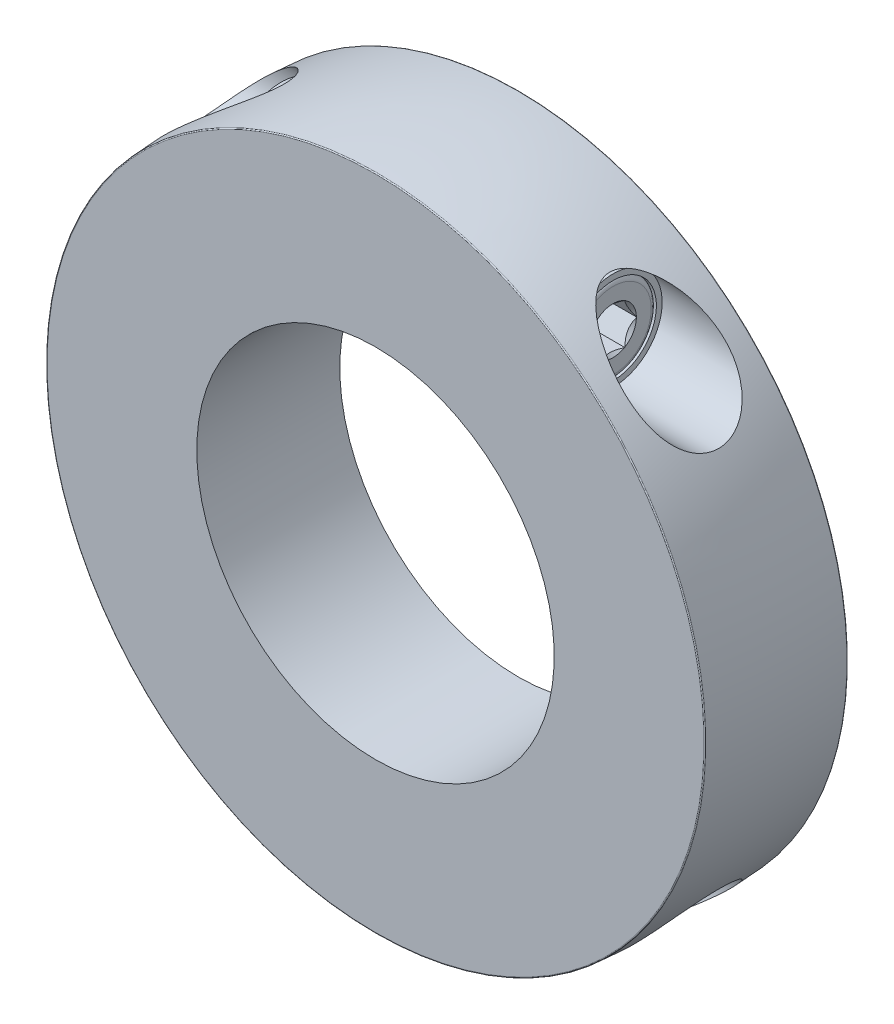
ISO-10303-21;
HEADER;
FILE_DESCRIPTION(('STEP AP214'),'2;1');
FILE_NAME('part.step','',(''),(''),'','','');
FILE_SCHEMA(('AUTOMOTIVE_DESIGN { 1 0 10303 214 1 1 1 1 }'));
ENDSEC;
DATA;
#1=APPLICATION_CONTEXT('core data for automotive mechanical design processes');
#2=APPLICATION_PROTOCOL_DEFINITION('international standard','automotive_design',2000,#1);
#3=PRODUCT_CONTEXT('',#1,'mechanical');
#4=PRODUCT('Part','Part','',(#3));
#5=PRODUCT_RELATED_PRODUCT_CATEGORY('part','',(#4));
#6=PRODUCT_DEFINITION_FORMATION('','',#4);
#7=PRODUCT_DEFINITION_CONTEXT('part definition',#1,'design');
#8=PRODUCT_DEFINITION('design','',#6,#7);
#9=PRODUCT_DEFINITION_SHAPE('','',#8);
#10=(LENGTH_UNIT() NAMED_UNIT(*) SI_UNIT(.MILLI.,.METRE.));
#11=(NAMED_UNIT(*) PLANE_ANGLE_UNIT() SI_UNIT($,.RADIAN.));
#12=(NAMED_UNIT(*) SI_UNIT($,.STERADIAN.) SOLID_ANGLE_UNIT());
#13=UNCERTAINTY_MEASURE_WITH_UNIT(LENGTH_MEASURE(1.E-05),#10,'distance_accuracy_value','');
#14=(GEOMETRIC_REPRESENTATION_CONTEXT(3) GLOBAL_UNCERTAINTY_ASSIGNED_CONTEXT((#13)) GLOBAL_UNIT_ASSIGNED_CONTEXT((#10,
#11,#12)) REPRESENTATION_CONTEXT('',''));
#15=CARTESIAN_POINT('',(0.,0.,0.));
#16=DIRECTION('',(0.,0.,1.));
#17=DIRECTION('',(1.,0.,0.));
#18=AXIS2_PLACEMENT_3D('',#15,#16,#17);
#19=CARTESIAN_POINT('',(11.9952994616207,-23.5,7.));
#20=DIRECTION('',(1.,0.,0.));
#21=DIRECTION('',(0.,1.,0.));
#22=AXIS2_PLACEMENT_3D('',#19,#20,#21);
#23=CONICAL_SURFACE('',#22,0.,1.0471975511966);
#24=CARTESIAN_POINT('',(13.15,-23.5,7.));
#25=DIRECTION('',(-1.,0.,0.));
#26=DIRECTION('',(0.,-1.,0.));
#27=AXIS2_PLACEMENT_3D('',#24,#25,#26);
#28=CIRCLE('',#27,2.);
#29=CARTESIAN_POINT('',(13.15,-25.5,7.));
#30=VERTEX_POINT('',#29);
#31=CARTESIAN_POINT('',(13.15,-24.5,8.73205080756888));
#32=VERTEX_POINT('',#31);
#33=EDGE_CURVE('E732',#30,#32,#28,.T.);
#34=ORIENTED_EDGE('',*,*,#33,.F.);
#35=CARTESIAN_POINT('',(13.15,-24.5,5.26794919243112));
#36=VERTEX_POINT('',#35);
#37=EDGE_CURVE('E730',#36,#30,#28,.T.);
#38=ORIENTED_EDGE('',*,*,#37,.F.);
#39=CARTESIAN_POINT('',(13.15,-22.5,5.26794919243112));
#40=VERTEX_POINT('',#39);
#41=EDGE_CURVE('E955',#40,#36,#28,.T.);
#42=ORIENTED_EDGE('',*,*,#41,.F.);
#43=CARTESIAN_POINT('',(13.15,-21.5,7.));
#44=VERTEX_POINT('',#43);
#45=EDGE_CURVE('E958',#44,#40,#28,.T.);
#46=ORIENTED_EDGE('',*,*,#45,.F.);
#47=CARTESIAN_POINT('',(13.15,-22.5,8.73205080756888));
#48=VERTEX_POINT('',#47);
#49=EDGE_CURVE('E933',#48,#44,#28,.T.);
#50=ORIENTED_EDGE('',*,*,#49,.F.);
#51=EDGE_CURVE('E735',#32,#48,#28,.T.);
#52=ORIENTED_EDGE('',*,*,#51,.F.);
#53=EDGE_LOOP('',(#34,#38,#42,#46,#50,#52));
#54=FACE_BOUND('',#53,.T.);
#55=CARTESIAN_POINT('',(11.9952994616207,-23.5,7.));
#56=VERTEX_POINT('',#55);
#57=VERTEX_LOOP('',#56);
#58=FACE_BOUND('',#57,.T.);
#59=ADVANCED_FACE('F14',(#54,#58),#23,.F.);
#60=CARTESIAN_POINT('',(13.15,-23.5,7.));
#61=DIRECTION('',(-1.,0.,0.));
#62=DIRECTION('',(0.,-1.,0.));
#63=AXIS2_PLACEMENT_3D('',#60,#61,#62);
#64=PLANE('',#63);
#65=DIRECTION('',(0.,0.866025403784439,0.5));
#66=VECTOR('',#65,1.);
#67=CARTESIAN_POINT('',(13.15,-25.5,8.15470053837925));
#68=LINE('',#67,#66);
#69=CARTESIAN_POINT('',(13.15,-25.5,8.15470053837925));
#70=VERTEX_POINT('',#69);
#71=EDGE_CURVE('E549',#70,#32,#68,.T.);
#72=ORIENTED_EDGE('',*,*,#71,.F.);
#73=DIRECTION('',(0.,0.,1.));
#74=VECTOR('',#73,1.);
#75=CARTESIAN_POINT('',(13.15,-25.5,5.84529946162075));
#76=LINE('',#75,#74);
#77=EDGE_CURVE('E545',#30,#70,#76,.T.);
#78=ORIENTED_EDGE('',*,*,#77,.F.);
#79=ORIENTED_EDGE('',*,*,#33,.T.);
#80=EDGE_LOOP('',(#72,#78,#79));
#81=FACE_BOUND('',#80,.T.);
#82=ADVANCED_FACE('F649',(#81),#64,.F.);
#83=CARTESIAN_POINT('',(13.15,-25.5,5.84529946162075));
#84=VERTEX_POINT('',#83);
#85=EDGE_CURVE('E546',#84,#30,#76,.T.);
#86=ORIENTED_EDGE('',*,*,#85,.F.);
#87=DIRECTION('',(0.,-0.866025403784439,0.5));
#88=VECTOR('',#87,1.);
#89=CARTESIAN_POINT('',(13.15,-23.5,4.69059892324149));
#90=LINE('',#89,#88);
#91=EDGE_CURVE('E541',#36,#84,#90,.T.);
#92=ORIENTED_EDGE('',*,*,#91,.F.);
#93=ORIENTED_EDGE('',*,*,#37,.T.);
#94=EDGE_LOOP('',(#86,#92,#93));
#95=FACE_BOUND('',#94,.T.);
#96=ADVANCED_FACE('F595',(#95),#64,.F.);
#97=CARTESIAN_POINT('',(13.15,-23.5,4.69059892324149));
#98=VERTEX_POINT('',#97);
#99=EDGE_CURVE('E542',#98,#36,#90,.T.);
#100=ORIENTED_EDGE('',*,*,#99,.F.);
#101=DIRECTION('',(0.,-0.866025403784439,-0.5));
#102=VECTOR('',#101,1.);
#103=CARTESIAN_POINT('',(13.15,-21.5,5.84529946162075));
#104=LINE('',#103,#102);
#105=EDGE_CURVE('E537',#40,#98,#104,.T.);
#106=ORIENTED_EDGE('',*,*,#105,.F.);
#107=ORIENTED_EDGE('',*,*,#41,.T.);
#108=EDGE_LOOP('',(#100,#106,#107));
#109=FACE_BOUND('',#108,.T.);
#110=ADVANCED_FACE('F964',(#109),#64,.F.);
#111=CARTESIAN_POINT('',(13.15,-21.5,5.84529946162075));
#112=VERTEX_POINT('',#111);
#113=EDGE_CURVE('E538',#112,#40,#104,.T.);
#114=ORIENTED_EDGE('',*,*,#113,.F.);
#115=DIRECTION('',(0.,0.,-1.));
#116=VECTOR('',#115,1.);
#117=CARTESIAN_POINT('',(13.15,-21.5,8.15470053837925));
#118=LINE('',#117,#116);
#119=EDGE_CURVE('E532',#44,#112,#118,.T.);
#120=ORIENTED_EDGE('',*,*,#119,.F.);
#121=ORIENTED_EDGE('',*,*,#45,.T.);
#122=EDGE_LOOP('',(#114,#120,#121));
#123=FACE_BOUND('',#122,.T.);
#124=ADVANCED_FACE('F687',(#123),#64,.F.);
#125=DIRECTION('',(0.,0.866025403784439,-0.5));
#126=VECTOR('',#125,1.);
#127=CARTESIAN_POINT('',(13.15,-23.5,9.30940107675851));
#128=LINE('',#127,#126);
#129=CARTESIAN_POINT('',(13.15,-23.5,9.30940107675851));
#130=VERTEX_POINT('',#129);
#131=EDGE_CURVE('E529',#130,#48,#128,.T.);
#132=ORIENTED_EDGE('',*,*,#131,.F.);
#133=EDGE_CURVE('E548',#32,#130,#68,.T.);
#134=ORIENTED_EDGE('',*,*,#133,.F.);
#135=ORIENTED_EDGE('',*,*,#51,.T.);
#136=EDGE_LOOP('',(#132,#134,#135));
#137=FACE_BOUND('',#136,.T.);
#138=ADVANCED_FACE('F685',(#137),#64,.F.);
#139=CARTESIAN_POINT('',(13.15,-21.5,8.15470053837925));
#140=VERTEX_POINT('',#139);
#141=EDGE_CURVE('E534',#140,#44,#118,.T.);
#142=ORIENTED_EDGE('',*,*,#141,.F.);
#143=EDGE_CURVE('E533',#48,#140,#128,.T.);
#144=ORIENTED_EDGE('',*,*,#143,.F.);
#145=ORIENTED_EDGE('',*,*,#49,.T.);
#146=EDGE_LOOP('',(#142,#144,#145));
#147=FACE_BOUND('',#146,.T.);
#148=ADVANCED_FACE('F679',(#147),#64,.F.);
#149=CARTESIAN_POINT('',(15.96,-23.5,7.));
#150=DIRECTION('',(1.,0.,0.));
#151=DIRECTION('',(0.,1.,0.));
#152=AXIS2_PLACEMENT_3D('',#149,#150,#151);
#153=CONICAL_SURFACE('',#152,2.,0.785398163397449);
#154=CARTESIAN_POINT('',(16.25,-23.5,7.));
#155=DIRECTION('',(-1.,0.,0.));
#156=DIRECTION('',(0.,-1.,0.));
#157=AXIS2_PLACEMENT_3D('',#154,#155,#156);
#158=CIRCLE('',#157,2.29);
#159=CARTESIAN_POINT('',(16.25,-25.4659580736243,8.17435465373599));
#160=VERTEX_POINT('',#159);
#161=CARTESIAN_POINT('',(16.25,-23.5340419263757,9.28974696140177));
#162=VERTEX_POINT('',#161);
#163=EDGE_CURVE('E723',#160,#162,#158,.T.);
#164=ORIENTED_EDGE('',*,*,#163,.F.);
#165=CARTESIAN_POINT('',(16.2502,-25.4663136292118,8.17414937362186));
#166=CARTESIAN_POINT('',(16.2126645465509,-25.3995425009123,8.21269970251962));
#167=CARTESIAN_POINT('',(16.1774236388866,-25.3316751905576,8.2518829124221));
#168=CARTESIAN_POINT('',(16.1130614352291,-25.193400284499,8.33171596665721));
#169=CARTESIAN_POINT('',(16.0839734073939,-25.1229811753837,8.37237245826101));
#170=CARTESIAN_POINT('',(16.034247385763,-24.9810092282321,8.45434000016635));
#171=CARTESIAN_POINT('',(16.0134916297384,-24.9094882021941,8.49563268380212));
#172=CARTESIAN_POINT('',(15.9816184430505,-24.7649683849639,8.57907123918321));
#173=CARTESIAN_POINT('',(15.9704791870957,-24.6919733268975,8.6212149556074));
#174=CARTESIAN_POINT('',(15.9604111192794,-24.5645191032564,8.69480068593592));
#175=CARTESIAN_POINT('',(15.9590528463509,-24.510198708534,8.72616258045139));
#176=CARTESIAN_POINT('',(15.9622415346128,-24.4016676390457,8.7888230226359));
#177=CARTESIAN_POINT('',(15.9667904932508,-24.3474570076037,8.82012154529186));
#178=CARTESIAN_POINT('',(15.9815317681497,-24.2395839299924,8.88240209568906));
#179=CARTESIAN_POINT('',(15.991728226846,-24.1859219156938,8.91338387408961));
#180=CARTESIAN_POINT('',(16.0172151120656,-24.0795079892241,8.97482198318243));
#181=CARTESIAN_POINT('',(16.0325076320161,-24.0267564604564,9.00527809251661));
#182=CARTESIAN_POINT('',(16.0754945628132,-23.8985138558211,9.07931899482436));
#183=CARTESIAN_POINT('',(16.105663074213,-23.8236436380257,9.12254533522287));
#184=CARTESIAN_POINT('',(16.1562501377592,-23.7133798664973,9.18620615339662));
#185=CARTESIAN_POINT('',(16.1739707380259,-23.6770189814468,9.20719912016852));
#186=CARTESIAN_POINT('',(16.210970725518,-23.6049074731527,9.24883271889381));
#187=CARTESIAN_POINT('',(16.230249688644,-23.5691566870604,9.2694734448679));
#188=CARTESIAN_POINT('',(16.2502,-23.5336863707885,9.28995224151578));
#189=B_SPLINE_CURVE_WITH_KNOTS('',3,(#165,#166,#167,#168,#169,#170,#171,#172,#173,#174,#175,
#176,#177,#178,#179,#180,#181,#182,#183,#184,#185,#186,#187,#188),.UNSPECIFIED.,.F.,.F.,(4,2,2,
2,2,2,2,2,2,2,2,4),(0.,0.257421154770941,0.51620046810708,0.771181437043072,1.02558217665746,
1.21353050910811,1.40154241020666,1.58969240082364,1.77791977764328,2.05213548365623,
2.18883056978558,2.32548857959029),.UNSPECIFIED.);
#190=EDGE_CURVE('E569',#160,#162,#189,.T.);
#191=ORIENTED_EDGE('',*,*,#190,.T.);
#192=EDGE_LOOP('',(#164,#191));
#193=FACE_BOUND('',#192,.T.);
#194=ADVANCED_FACE('F585',(#193),#153,.F.);
#195=CARTESIAN_POINT('',(18.15,-25.5,8.15470053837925));
#196=DIRECTION('',(0.,-0.5,0.866025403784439));
#197=DIRECTION('',(0.,0.866025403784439,0.5));
#198=AXIS2_PLACEMENT_3D('',#195,#196,#197);
#199=PLANE('',#198);
#200=ORIENTED_EDGE('',*,*,#133,.T.);
#201=DIRECTION('',(-1.,0.,0.));
#202=VECTOR('',#201,1.);
#203=CARTESIAN_POINT('',(18.15,-23.5,9.30940107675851));
#204=LINE('',#203,#202);
#205=CARTESIAN_POINT('',(16.25,-23.5,9.30940107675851));
#206=VERTEX_POINT('',#205);
#207=EDGE_CURVE('E552',#206,#130,#204,.T.);
#208=ORIENTED_EDGE('',*,*,#207,.F.);
#209=DIRECTION('',(0.,0.866025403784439,0.5));
#210=VECTOR('',#209,1.);
#211=CARTESIAN_POINT('',(16.25,-26.2175,7.7404517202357));
#212=LINE('',#211,#210);
#213=EDGE_CURVE('E734',#162,#206,#212,.T.);
#214=ORIENTED_EDGE('',*,*,#213,.F.);
#215=ORIENTED_EDGE('',*,*,#190,.F.);
#216=CARTESIAN_POINT('',(16.25,-25.5,8.15470053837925));
#217=VERTEX_POINT('',#216);
#218=EDGE_CURVE('E739',#217,#160,#212,.T.);
#219=ORIENTED_EDGE('',*,*,#218,.F.);
#220=DIRECTION('',(-1.,0.,0.));
#221=VECTOR('',#220,1.);
#222=CARTESIAN_POINT('',(18.15,-25.5,8.15470053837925));
#223=LINE('',#222,#221);
#224=EDGE_CURVE('E554',#217,#70,#223,.T.);
#225=ORIENTED_EDGE('',*,*,#224,.T.);
#226=ORIENTED_EDGE('',*,*,#71,.T.);
#227=EDGE_LOOP('',(#200,#208,#214,#215,#219,#225,#226));
#228=FACE_BOUND('',#227,.T.);
#229=ADVANCED_FACE('F589',(#228),#199,.F.);
#230=CARTESIAN_POINT('',(16.25,-25.5,5.88460769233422));
#231=VERTEX_POINT('',#230);
#232=CARTESIAN_POINT('',(16.25,-25.5,8.11539230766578));
#233=VERTEX_POINT('',#232);
#234=EDGE_CURVE('E726',#231,#233,#158,.T.);
#235=ORIENTED_EDGE('',*,*,#234,.F.);
#236=CARTESIAN_POINT('',(17.0855906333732,-25.5,4.59805978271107));
#237=CARTESIAN_POINT('',(17.0409829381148,-25.5,4.65611982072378));
#238=CARTESIAN_POINT('',(16.9967771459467,-25.5,4.71449358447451));
#239=CARTESIAN_POINT('',(16.9093527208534,-25.5,4.83199647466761));
#240=CARTESIAN_POINT('',(16.8661343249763,-25.5,4.89112577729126));
#241=CARTESIAN_POINT('',(16.7805604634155,-25.5,5.01069984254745));
#242=CARTESIAN_POINT('',(16.7382142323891,-25.5,5.07115123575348));
#243=CARTESIAN_POINT('',(16.6550028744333,-25.5,5.19306163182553));
#244=CARTESIAN_POINT('',(16.6141376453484,-25.5,5.25452056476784));
#245=CARTESIAN_POINT('',(16.5317036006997,-25.5,5.38253044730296));
#246=CARTESIAN_POINT('',(16.4902531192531,-25.5,5.44915798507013));
#247=CARTESIAN_POINT('',(16.4099481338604,-25.5,5.58395736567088));
#248=CARTESIAN_POINT('',(16.371093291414,-25.5,5.65212900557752));
#249=CARTESIAN_POINT('',(16.2967886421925,-25.5,5.79006277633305));
#250=CARTESIAN_POINT('',(16.261329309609,-25.5,5.85981973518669));
#251=CARTESIAN_POINT('',(16.194616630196,-25.5,6.00130075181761));
#252=CARTESIAN_POINT('',(16.1633613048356,-25.5,6.07302386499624));
#253=CARTESIAN_POINT('',(16.1089733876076,-25.5,6.21149938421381));
#254=CARTESIAN_POINT('',(16.0853461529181,-25.5,6.27805551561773));
#255=CARTESIAN_POINT('',(16.0434197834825,-25.5,6.41285674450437));
#256=CARTESIAN_POINT('',(16.025120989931,-25.5,6.48110194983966));
#257=CARTESIAN_POINT('',(15.9951443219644,-25.5,6.61768915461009));
#258=CARTESIAN_POINT('',(15.9833466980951,-25.5,6.68600442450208));
#259=CARTESIAN_POINT('',(15.9666173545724,-25.5,6.82347516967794));
#260=CARTESIAN_POINT('',(15.9616842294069,-25.5,6.89263047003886));
#261=CARTESIAN_POINT('',(15.9591001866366,-25.5,7.02809343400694));
#262=CARTESIAN_POINT('',(15.9611445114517,-25.5,7.09439534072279));
#263=CARTESIAN_POINT('',(15.971704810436,-25.5,7.22647796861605));
#264=CARTESIAN_POINT('',(15.9802213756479,-25.5,7.29225864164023));
#265=CARTESIAN_POINT('',(16.0033899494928,-25.5,7.42393863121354));
#266=CARTESIAN_POINT('',(16.0181499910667,-25.5,7.48981863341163));
#267=CARTESIAN_POINT('',(16.0529914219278,-25.5,7.62012507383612));
#268=CARTESIAN_POINT('',(16.0730724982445,-25.5,7.68455159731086));
#269=CARTESIAN_POINT('',(16.1426325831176,-25.5,7.88311518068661));
#270=CARTESIAN_POINT('',(16.1998517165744,-25.5,8.01453124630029));
#271=CARTESIAN_POINT('',(16.3271777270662,-25.5,8.27123355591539));
#272=CARTESIAN_POINT('',(16.3973300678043,-25.5,8.39649613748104));
#273=CARTESIAN_POINT('',(16.5068811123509,-25.5,8.57756965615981));
#274=CARTESIAN_POINT('',(16.5431054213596,-25.5,8.63533989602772));
#275=CARTESIAN_POINT('',(16.6171016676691,-25.5,8.74988835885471));
#276=CARTESIAN_POINT('',(16.6548737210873,-25.5,8.80666650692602));
#277=CARTESIAN_POINT('',(16.7313745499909,-25.5,8.91890328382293));
#278=CARTESIAN_POINT('',(16.7700931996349,-25.5,8.97436884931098));
#279=CARTESIAN_POINT('',(16.8485675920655,-25.5,9.08453923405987));
#280=CARTESIAN_POINT('',(16.8883230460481,-25.5,9.13924425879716));
#281=CARTESIAN_POINT('',(16.928503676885,-25.5,9.19363034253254));
#282=B_SPLINE_CURVE_WITH_KNOTS('',3,(#236,#237,#238,#239,#240,#241,#242,#243,#244,#245,#246,
#247,#248,#249,#250,#251,#252,#253,#254,#255,#256,#257,#258,#259,#260,#261,#262,#263,#264,#265,
#266,#267,#268,#269,#270,#271,#272,#273,#274,#275,#276,#277,#278,#279,#280,#281),.UNSPECIFIED.,
.F.,.F.,(4,2,2,2,2,2,2,2,2,2,2,2,2,2,2,2,2,2,2,2,2,2,4),(0.,0.219656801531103,0.439365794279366,
0.660770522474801,0.882159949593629,1.1175200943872,1.35284948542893,1.58749805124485,
1.82203579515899,2.03372952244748,2.24543680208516,2.45310170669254,2.66072408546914,
2.85939617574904,3.05808641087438,3.26036514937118,3.46263199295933,3.89138391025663,
4.3216727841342,4.5262173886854,4.73077736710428,4.93369371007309,5.13655412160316),.UNSPECIFIED.);
#283=EDGE_CURVE('E578',#231,#233,#282,.T.);
#284=ORIENTED_EDGE('',*,*,#283,.T.);
#285=EDGE_LOOP('',(#235,#284));
#286=FACE_BOUND('',#285,.T.);
#287=ADVANCED_FACE('F592',(#286),#153,.F.);
#288=CARTESIAN_POINT('',(18.15,-25.5,5.84529946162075));
#289=DIRECTION('',(0.,-1.,0.));
#290=DIRECTION('',(1.,0.,0.));
#291=AXIS2_PLACEMENT_3D('',#288,#289,#290);
#292=PLANE('',#291);
#293=ORIENTED_EDGE('',*,*,#77,.T.);
#294=ORIENTED_EDGE('',*,*,#224,.F.);
#295=DIRECTION('',(0.,0.,1.));
#296=VECTOR('',#295,1.);
#297=CARTESIAN_POINT('',(16.25,-25.5,7.));
#298=LINE('',#297,#296);
#299=EDGE_CURVE('E742',#233,#217,#298,.T.);
#300=ORIENTED_EDGE('',*,*,#299,.F.);
#301=ORIENTED_EDGE('',*,*,#283,.F.);
#302=CARTESIAN_POINT('',(16.25,-25.5,5.84529946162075));
#303=VERTEX_POINT('',#302);
#304=EDGE_CURVE('E745',#303,#231,#298,.T.);
#305=ORIENTED_EDGE('',*,*,#304,.F.);
#306=DIRECTION('',(-1.,0.,0.));
#307=VECTOR('',#306,1.);
#308=CARTESIAN_POINT('',(18.15,-25.5,5.84529946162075));
#309=LINE('',#308,#307);
#310=EDGE_CURVE('E557',#303,#84,#309,.T.);
#311=ORIENTED_EDGE('',*,*,#310,.T.);
#312=ORIENTED_EDGE('',*,*,#85,.T.);
#313=EDGE_LOOP('',(#293,#294,#300,#301,#305,#311,#312));
#314=FACE_BOUND('',#313,.T.);
#315=ADVANCED_FACE('F594',(#314),#292,.F.);
#316=CARTESIAN_POINT('',(16.25,-23.5340419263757,4.71025303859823));
#317=VERTEX_POINT('',#316);
#318=CARTESIAN_POINT('',(16.25,-25.4659580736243,5.82564534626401));
#319=VERTEX_POINT('',#318);
#320=EDGE_CURVE('E725',#317,#319,#158,.T.);
#321=ORIENTED_EDGE('',*,*,#320,.F.);
#322=CARTESIAN_POINT('',(16.2502,-23.5336863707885,4.71004775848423));
#323=CARTESIAN_POINT('',(16.2126645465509,-23.6004574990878,4.74859808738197));
#324=CARTESIAN_POINT('',(16.1774236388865,-23.6683248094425,4.78778129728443));
#325=CARTESIAN_POINT('',(16.113061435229,-23.8065997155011,4.86761435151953));
#326=CARTESIAN_POINT('',(16.0839734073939,-23.8770188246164,4.90827084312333));
#327=CARTESIAN_POINT('',(16.034247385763,-24.018990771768,4.99023838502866));
#328=CARTESIAN_POINT('',(16.0134916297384,-24.090511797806,5.03153106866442));
#329=CARTESIAN_POINT('',(15.9816184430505,-24.2350316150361,5.11496962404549));
#330=CARTESIAN_POINT('',(15.9704791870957,-24.3080266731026,5.15711334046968));
#331=CARTESIAN_POINT('',(15.9604111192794,-24.4354808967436,5.23069907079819));
#332=CARTESIAN_POINT('',(15.9590528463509,-24.4898012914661,5.26206096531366));
#333=CARTESIAN_POINT('',(15.9622415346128,-24.5983323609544,5.32472140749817));
#334=CARTESIAN_POINT('',(15.9667904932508,-24.6525429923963,5.35601993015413));
#335=CARTESIAN_POINT('',(15.9815317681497,-24.7604160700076,5.41830048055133));
#336=CARTESIAN_POINT('',(15.991728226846,-24.8140780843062,5.44928225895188));
#337=CARTESIAN_POINT('',(16.0172151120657,-24.920492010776,5.5107203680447));
#338=CARTESIAN_POINT('',(16.0325076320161,-24.9732435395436,5.54117647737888));
#339=CARTESIAN_POINT('',(16.0754945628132,-25.1014861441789,5.61521737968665));
#340=CARTESIAN_POINT('',(16.105663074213,-25.1763563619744,5.65844372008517));
#341=CARTESIAN_POINT('',(16.1562501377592,-25.2866201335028,5.72210453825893));
#342=CARTESIAN_POINT('',(16.173970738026,-25.3229810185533,5.74309750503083));
#343=CARTESIAN_POINT('',(16.2109707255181,-25.3950925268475,5.78473110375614));
#344=CARTESIAN_POINT('',(16.2302496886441,-25.4308433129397,5.80537182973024));
#345=CARTESIAN_POINT('',(16.2502,-25.4663136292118,5.82585062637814));
#346=B_SPLINE_CURVE_WITH_KNOTS('',3,(#322,#323,#324,#325,#326,#327,#328,#329,#330,#331,#332,
#333,#334,#335,#336,#337,#338,#339,#340,#341,#342,#343,#344,#345),.UNSPECIFIED.,.F.,.F.,(4,2,2,
2,2,2,2,2,2,2,2,4),(0.,0.257421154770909,0.516200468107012,0.771181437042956,1.0255821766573,
1.21353050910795,1.4015424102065,1.58969240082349,1.77791977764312,2.05213548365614,
2.18883056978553,2.32548857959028),.UNSPECIFIED.);
#347=EDGE_CURVE('E610',#317,#319,#346,.T.);
#348=ORIENTED_EDGE('',*,*,#347,.T.);
#349=EDGE_LOOP('',(#321,#348));
#350=FACE_BOUND('',#349,.T.);
#351=ADVANCED_FACE('F599',(#350),#153,.F.);
#352=CARTESIAN_POINT('',(18.15,-23.5,4.69059892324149));
#353=DIRECTION('',(0.,-0.5,-0.866025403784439));
#354=DIRECTION('',(0.,-0.866025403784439,0.5));
#355=AXIS2_PLACEMENT_3D('',#352,#353,#354);
#356=PLANE('',#355);
#357=ORIENTED_EDGE('',*,*,#91,.T.);
#358=ORIENTED_EDGE('',*,*,#310,.F.);
#359=DIRECTION('',(0.,-0.866025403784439,0.5));
#360=VECTOR('',#359,1.);
#361=CARTESIAN_POINT('',(16.25,-26.2175,6.2595482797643));
#362=LINE('',#361,#360);
#363=EDGE_CURVE('E746',#319,#303,#362,.T.);
#364=ORIENTED_EDGE('',*,*,#363,.F.);
#365=ORIENTED_EDGE('',*,*,#347,.F.);
#366=CARTESIAN_POINT('',(16.25,-23.5,4.69059892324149));
#367=VERTEX_POINT('',#366);
#368=EDGE_CURVE('E749',#367,#317,#362,.T.);
#369=ORIENTED_EDGE('',*,*,#368,.F.);
#370=DIRECTION('',(-1.,0.,0.));
#371=VECTOR('',#370,1.);
#372=CARTESIAN_POINT('',(18.15,-23.5,4.69059892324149));
#373=LINE('',#372,#371);
#374=EDGE_CURVE('E560',#367,#98,#373,.T.);
#375=ORIENTED_EDGE('',*,*,#374,.T.);
#376=ORIENTED_EDGE('',*,*,#99,.T.);
#377=EDGE_LOOP('',(#357,#358,#364,#365,#369,#375,#376));
#378=FACE_BOUND('',#377,.T.);
#379=ADVANCED_FACE('F601',(#378),#356,.F.);
#380=CARTESIAN_POINT('',(16.25,-21.5340419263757,5.82564534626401));
#381=VERTEX_POINT('',#380);
#382=CARTESIAN_POINT('',(16.25,-23.4659580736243,4.71025303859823));
#383=VERTEX_POINT('',#382);
#384=EDGE_CURVE('E720',#381,#383,#158,.T.);
#385=ORIENTED_EDGE('',*,*,#384,.F.);
#386=CARTESIAN_POINT('',(16.2502,-21.5336863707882,5.82585062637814));
#387=CARTESIAN_POINT('',(16.2126645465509,-21.6004574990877,5.78730029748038));
#388=CARTESIAN_POINT('',(16.1774236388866,-21.6683248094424,5.7481170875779));
#389=CARTESIAN_POINT('',(16.1130614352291,-21.806599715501,5.66828403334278));
#390=CARTESIAN_POINT('',(16.0839734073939,-21.8770188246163,5.62762754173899));
#391=CARTESIAN_POINT('',(16.034247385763,-22.0189907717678,5.54565999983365));
#392=CARTESIAN_POINT('',(16.0134916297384,-22.0905117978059,5.50436731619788));
#393=CARTESIAN_POINT('',(15.9816184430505,-22.2350316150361,5.4209287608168));
#394=CARTESIAN_POINT('',(15.9704791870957,-22.3080266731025,5.37878504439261));
#395=CARTESIAN_POINT('',(15.9604111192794,-22.4354808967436,5.30519931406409));
#396=CARTESIAN_POINT('',(15.9590528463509,-22.489801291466,5.27383741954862));
#397=CARTESIAN_POINT('',(15.9622415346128,-22.5983323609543,5.2111769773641));
#398=CARTESIAN_POINT('',(15.9667904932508,-22.6525429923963,5.17987845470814));
#399=CARTESIAN_POINT('',(15.9815317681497,-22.7604160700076,5.11759790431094));
#400=CARTESIAN_POINT('',(15.991728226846,-22.8140780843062,5.08661612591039));
#401=CARTESIAN_POINT('',(16.0172151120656,-22.9204920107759,5.02517801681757));
#402=CARTESIAN_POINT('',(16.0325076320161,-22.9732435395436,4.99472190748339));
#403=CARTESIAN_POINT('',(16.0754945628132,-23.1014861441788,4.92068100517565));
#404=CARTESIAN_POINT('',(16.105663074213,-23.1763563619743,4.87745466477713));
#405=CARTESIAN_POINT('',(16.1562501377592,-23.2866201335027,4.81379384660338));
#406=CARTESIAN_POINT('',(16.1739707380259,-23.3229810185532,4.79280087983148));
#407=CARTESIAN_POINT('',(16.210970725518,-23.3950925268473,4.75116728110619));
#408=CARTESIAN_POINT('',(16.230249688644,-23.4308433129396,4.7305265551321));
#409=CARTESIAN_POINT('',(16.2502,-23.4663136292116,4.71004775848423));
#410=B_SPLINE_CURVE_WITH_KNOTS('',3,(#386,#387,#388,#389,#390,#391,#392,#393,#394,#395,#396,
#397,#398,#399,#400,#401,#402,#403,#404,#405,#406,#407,#408,#409),.UNSPECIFIED.,.F.,.F.,(4,2,2,
2,2,2,2,2,2,2,2,4),(0.,0.257421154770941,0.516200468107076,0.771181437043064,1.02558217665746,
1.21353050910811,1.40154241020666,1.58969240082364,1.77791977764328,2.05213548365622,
2.18883056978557,2.32548857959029),.UNSPECIFIED.);
#411=EDGE_CURVE('E617',#381,#383,#410,.T.);
#412=ORIENTED_EDGE('',*,*,#411,.T.);
#413=EDGE_LOOP('',(#385,#412));
#414=FACE_BOUND('',#413,.T.);
#415=ADVANCED_FACE('F605',(#414),#153,.F.);
#416=CARTESIAN_POINT('',(18.15,-21.5,5.84529946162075));
#417=DIRECTION('',(0.,0.5,-0.866025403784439));
#418=DIRECTION('',(0.,-0.866025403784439,-0.5));
#419=AXIS2_PLACEMENT_3D('',#416,#417,#418);
#420=PLANE('',#419);
#421=ORIENTED_EDGE('',*,*,#105,.T.);
#422=ORIENTED_EDGE('',*,*,#374,.F.);
#423=DIRECTION('',(0.,-0.866025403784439,-0.5));
#424=VECTOR('',#423,1.);
#425=CARTESIAN_POINT('',(16.25,-24.2175,4.27635010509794));
#426=LINE('',#425,#424);
#427=EDGE_CURVE('E750',#383,#367,#426,.T.);
#428=ORIENTED_EDGE('',*,*,#427,.F.);
#429=ORIENTED_EDGE('',*,*,#411,.F.);
#430=CARTESIAN_POINT('',(16.25,-21.5,5.84529946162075));
#431=VERTEX_POINT('',#430);
#432=EDGE_CURVE('E753',#431,#381,#426,.T.);
#433=ORIENTED_EDGE('',*,*,#432,.F.);
#434=DIRECTION('',(-1.,0.,0.));
#435=VECTOR('',#434,1.);
#436=CARTESIAN_POINT('',(18.15,-21.5,5.84529946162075));
#437=LINE('',#436,#435);
#438=EDGE_CURVE('E563',#431,#112,#437,.T.);
#439=ORIENTED_EDGE('',*,*,#438,.T.);
#440=ORIENTED_EDGE('',*,*,#113,.T.);
#441=EDGE_LOOP('',(#421,#422,#428,#429,#433,#439,#440));
#442=FACE_BOUND('',#441,.T.);
#443=ADVANCED_FACE('F607',(#442),#420,.F.);
#444=CARTESIAN_POINT('',(16.25,-21.5,8.11539230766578));
#445=VERTEX_POINT('',#444);
#446=CARTESIAN_POINT('',(16.25,-21.5,5.88460769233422));
#447=VERTEX_POINT('',#446);
#448=EDGE_CURVE('E716',#445,#447,#158,.T.);
#449=ORIENTED_EDGE('',*,*,#448,.F.);
#450=CARTESIAN_POINT('',(17.0855906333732,-21.5,4.59805978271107));
#451=CARTESIAN_POINT('',(17.0409829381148,-21.5,4.65611982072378));
#452=CARTESIAN_POINT('',(16.9967771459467,-21.5,4.71449358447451));
#453=CARTESIAN_POINT('',(16.9093527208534,-21.5,4.83199647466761));
#454=CARTESIAN_POINT('',(16.8661343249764,-21.5,4.89112577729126));
#455=CARTESIAN_POINT('',(16.7805604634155,-21.5,5.01069984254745));
#456=CARTESIAN_POINT('',(16.7382142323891,-21.5,5.07115123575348));
#457=CARTESIAN_POINT('',(16.6550028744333,-21.5,5.19306163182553));
#458=CARTESIAN_POINT('',(16.6141376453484,-21.5,5.25452056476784));
#459=CARTESIAN_POINT('',(16.5317036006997,-21.5,5.38253044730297));
#460=CARTESIAN_POINT('',(16.4902531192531,-21.5,5.44915798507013));
#461=CARTESIAN_POINT('',(16.4099481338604,-21.5,5.58395736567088));
#462=CARTESIAN_POINT('',(16.371093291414,-21.5,5.65212900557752));
#463=CARTESIAN_POINT('',(16.2967886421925,-21.5,5.79006277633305));
#464=CARTESIAN_POINT('',(16.261329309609,-21.5,5.85981973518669));
#465=CARTESIAN_POINT('',(16.194616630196,-21.5,6.00130075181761));
#466=CARTESIAN_POINT('',(16.1633613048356,-21.5,6.07302386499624));
#467=CARTESIAN_POINT('',(16.1089733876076,-21.5,6.21149938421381));
#468=CARTESIAN_POINT('',(16.0853461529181,-21.5,6.27805551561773));
#469=CARTESIAN_POINT('',(16.0434197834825,-21.5,6.41285674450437));
#470=CARTESIAN_POINT('',(16.025120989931,-21.5,6.48110194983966));
#471=CARTESIAN_POINT('',(15.9951443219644,-21.5,6.61768915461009));
#472=CARTESIAN_POINT('',(15.9833466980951,-21.5,6.68600442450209));
#473=CARTESIAN_POINT('',(15.9666173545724,-21.5,6.82347516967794));
#474=CARTESIAN_POINT('',(15.9616842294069,-21.5,6.89263047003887));
#475=CARTESIAN_POINT('',(15.9591001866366,-21.5,7.02809343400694));
#476=CARTESIAN_POINT('',(15.9611445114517,-21.5,7.09439534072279));
#477=CARTESIAN_POINT('',(15.971704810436,-21.5,7.22647796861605));
#478=CARTESIAN_POINT('',(15.9802213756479,-21.5,7.29225864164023));
#479=CARTESIAN_POINT('',(16.0033899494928,-21.5,7.42393863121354));
#480=CARTESIAN_POINT('',(16.0181499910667,-21.5,7.48981863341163));
#481=CARTESIAN_POINT('',(16.0529914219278,-21.5,7.62012507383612));
#482=CARTESIAN_POINT('',(16.0730724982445,-21.5,7.68455159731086));
#483=CARTESIAN_POINT('',(16.1426325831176,-21.5,7.88311518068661));
#484=CARTESIAN_POINT('',(16.1998517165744,-21.5,8.01453124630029));
#485=CARTESIAN_POINT('',(16.3271777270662,-21.5,8.27123355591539));
#486=CARTESIAN_POINT('',(16.3973300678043,-21.5,8.39649613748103));
#487=CARTESIAN_POINT('',(16.5068811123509,-21.5,8.57756965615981));
#488=CARTESIAN_POINT('',(16.5431054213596,-21.5,8.63533989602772));
#489=CARTESIAN_POINT('',(16.6171016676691,-21.5,8.74988835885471));
#490=CARTESIAN_POINT('',(16.6548737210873,-21.5,8.80666650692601));
#491=CARTESIAN_POINT('',(16.7313745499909,-21.5,8.91890328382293));
#492=CARTESIAN_POINT('',(16.7700931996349,-21.5,8.97436884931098));
#493=CARTESIAN_POINT('',(16.8485675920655,-21.5,9.08453923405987));
#494=CARTESIAN_POINT('',(16.8883230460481,-21.5,9.13924425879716));
#495=CARTESIAN_POINT('',(16.928503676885,-21.5,9.19363034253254));
#496=B_SPLINE_CURVE_WITH_KNOTS('',3,(#450,#451,#452,#453,#454,#455,#456,#457,#458,#459,#460,
#461,#462,#463,#464,#465,#466,#467,#468,#469,#470,#471,#472,#473,#474,#475,#476,#477,#478,#479,
#480,#481,#482,#483,#484,#485,#486,#487,#488,#489,#490,#491,#492,#493,#494,#495),.UNSPECIFIED.,
.F.,.F.,(4,2,2,2,2,2,2,2,2,2,2,2,2,2,2,2,2,2,2,2,2,2,4),(0.,0.219656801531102,0.439365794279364,
0.660770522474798,0.882159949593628,1.1175200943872,1.35284948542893,1.58749805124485,
1.82203579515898,2.03372952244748,2.24543680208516,2.45310170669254,2.66072408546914,
2.85939617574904,3.05808641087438,3.26036514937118,3.46263199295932,3.89138391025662,
4.3216727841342,4.5262173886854,4.73077736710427,4.93369371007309,5.13655412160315),.UNSPECIFIED.);
#497=EDGE_CURVE('E624',#445,#447,#496,.F.);
#498=ORIENTED_EDGE('',*,*,#497,.T.);
#499=EDGE_LOOP('',(#449,#498));
#500=FACE_BOUND('',#499,.T.);
#501=ADVANCED_FACE('F642',(#500),#153,.F.);
#502=CARTESIAN_POINT('',(18.15,-21.5,8.15470053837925));
#503=DIRECTION('',(0.,1.,0.));
#504=DIRECTION('',(-1.,0.,0.));
#505=AXIS2_PLACEMENT_3D('',#502,#503,#504);
#506=PLANE('',#505);
#507=ORIENTED_EDGE('',*,*,#119,.T.);
#508=ORIENTED_EDGE('',*,*,#438,.F.);
#509=DIRECTION('',(0.,0.,-1.));
#510=VECTOR('',#509,1.);
#511=CARTESIAN_POINT('',(16.25,-21.5,7.));
#512=LINE('',#511,#510);
#513=EDGE_CURVE('E754',#447,#431,#512,.T.);
#514=ORIENTED_EDGE('',*,*,#513,.F.);
#515=ORIENTED_EDGE('',*,*,#497,.F.);
#516=CARTESIAN_POINT('',(16.25,-21.5,8.15470053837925));
#517=VERTEX_POINT('',#516);
#518=EDGE_CURVE('E756',#517,#445,#512,.T.);
#519=ORIENTED_EDGE('',*,*,#518,.F.);
#520=DIRECTION('',(-1.,0.,0.));
#521=VECTOR('',#520,1.);
#522=CARTESIAN_POINT('',(18.15,-21.5,8.15470053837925));
#523=LINE('',#522,#521);
#524=EDGE_CURVE('E566',#517,#140,#523,.T.);
#525=ORIENTED_EDGE('',*,*,#524,.T.);
#526=ORIENTED_EDGE('',*,*,#141,.T.);
#527=EDGE_LOOP('',(#507,#508,#514,#515,#519,#525,#526));
#528=FACE_BOUND('',#527,.T.);
#529=ADVANCED_FACE('F638',(#528),#506,.F.);
#530=CARTESIAN_POINT('',(18.15,-23.5,9.30940107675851));
#531=DIRECTION('',(0.,0.5,0.866025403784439));
#532=DIRECTION('',(0.,0.866025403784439,-0.5));
#533=AXIS2_PLACEMENT_3D('',#530,#531,#532);
#534=PLANE('',#533);
#535=ORIENTED_EDGE('',*,*,#143,.T.);
#536=ORIENTED_EDGE('',*,*,#524,.F.);
#537=DIRECTION('',(0.,0.866025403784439,-0.5));
#538=VECTOR('',#537,1.);
#539=CARTESIAN_POINT('',(16.25,-24.2175,9.72364989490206));
#540=LINE('',#539,#538);
#541=CARTESIAN_POINT('',(16.25,-21.5340419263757,8.17435465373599));
#542=VERTEX_POINT('',#541);
#543=EDGE_CURVE('E480',#542,#517,#540,.T.);
#544=ORIENTED_EDGE('',*,*,#543,.F.);
#545=CARTESIAN_POINT('',(16.2502,-23.4663136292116,9.28995224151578));
#546=CARTESIAN_POINT('',(16.2126645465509,-23.3995425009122,9.25140191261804));
#547=CARTESIAN_POINT('',(16.1774236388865,-23.3316751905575,9.21221870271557));
#548=CARTESIAN_POINT('',(16.113061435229,-23.1934002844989,9.13238564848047));
#549=CARTESIAN_POINT('',(16.0839734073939,-23.1229811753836,9.09172915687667));
#550=CARTESIAN_POINT('',(16.034247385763,-22.981009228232,9.00976161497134));
#551=CARTESIAN_POINT('',(16.0134916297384,-22.909488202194,8.96846893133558));
#552=CARTESIAN_POINT('',(15.9816184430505,-22.7649683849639,8.88503037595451));
#553=CARTESIAN_POINT('',(15.9704791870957,-22.6919733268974,8.84288665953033));
#554=CARTESIAN_POINT('',(15.9604111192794,-22.5645191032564,8.76930092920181));
#555=CARTESIAN_POINT('',(15.9590528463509,-22.5101987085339,8.73793903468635));
#556=CARTESIAN_POINT('',(15.9622415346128,-22.4016676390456,8.67527859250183));
#557=CARTESIAN_POINT('',(15.9667904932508,-22.3474570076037,8.64398006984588));
#558=CARTESIAN_POINT('',(15.9815317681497,-22.2395839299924,8.58169951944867));
#559=CARTESIAN_POINT('',(15.991728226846,-22.1859219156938,8.55071774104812));
#560=CARTESIAN_POINT('',(16.0172151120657,-22.079507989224,8.4892796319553));
#561=CARTESIAN_POINT('',(16.0325076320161,-22.0267564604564,8.45882352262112));
#562=CARTESIAN_POINT('',(16.0754945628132,-21.8985138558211,8.38478262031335));
#563=CARTESIAN_POINT('',(16.105663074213,-21.8236436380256,8.34155627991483));
#564=CARTESIAN_POINT('',(16.1562501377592,-21.7133798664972,8.27789546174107));
#565=CARTESIAN_POINT('',(16.173970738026,-21.6770189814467,8.25690249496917));
#566=CARTESIAN_POINT('',(16.2109707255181,-21.6049074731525,8.21526889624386));
#567=CARTESIAN_POINT('',(16.2302496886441,-21.5691566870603,8.19462817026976));
#568=CARTESIAN_POINT('',(16.2502,-21.5336863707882,8.17414937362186));
#569=B_SPLINE_CURVE_WITH_KNOTS('',3,(#545,#546,#547,#548,#549,#550,#551,#552,#553,#554,#555,
#556,#557,#558,#559,#560,#561,#562,#563,#564,#565,#566,#567,#568),.UNSPECIFIED.,.F.,.F.,(4,2,2,
2,2,2,2,2,2,2,2,4),(0.,0.257421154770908,0.516200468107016,0.77118143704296,1.02558217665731,
1.21353050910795,1.4015424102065,1.58969240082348,1.77791977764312,2.05213548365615,
2.18883056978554,2.32548857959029),.UNSPECIFIED.);
#570=CARTESIAN_POINT('',(16.25,-23.4659580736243,9.28974696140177));
#571=VERTEX_POINT('',#570);
#572=EDGE_CURVE('E631',#571,#542,#569,.T.);
#573=ORIENTED_EDGE('',*,*,#572,.F.);
#574=EDGE_CURVE('E738',#206,#571,#540,.T.);
#575=ORIENTED_EDGE('',*,*,#574,.F.);
#576=ORIENTED_EDGE('',*,*,#207,.T.);
#577=ORIENTED_EDGE('',*,*,#131,.T.);
#578=EDGE_LOOP('',(#535,#536,#544,#573,#575,#576,#577));
#579=FACE_BOUND('',#578,.T.);
#580=ADVANCED_FACE('F641',(#579),#534,.F.);
#581=EDGE_CURVE('E719',#571,#542,#158,.T.);
#582=ORIENTED_EDGE('',*,*,#581,.F.);
#583=ORIENTED_EDGE('',*,*,#572,.T.);
#584=EDGE_LOOP('',(#582,#583));
#585=FACE_BOUND('',#584,.T.);
#586=ADVANCED_FACE('F647',(#585),#153,.F.);
#587=CARTESIAN_POINT('',(16.25,-25.79,7.));
#588=DIRECTION('',(-1.,0.,0.));
#589=DIRECTION('',(0.,-1.,0.));
#590=AXIS2_PLACEMENT_3D('',#587,#588,#589);
#591=PLANE('',#590);
#592=CARTESIAN_POINT('',(16.25,-23.5,7.));
#593=DIRECTION('',(-1.,0.,0.));
#594=DIRECTION('',(0.,-1.,0.));
#595=AXIS2_PLACEMENT_3D('',#592,#593,#594);
#596=CIRCLE('',#595,3.75);
#597=CARTESIAN_POINT('',(16.25,-27.25,7.));
#598=VERTEX_POINT('',#597);
#599=EDGE_CURVE('E731',#598,#598,#596,.T.);
#600=ORIENTED_EDGE('',*,*,#599,.F.);
#601=EDGE_LOOP('',(#600));
#602=FACE_BOUND('',#601,.T.);
#603=ORIENTED_EDGE('',*,*,#581,.T.);
#604=ORIENTED_EDGE('',*,*,#543,.T.);
#605=ORIENTED_EDGE('',*,*,#518,.T.);
#606=ORIENTED_EDGE('',*,*,#448,.T.);
#607=ORIENTED_EDGE('',*,*,#513,.T.);
#608=ORIENTED_EDGE('',*,*,#432,.T.);
#609=ORIENTED_EDGE('',*,*,#384,.T.);
#610=ORIENTED_EDGE('',*,*,#427,.T.);
#611=ORIENTED_EDGE('',*,*,#368,.T.);
#612=ORIENTED_EDGE('',*,*,#320,.T.);
#613=ORIENTED_EDGE('',*,*,#363,.T.);
#614=ORIENTED_EDGE('',*,*,#304,.T.);
#615=ORIENTED_EDGE('',*,*,#234,.T.);
#616=ORIENTED_EDGE('',*,*,#299,.T.);
#617=ORIENTED_EDGE('',*,*,#218,.T.);
#618=ORIENTED_EDGE('',*,*,#163,.T.);
#619=ORIENTED_EDGE('',*,*,#213,.T.);
#620=ORIENTED_EDGE('',*,*,#574,.T.);
#621=EDGE_LOOP('',(#603,#604,#605,#606,#607,#608,#609,#610,#611,#612,#613,#614,#615,#616,#617,
#618,#619,#620));
#622=FACE_BOUND('',#621,.T.);
#623=ADVANCED_FACE('F667',(#602,#622),#591,.F.);
#624=CARTESIAN_POINT('',(15.75,-23.5,7.));
#625=DIRECTION('',(-1.,0.,0.));
#626=DIRECTION('',(0.,-1.,0.));
#627=AXIS2_PLACEMENT_3D('',#624,#625,#626);
#628=TOROIDAL_SURFACE('',#627,3.75,0.5);
#629=ORIENTED_EDGE('',*,*,#599,.T.);
#630=EDGE_LOOP('',(#629));
#631=FACE_BOUND('',#630,.T.);
#632=CARTESIAN_POINT('',(15.75,-23.5,7.));
#633=DIRECTION('',(-1.,0.,0.));
#634=DIRECTION('',(0.,-1.,0.));
#635=AXIS2_PLACEMENT_3D('',#632,#633,#634);
#636=CIRCLE('',#635,4.25);
#637=CARTESIAN_POINT('',(15.75,-27.75,7.));
#638=VERTEX_POINT('',#637);
#639=EDGE_CURVE('E9',#638,#638,#636,.T.);
#640=ORIENTED_EDGE('',*,*,#639,.F.);
#641=EDGE_LOOP('',(#640));
#642=FACE_BOUND('',#641,.T.);
#643=ADVANCED_FACE('F665',(#631,#642),#628,.T.);
#644=CARTESIAN_POINT('',(-18.75,21.4905,7.));
#645=DIRECTION('',(1.,0.,0.));
#646=DIRECTION('',(0.,1.,0.));
#647=AXIS2_PLACEMENT_3D('',#644,#645,#646);
#648=PLANE('',#647);
#649=CARTESIAN_POINT('',(-18.75,23.5,7.));
#650=DIRECTION('',(-1.,0.,0.));
#651=DIRECTION('',(0.,-1.,0.));
#652=AXIS2_PLACEMENT_3D('',#649,#650,#651);
#653=CIRCLE('',#652,2.0095);
#654=CARTESIAN_POINT('',(-18.75,21.4905,7.));
#655=VERTEX_POINT('',#654);
#656=EDGE_CURVE('E328',#655,#655,#653,.T.);
#657=ORIENTED_EDGE('',*,*,#656,.T.);
#658=EDGE_LOOP('',(#657));
#659=FACE_BOUND('',#658,.T.);
#660=ADVANCED_FACE('F654',(#659),#648,.F.);
#661=CARTESIAN_POINT('',(-18.75,-25.5095,7.));
#662=DIRECTION('',(1.,0.,0.));
#663=DIRECTION('',(0.,1.,0.));
#664=AXIS2_PLACEMENT_3D('',#661,#662,#663);
#665=PLANE('',#664);
#666=CARTESIAN_POINT('',(-18.75,-23.5,7.));
#667=DIRECTION('',(-1.,0.,0.));
#668=DIRECTION('',(0.,-1.,0.));
#669=AXIS2_PLACEMENT_3D('',#666,#667,#668);
#670=CIRCLE('',#669,2.0095);
#671=CARTESIAN_POINT('',(-18.75,-25.5095,7.));
#672=VERTEX_POINT('',#671);
#673=EDGE_CURVE('E913',#672,#672,#670,.T.);
#674=ORIENTED_EDGE('',*,*,#673,.T.);
#675=EDGE_LOOP('',(#674));
#676=FACE_BOUND('',#675,.T.);
#677=ADVANCED_FACE('F650',(#676),#665,.F.);
#678=CARTESIAN_POINT('',(-18.2595,23.5,7.));
#679=DIRECTION('',(1.,0.,0.));
#680=DIRECTION('',(0.,1.,0.));
#681=AXIS2_PLACEMENT_3D('',#678,#679,#680);
#682=CONICAL_SURFACE('',#681,2.5,0.78539816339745);
#683=ORIENTED_EDGE('',*,*,#656,.F.);
#684=EDGE_LOOP('',(#683));
#685=FACE_BOUND('',#684,.T.);
#686=CARTESIAN_POINT('',(-18.2595,23.5,7.));
#687=DIRECTION('',(-1.,0.,0.));
#688=DIRECTION('',(0.,-1.,0.));
#689=AXIS2_PLACEMENT_3D('',#686,#687,#688);
#690=CIRCLE('',#689,2.5);
#691=CARTESIAN_POINT('',(-18.2595,21.,7.));
#692=VERTEX_POINT('',#691);
#693=EDGE_CURVE('E309',#692,#692,#690,.T.);
#694=ORIENTED_EDGE('',*,*,#693,.T.);
#695=EDGE_LOOP('',(#694));
#696=FACE_BOUND('',#695,.T.);
#697=ADVANCED_FACE('F653',(#685,#696),#682,.T.);
#698=CARTESIAN_POINT('',(-18.2595,-23.5,7.));
#699=DIRECTION('',(1.,0.,0.));
#700=DIRECTION('',(0.,1.,0.));
#701=AXIS2_PLACEMENT_3D('',#698,#699,#700);
#702=CONICAL_SURFACE('',#701,2.5,0.78539816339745);
#703=ORIENTED_EDGE('',*,*,#673,.F.);
#704=EDGE_LOOP('',(#703));
#705=FACE_BOUND('',#704,.T.);
#706=CARTESIAN_POINT('',(-18.2595,-23.5,7.));
#707=DIRECTION('',(-1.,0.,0.));
#708=DIRECTION('',(0.,-1.,0.));
#709=AXIS2_PLACEMENT_3D('',#706,#707,#708);
#710=CIRCLE('',#709,2.5);
#711=CARTESIAN_POINT('',(-18.2595,-26.,7.));
#712=VERTEX_POINT('',#711);
#713=EDGE_CURVE('E911',#712,#712,#710,.T.);
#714=ORIENTED_EDGE('',*,*,#713,.T.);
#715=EDGE_LOOP('',(#714));
#716=FACE_BOUND('',#715,.T.);
#717=ADVANCED_FACE('F656',(#705,#716),#702,.T.);
#718=CARTESIAN_POINT('',(-18.75,23.5,7.));
#719=DIRECTION('',(-1.,0.,0.));
#720=DIRECTION('',(0.,-1.,0.));
#721=AXIS2_PLACEMENT_3D('',#718,#719,#720);
#722=CYLINDRICAL_SURFACE('',#721,2.5);
#723=ORIENTED_EDGE('',*,*,#693,.F.);
#724=EDGE_LOOP('',(#723));
#725=FACE_BOUND('',#724,.T.);
#726=CARTESIAN_POINT('',(-16.25,23.5,7.));
#727=DIRECTION('',(-1.,0.,0.));
#728=DIRECTION('',(0.,0.,-1.));
#729=AXIS2_PLACEMENT_3D('',#726,#727,#728);
#730=CIRCLE('',#729,2.5);
#731=CARTESIAN_POINT('',(-16.25,23.5,4.5));
#732=VERTEX_POINT('',#731);
#733=EDGE_CURVE('E476',#732,#732,#730,.T.);
#734=ORIENTED_EDGE('',*,*,#733,.T.);
#735=EDGE_LOOP('',(#734));
#736=FACE_BOUND('',#735,.T.);
#737=ADVANCED_FACE('F659',(#725,#736),#722,.T.);
#738=CARTESIAN_POINT('',(-18.75,-23.5,7.));
#739=DIRECTION('',(-1.,0.,0.));
#740=DIRECTION('',(0.,-1.,0.));
#741=AXIS2_PLACEMENT_3D('',#738,#739,#740);
#742=CYLINDRICAL_SURFACE('',#741,2.5);
#743=CARTESIAN_POINT('',(-16.25,-23.5,7.));
#744=DIRECTION('',(1.,0.,0.));
#745=DIRECTION('',(0.,0.,1.));
#746=AXIS2_PLACEMENT_3D('',#743,#744,#745);
#747=CIRCLE('',#746,2.5);
#748=CARTESIAN_POINT('',(-16.25,-23.5,9.5));
#749=VERTEX_POINT('',#748);
#750=EDGE_CURVE('E903',#749,#749,#747,.T.);
#751=ORIENTED_EDGE('',*,*,#750,.F.);
#752=EDGE_LOOP('',(#751));
#753=FACE_BOUND('',#752,.T.);
#754=ORIENTED_EDGE('',*,*,#713,.F.);
#755=EDGE_LOOP('',(#754));
#756=FACE_BOUND('',#755,.T.);
#757=ADVANCED_FACE('F661',(#753,#756),#742,.T.);
#758=CARTESIAN_POINT('',(-16.25,23.5,7.));
#759=DIRECTION('',(-1.,0.,0.));
#760=DIRECTION('',(0.,0.,-1.));
#761=AXIS2_PLACEMENT_3D('',#758,#759,#760);
#762=PLANE('',#761);
#763=CARTESIAN_POINT('',(-16.25,23.5,7.));
#764=DIRECTION('',(-1.,0.,0.));
#765=DIRECTION('',(0.,0.,-1.));
#766=AXIS2_PLACEMENT_3D('',#763,#764,#765);
#767=CIRCLE('',#766,4.81889828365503);
#768=CARTESIAN_POINT('',(-16.2500000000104,28.1356296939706,5.68367252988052));
#769=VERTEX_POINT('',#768);
#770=CARTESIAN_POINT('',(-16.25,28.135629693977,8.31632747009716));
#771=VERTEX_POINT('',#770);
#772=EDGE_CURVE('E492',#769,#771,#767,.T.);
#773=ORIENTED_EDGE('',*,*,#772,.T.);
#774=CARTESIAN_POINT('',(-16.25,23.5,7.));
#775=DIRECTION('',(-1.,0.,0.));
#776=DIRECTION('',(0.,0.,-1.));
#777=AXIS2_PLACEMENT_3D('',#774,#775,#776);
#778=CIRCLE('',#777,4.81889828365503);
#779=EDGE_CURVE('E479',#771,#769,#778,.T.);
#780=ORIENTED_EDGE('',*,*,#779,.T.);
#781=EDGE_LOOP('',(#773,#780));
#782=FACE_BOUND('',#781,.T.);
#783=ORIENTED_EDGE('',*,*,#733,.F.);
#784=EDGE_LOOP('',(#783));
#785=FACE_BOUND('',#784,.T.);
#786=ADVANCED_FACE('F511',(#782,#785),#762,.T.);
#787=CARTESIAN_POINT('',(-16.25,-28.3188982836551,7.));
#788=DIRECTION('',(-1.,0.,0.));
#789=DIRECTION('',(0.,0.,-1.));
#790=AXIS2_PLACEMENT_3D('',#787,#788,#789);
#791=PLANE('',#790);
#792=ORIENTED_EDGE('',*,*,#750,.T.);
#793=EDGE_LOOP('',(#792));
#794=FACE_BOUND('',#793,.T.);
#795=CARTESIAN_POINT('',(-16.25,-23.5,7.));
#796=DIRECTION('',(1.,0.,0.));
#797=DIRECTION('',(0.,0.,1.));
#798=AXIS2_PLACEMENT_3D('',#795,#796,#797);
#799=CIRCLE('',#798,4.81889828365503);
#800=CARTESIAN_POINT('',(-16.25,-28.1356296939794,5.68367252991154));
#801=VERTEX_POINT('',#800);
#802=CARTESIAN_POINT('',(-16.25,-28.1356296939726,8.31632747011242));
#803=VERTEX_POINT('',#802);
#804=EDGE_CURVE('E893',#801,#803,#799,.T.);
#805=ORIENTED_EDGE('',*,*,#804,.F.);
#806=CARTESIAN_POINT('',(-16.25,-23.5,7.));
#807=DIRECTION('',(1.,0.,0.));
#808=DIRECTION('',(0.,0.,1.));
#809=AXIS2_PLACEMENT_3D('',#806,#807,#808);
#810=CIRCLE('',#809,4.81889828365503);
#811=EDGE_CURVE('E894',#803,#801,#810,.T.);
#812=ORIENTED_EDGE('',*,*,#811,.F.);
#813=EDGE_LOOP('',(#805,#812));
#814=FACE_BOUND('',#813,.T.);
#815=ADVANCED_FACE('F503',(#794,#814),#791,.T.);
#816=CARTESIAN_POINT('',(-16.25,23.5,7.));
#817=DIRECTION('',(-1.,0.,0.));
#818=DIRECTION('',(0.,0.,-1.));
#819=AXIS2_PLACEMENT_3D('',#816,#817,#818);
#820=CYLINDRICAL_SURFACE('',#819,4.81889828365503);
#821=CARTESIAN_POINT('',(-16.2502,28.1355075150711,5.6832423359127));
#822=CARTESIAN_POINT('',(-16.2187053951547,28.1547477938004,5.75098428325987));
#823=CARTESIAN_POINT('',(-16.1891390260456,28.1727398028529,5.81997142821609));
#824=CARTESIAN_POINT('',(-16.1343602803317,28.2059768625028,5.96038976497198));
#825=CARTESIAN_POINT('',(-16.1091531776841,28.2212185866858,6.03182379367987));
#826=CARTESIAN_POINT('',(-16.0410740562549,28.2622873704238,6.24900658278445));
#827=CARTESIAN_POINT('',(-16.0055327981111,28.2835865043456,6.39807783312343));
#828=CARTESIAN_POINT('',(-15.957789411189,28.3121566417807,6.70256845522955));
#829=CARTESIAN_POINT('',(-15.9457793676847,28.3193121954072,6.85802958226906));
#830=CARTESIAN_POINT('',(-15.9472290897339,28.3184470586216,7.16878896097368));
#831=CARTESIAN_POINT('',(-15.9606886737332,28.3104264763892,7.32408721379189));
#832=CARTESIAN_POINT('',(-16.0104116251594,28.2806618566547,7.62363374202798));
#833=CARTESIAN_POINT('',(-16.0458250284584,28.2594292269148,7.76807844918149));
#834=CARTESIAN_POINT('',(-16.1127746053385,28.2190295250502,7.97861932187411));
#835=CARTESIAN_POINT('',(-16.1374376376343,28.2041125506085,8.04786563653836));
#836=CARTESIAN_POINT('',(-16.1908640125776,28.1716900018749,8.18405040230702));
#837=CARTESIAN_POINT('',(-16.2196229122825,28.1541872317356,8.25099125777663));
#838=CARTESIAN_POINT('',(-16.2502,28.1355075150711,8.31675766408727));
#839=B_SPLINE_CURVE_WITH_KNOTS('',3,(#821,#822,#823,#824,#825,#826,#827,#828,#829,#830,#831,
#832,#833,#834,#835,#836,#837,#838),.UNSPECIFIED.,.F.,.F.,(4,2,2,2,2,2,2,2,4),(0.,
0.231355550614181,0.462989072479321,0.924753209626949,1.39027127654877,1.85578602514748,
2.30431546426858,2.52917265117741,2.75378775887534),.UNSPECIFIED.);
#840=EDGE_CURVE('E483',#769,#771,#839,.T.);
#841=ORIENTED_EDGE('',*,*,#840,.F.);
#842=ORIENTED_EDGE('',*,*,#779,.F.);
#843=EDGE_LOOP('',(#841,#842));
#844=FACE_BOUND('',#843,.T.);
#845=ADVANCED_FACE('F497',(#844),#820,.T.);
#846=CARTESIAN_POINT('',(-31.25,23.5,7.));
#847=DIRECTION('',(-1.,0.,0.));
#848=DIRECTION('',(0.,0.,-1.));
#849=AXIS2_PLACEMENT_3D('',#846,#847,#848);
#850=CYLINDRICAL_SURFACE('',#849,4.81889828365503);
#851=ORIENTED_EDGE('',*,*,#772,.F.);
#852=CARTESIAN_POINT('',(-16.2498,28.1357518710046,8.31589713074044));
#853=CARTESIAN_POINT('',(-16.3104359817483,28.098720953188,8.44621884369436));
#854=CARTESIAN_POINT('',(-16.3779509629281,28.0572099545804,8.57167677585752));
#855=CARTESIAN_POINT('',(-16.5236648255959,27.9668071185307,8.812734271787));
#856=CARTESIAN_POINT('',(-16.6018220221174,27.9179440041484,8.9283695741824));
#857=CARTESIAN_POINT('',(-16.7651683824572,27.8147961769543,9.14917558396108));
#858=CARTESIAN_POINT('',(-16.8502514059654,27.7605913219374,9.25446403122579));
#859=CARTESIAN_POINT('',(-17.0265752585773,27.6470842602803,9.45702342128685));
#860=CARTESIAN_POINT('',(-17.1178234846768,27.5877759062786,9.55428441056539));
#861=CARTESIAN_POINT('',(-17.3532278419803,27.4330942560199,9.78950815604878));
#862=CARTESIAN_POINT('',(-17.5004007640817,27.334895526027,9.92259362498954));
#863=CARTESIAN_POINT('',(-17.8018797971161,27.1302072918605,10.1732543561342));
#864=CARTESIAN_POINT('',(-17.9561869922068,27.0237165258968,10.2908272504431));
#865=CARTESIAN_POINT('',(-18.2710103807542,26.8025602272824,10.5127798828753));
#866=CARTESIAN_POINT('',(-18.4315687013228,26.6878320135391,10.617036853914));
#867=CARTESIAN_POINT('',(-18.755949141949,26.4518106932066,10.8120889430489));
#868=CARTESIAN_POINT('',(-18.9197713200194,26.3305174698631,10.9028838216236));
#869=CARTESIAN_POINT('',(-19.310182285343,26.0361473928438,11.1026832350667));
#870=CARTESIAN_POINT('',(-19.5376752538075,25.8604456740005,11.2060859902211));
#871=CARTESIAN_POINT('',(-19.9941638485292,25.4989415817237,11.3894282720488));
#872=CARTESIAN_POINT('',(-20.2231599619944,25.3131357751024,11.4693597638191));
#873=CARTESIAN_POINT('',(-20.6800943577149,24.9330409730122,11.6053005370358));
#874=CARTESIAN_POINT('',(-20.9080338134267,24.738776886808,11.661375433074));
#875=CARTESIAN_POINT('',(-21.3617669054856,24.3424569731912,11.7490224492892));
#876=CARTESIAN_POINT('',(-21.5875612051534,24.1404036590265,11.7806024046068));
#877=CARTESIAN_POINT('',(-21.992040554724,23.7695866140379,11.8142210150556));
#878=CARTESIAN_POINT('',(-22.1713864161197,23.6019473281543,11.8207937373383));
#879=CARTESIAN_POINT('',(-22.5267321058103,23.2633547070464,11.8160615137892));
#880=CARTESIAN_POINT('',(-22.7027319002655,23.0924013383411,11.8047563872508));
#881=CARTESIAN_POINT('',(-23.0502195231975,22.7484507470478,11.7630802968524));
#882=CARTESIAN_POINT('',(-23.2217107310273,22.5754552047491,11.732724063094));
#883=CARTESIAN_POINT('',(-23.5590485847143,22.2288514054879,11.6516274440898));
#884=CARTESIAN_POINT('',(-23.7248969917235,22.0552433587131,11.6008934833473));
#885=CARTESIAN_POINT('',(-24.1267640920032,21.6270014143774,11.448262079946));
#886=CARTESIAN_POINT('',(-24.3587707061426,21.3729770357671,11.3335114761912));
#887=CARTESIAN_POINT('',(-24.8018328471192,20.8759026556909,11.0518316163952));
#888=CARTESIAN_POINT('',(-25.0129159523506,20.6328384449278,10.8849722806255));
#889=CARTESIAN_POINT('',(-25.3657118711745,20.2177420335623,10.5363391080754));
#890=CARTESIAN_POINT('',(-25.5126887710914,20.0415040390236,10.3650333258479));
#891=CARTESIAN_POINT('',(-25.7164908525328,19.7934808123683,10.0820863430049));
#892=CARTESIAN_POINT('',(-25.7816456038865,19.7135313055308,9.98344335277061));
#893=CARTESIAN_POINT('',(-25.9058372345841,19.5600737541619,9.77762806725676));
#894=CARTESIAN_POINT('',(-25.9648752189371,19.4865645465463,9.6704573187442));
#895=CARTESIAN_POINT('',(-26.0673192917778,19.3582132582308,9.46568003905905));
#896=CARTESIAN_POINT('',(-26.1117182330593,19.302261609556,9.36926280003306));
#897=CARTESIAN_POINT('',(-26.1953354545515,19.1963920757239,9.17102722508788));
#898=CARTESIAN_POINT('',(-26.234554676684,19.1464730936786,9.06920987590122));
#899=CARTESIAN_POINT('',(-26.3074391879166,19.0533283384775,8.86062826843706));
#900=CARTESIAN_POINT('',(-26.3411042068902,19.0101028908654,8.75386376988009));
#901=CARTESIAN_POINT('',(-26.4025071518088,18.9309978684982,8.5360400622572));
#902=CARTESIAN_POINT('',(-26.4302475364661,18.8951152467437,8.42498265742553));
#903=CARTESIAN_POINT('',(-26.4796361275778,18.8310636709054,8.19863423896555));
#904=CARTESIAN_POINT('',(-26.501249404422,18.8029389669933,8.08332302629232));
#905=CARTESIAN_POINT('',(-26.537898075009,18.7551619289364,7.84998087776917));
#906=CARTESIAN_POINT('',(-26.5529363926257,18.7355058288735,7.73195117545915));
#907=CARTESIAN_POINT('',(-26.5762514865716,18.7050006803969,7.49410219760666));
#908=CARTESIAN_POINT('',(-26.5845286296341,18.6941511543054,7.37428301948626));
#909=CARTESIAN_POINT('',(-26.5942097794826,18.6814591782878,7.13389628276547));
#910=CARTESIAN_POINT('',(-26.5956143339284,18.6796160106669,7.01332878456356));
#911=CARTESIAN_POINT('',(-26.5917186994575,18.6847247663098,6.78341810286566));
#912=CARTESIAN_POINT('',(-26.5870135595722,18.6908961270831,6.67404622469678));
#913=CARTESIAN_POINT('',(-26.5719558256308,18.7106211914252,6.45632575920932));
#914=CARTESIAN_POINT('',(-26.5616014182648,18.7241772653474,6.34797751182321));
#915=CARTESIAN_POINT('',(-26.5353644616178,18.7584607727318,6.13315976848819));
#916=CARTESIAN_POINT('',(-26.5194846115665,18.7791847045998,6.0266893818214));
#917=CARTESIAN_POINT('',(-26.4823587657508,18.8275112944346,5.81623792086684));
#918=CARTESIAN_POINT('',(-26.4611107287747,18.8551165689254,5.71225780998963));
#919=CARTESIAN_POINT('',(-26.4134386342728,18.9168549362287,5.50734423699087));
#920=CARTESIAN_POINT('',(-26.387009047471,18.9509950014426,5.40641416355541));
#921=CARTESIAN_POINT('',(-26.3292403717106,19.025336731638,5.20824483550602));
#922=CARTESIAN_POINT('',(-26.2978995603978,19.0655405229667,5.11100689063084));
#923=CARTESIAN_POINT('',(-26.1969289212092,19.194509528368,4.82559489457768));
#924=CARTESIAN_POINT('',(-26.1203168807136,19.2916767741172,4.64357826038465));
#925=CARTESIAN_POINT('',(-25.9421733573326,19.515134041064,4.28106710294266));
#926=CARTESIAN_POINT('',(-25.8388849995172,19.643395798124,4.10267301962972));
#927=CARTESIAN_POINT('',(-25.6157455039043,19.9166283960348,3.7708367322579));
#928=CARTESIAN_POINT('',(-25.4958832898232,20.0616104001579,3.61741136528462));
#929=CARTESIAN_POINT('',(-25.1821018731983,20.4353209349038,3.26874016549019));
#930=CARTESIAN_POINT('',(-24.9800703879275,20.6710891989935,3.08830066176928));
#931=CARTESIAN_POINT('',(-24.553595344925,21.1563130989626,2.77958050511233));
#932=CARTESIAN_POINT('',(-24.3291077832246,21.405795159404,2.65140486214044));
#933=CARTESIAN_POINT('',(-23.941389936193,21.8253939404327,2.47777741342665));
#934=CARTESIAN_POINT('',(-23.782608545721,21.9943193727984,2.41899050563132));
#935=CARTESIAN_POINT('',(-23.4591045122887,22.3323585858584,2.32139438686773));
#936=CARTESIAN_POINT('',(-23.2943799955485,22.5014724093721,2.28259153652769));
#937=CARTESIAN_POINT('',(-22.9600670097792,22.8384552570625,2.22365880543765));
#938=CARTESIAN_POINT('',(-22.7904732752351,23.0063226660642,2.20354998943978));
#939=CARTESIAN_POINT('',(-22.4476213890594,23.3394274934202,2.18088555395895));
#940=CARTESIAN_POINT('',(-22.2743632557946,23.5046649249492,2.17832984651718));
#941=CARTESIAN_POINT('',(-21.8802204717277,23.8735527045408,2.19120591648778));
#942=CARTESIAN_POINT('',(-21.6585251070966,24.0761773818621,2.21142264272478));
#943=CARTESIAN_POINT('',(-21.212336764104,24.4743727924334,2.27632647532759));
#944=CARTESIAN_POINT('',(-20.9878428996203,24.6699412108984,2.32102153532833));
#945=CARTESIAN_POINT('',(-20.5376233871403,25.0528677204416,2.43379408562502));
#946=CARTESIAN_POINT('',(-20.3118973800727,25.2402232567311,2.50187879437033));
#947=CARTESIAN_POINT('',(-19.8610201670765,25.605590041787,2.66087939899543));
#948=CARTESIAN_POINT('',(-19.6358687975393,25.7836043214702,2.75178783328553));
#949=CARTESIAN_POINT('',(-19.2406501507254,26.0887246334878,2.93257858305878));
#950=CARTESIAN_POINT('',(-19.0700494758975,26.217977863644,3.01770022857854));
#951=CARTESIAN_POINT('',(-18.7314428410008,26.4699074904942,3.20187029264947));
#952=CARTESIAN_POINT('',(-18.56343720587,26.5925830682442,3.30092043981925));
#953=CARTESIAN_POINT('',(-18.2316265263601,26.8305809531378,3.51367166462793));
#954=CARTESIAN_POINT('',(-18.0678199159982,26.9459060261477,3.62736718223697));
#955=CARTESIAN_POINT('',(-17.7465072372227,27.1682272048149,3.87061535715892));
#956=CARTESIAN_POINT('',(-17.5889973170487,27.275228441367,4.00015811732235));
#957=CARTESIAN_POINT('',(-17.3439655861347,27.4389599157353,4.22203015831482));
#958=CARTESIAN_POINT('',(-17.2534537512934,27.498802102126,4.30875153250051));
#959=CARTESIAN_POINT('',(-17.0768524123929,27.6144443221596,4.48909937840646));
#960=CARTESIAN_POINT('',(-16.9907643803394,27.6702430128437,4.58272812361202));
#961=CARTESIAN_POINT('',(-16.7417753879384,27.8301423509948,4.87385384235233));
#962=CARTESIAN_POINT('',(-16.5869043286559,27.9275729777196,5.08267594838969));
#963=CARTESIAN_POINT('',(-16.414475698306,28.0345493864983,5.36789190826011));
#964=CARTESIAN_POINT('',(-16.379350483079,28.056244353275,5.42940461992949));
#965=CARTESIAN_POINT('',(-16.3121569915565,28.0975939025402,5.55490840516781));
#966=CARTESIAN_POINT('',(-16.2800949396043,28.117244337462,5.61890416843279));
#967=CARTESIAN_POINT('',(-16.2498,28.1357518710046,5.68410286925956));
#968=B_SPLINE_CURVE_WITH_KNOTS('',3,(#852,#853,#854,#855,#856,#857,#858,#859,#860,#861,#862,
#863,#864,#865,#866,#867,#868,#869,#870,#871,#872,#873,#874,#875,#876,#877,#878,#879,#880,#881,
#882,#883,#884,#885,#886,#887,#888,#889,#890,#891,#892,#893,#894,#895,#896,#897,#898,#899,#900,
#901,#902,#903,#904,#905,#906,#907,#908,#909,#910,#911,#912,#913,#914,#915,#916,#917,#918,#919,
#920,#921,#922,#923,#924,#925,#926,#927,#928,#929,#930,#931,#932,#933,#934,#935,#936,#937,#938,
#939,#940,#941,#942,#943,#944,#945,#946,#947,#948,#949,#950,#951,#952,#953,#954,#955,#956,#957,
#958,#959,#960,#961,#962,#963,#964,#965,#966,#967),.UNSPECIFIED.,.F.,.F.,(4,2,2,2,2,2,2,2,2,2,2,
2,2,2,2,2,2,2,2,2,2,2,2,2,2,2,2,2,2,2,2,2,2,2,2,2,2,2,2,2,2,2,2,2,2,2,2,2,2,2,2,2,2,2,2,2,2,4),
(0.,0.444494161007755,0.887294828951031,1.3242651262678,1.76176934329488,2.42490160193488,
3.08813496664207,3.757098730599,4.42607439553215,5.34133115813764,6.25690087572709,
7.16993589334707,8.08267873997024,8.81879266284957,9.55491402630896,10.2904669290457,
11.0257881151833,12.1097413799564,13.1922463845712,14.0477118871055,14.475413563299,
14.9030378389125,15.2626590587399,15.6222147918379,15.98178800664,16.3412117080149,
16.7026450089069,17.0639174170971,17.42517022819,17.7863942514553,18.1149401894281,
18.4435916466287,18.7720827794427,19.100699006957,19.4296678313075,19.7587522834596,
20.4164615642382,21.1421277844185,21.8682813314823,22.939737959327,24.0133369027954,
24.7299832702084,25.4468575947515,26.1645387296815,26.882216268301,27.7840901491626,
28.6862572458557,29.5887030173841,30.490854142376,31.181402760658,31.8720371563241,
32.5624101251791,33.2523541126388,33.668763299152,34.0853101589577,34.9128991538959,
35.1350431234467,35.3576292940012),.UNSPECIFIED.);
#969=EDGE_CURVE('E514',#771,#769,#968,.T.);
#970=ORIENTED_EDGE('',*,*,#969,.F.);
#971=EDGE_LOOP('',(#851,#970));
#972=FACE_BOUND('',#971,.T.);
#973=ADVANCED_FACE('F502',(#972),#850,.F.);
#974=CARTESIAN_POINT('',(-11.25,-23.5,7.));
#975=DIRECTION('',(1.,0.,0.));
#976=DIRECTION('',(0.,0.,1.));
#977=AXIS2_PLACEMENT_3D('',#974,#975,#976);
#978=CYLINDRICAL_SURFACE('',#977,4.81889828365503);
#979=CARTESIAN_POINT('',(-16.2502,-28.1355075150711,8.31675766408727));
#980=CARTESIAN_POINT('',(-16.2187053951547,-28.1547477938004,8.2490157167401));
#981=CARTESIAN_POINT('',(-16.1891390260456,-28.1727398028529,8.18002857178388));
#982=CARTESIAN_POINT('',(-16.1343602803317,-28.2059768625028,8.03961023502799));
#983=CARTESIAN_POINT('',(-16.1091531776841,-28.2212185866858,7.96817620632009));
#984=CARTESIAN_POINT('',(-16.0410740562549,-28.2622873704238,7.75099341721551));
#985=CARTESIAN_POINT('',(-16.0055327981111,-28.2835865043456,7.60192216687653));
#986=CARTESIAN_POINT('',(-15.957789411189,-28.3121566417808,7.29743154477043));
#987=CARTESIAN_POINT('',(-15.9457793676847,-28.3193121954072,7.14197041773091));
#988=CARTESIAN_POINT('',(-15.947229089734,-28.3184470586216,6.83121103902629));
#989=CARTESIAN_POINT('',(-15.9606886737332,-28.3104264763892,6.67591278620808));
#990=CARTESIAN_POINT('',(-16.0104116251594,-28.2806618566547,6.37636625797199));
#991=CARTESIAN_POINT('',(-16.0458250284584,-28.2594292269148,6.23192155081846));
#992=CARTESIAN_POINT('',(-16.1127746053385,-28.2190295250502,6.02138067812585));
#993=CARTESIAN_POINT('',(-16.1374376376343,-28.2041125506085,5.95213436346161));
#994=CARTESIAN_POINT('',(-16.1908640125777,-28.1716900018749,5.81594959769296));
#995=CARTESIAN_POINT('',(-16.2196229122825,-28.1541872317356,5.74900874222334));
#996=CARTESIAN_POINT('',(-16.2502,-28.1355075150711,5.6832423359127));
#997=B_SPLINE_CURVE_WITH_KNOTS('',3,(#979,#980,#981,#982,#983,#984,#985,#986,#987,#988,#989,
#990,#991,#992,#993,#994,#995,#996),.UNSPECIFIED.,.F.,.F.,(4,2,2,2,2,2,2,2,4),(0.,
0.231355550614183,0.462989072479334,0.924753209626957,1.39027127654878,1.85578602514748,
2.30431546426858,2.52917265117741,2.75378775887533),.UNSPECIFIED.);
#998=EDGE_CURVE('E886',#803,#801,#997,.T.);
#999=ORIENTED_EDGE('',*,*,#998,.F.);
#1000=ORIENTED_EDGE('',*,*,#811,.T.);
#1001=EDGE_LOOP('',(#999,#1000));
#1002=FACE_BOUND('',#1001,.T.);
#1003=ADVANCED_FACE('F509',(#1002),#978,.T.);
#1004=CARTESIAN_POINT('',(-16.25,-23.5,7.));
#1005=DIRECTION('',(1.,0.,0.));
#1006=DIRECTION('',(0.,0.,1.));
#1007=AXIS2_PLACEMENT_3D('',#1004,#1005,#1006);
#1008=CYLINDRICAL_SURFACE('',#1007,4.81889828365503);
#1009=ORIENTED_EDGE('',*,*,#804,.T.);
#1010=CARTESIAN_POINT('',(-16.2498,-28.1357518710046,5.68410286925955));
#1011=CARTESIAN_POINT('',(-16.3104359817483,-28.098720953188,5.55378115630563));
#1012=CARTESIAN_POINT('',(-16.3779509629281,-28.0572099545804,5.42832322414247));
#1013=CARTESIAN_POINT('',(-16.5236648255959,-27.9668071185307,5.187265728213));
#1014=CARTESIAN_POINT('',(-16.6018220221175,-27.9179440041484,5.07163042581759));
#1015=CARTESIAN_POINT('',(-16.7651683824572,-27.8147961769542,4.85082441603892));
#1016=CARTESIAN_POINT('',(-16.8502514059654,-27.7605913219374,4.7455359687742));
#1017=CARTESIAN_POINT('',(-17.0265752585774,-27.6470842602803,4.54297657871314));
#1018=CARTESIAN_POINT('',(-17.1178234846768,-27.5877759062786,4.44571558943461));
#1019=CARTESIAN_POINT('',(-17.3532278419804,-27.4330942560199,4.21049184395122));
#1020=CARTESIAN_POINT('',(-17.5004007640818,-27.3348955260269,4.07740637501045));
#1021=CARTESIAN_POINT('',(-17.8018797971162,-27.1302072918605,3.82674564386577));
#1022=CARTESIAN_POINT('',(-17.9561869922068,-27.0237165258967,3.70917274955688));
#1023=CARTESIAN_POINT('',(-18.2710103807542,-26.8025602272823,3.48722011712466));
#1024=CARTESIAN_POINT('',(-18.4315687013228,-26.6878320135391,3.38296314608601));
#1025=CARTESIAN_POINT('',(-18.7559491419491,-26.4518106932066,3.18791105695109));
#1026=CARTESIAN_POINT('',(-18.9197713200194,-26.3305174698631,3.09711617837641));
#1027=CARTESIAN_POINT('',(-19.310182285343,-26.0361473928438,2.89731676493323));
#1028=CARTESIAN_POINT('',(-19.5376752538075,-25.8604456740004,2.79391400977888));
#1029=CARTESIAN_POINT('',(-19.9941638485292,-25.4989415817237,2.61057172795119));
#1030=CARTESIAN_POINT('',(-20.2231599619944,-25.3131357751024,2.53064023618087));
#1031=CARTESIAN_POINT('',(-20.680094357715,-24.9330409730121,2.39469946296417));
#1032=CARTESIAN_POINT('',(-20.9080338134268,-24.738776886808,2.33862456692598));
#1033=CARTESIAN_POINT('',(-21.3617669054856,-24.3424569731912,2.25097755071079));
#1034=CARTESIAN_POINT('',(-21.5875612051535,-24.1404036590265,2.21939759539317));
#1035=CARTESIAN_POINT('',(-21.9920405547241,-23.7695866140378,2.18577898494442));
#1036=CARTESIAN_POINT('',(-22.1713864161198,-23.6019473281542,2.17920626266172));
#1037=CARTESIAN_POINT('',(-22.5267321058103,-23.2633547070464,2.18393848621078));
#1038=CARTESIAN_POINT('',(-22.7027319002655,-23.0924013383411,2.19524361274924));
#1039=CARTESIAN_POINT('',(-23.0502195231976,-22.7484507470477,2.23691970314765));
#1040=CARTESIAN_POINT('',(-23.2217107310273,-22.575455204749,2.26727593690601));
#1041=CARTESIAN_POINT('',(-23.5590485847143,-22.2288514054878,2.34837255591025));
#1042=CARTESIAN_POINT('',(-23.7248969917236,-22.055243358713,2.3991065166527));
#1043=CARTESIAN_POINT('',(-24.1267640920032,-21.6270014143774,2.55173792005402));
#1044=CARTESIAN_POINT('',(-24.3587707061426,-21.3729770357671,2.66648852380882));
#1045=CARTESIAN_POINT('',(-24.8018328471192,-20.8759026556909,2.9481683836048));
#1046=CARTESIAN_POINT('',(-25.0129159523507,-20.6328384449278,3.11502771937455));
#1047=CARTESIAN_POINT('',(-25.3657118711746,-20.2177420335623,3.46366089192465));
#1048=CARTESIAN_POINT('',(-25.5126887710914,-20.0415040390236,3.63496667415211));
#1049=CARTESIAN_POINT('',(-25.7164908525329,-19.7934808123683,3.91791365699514));
#1050=CARTESIAN_POINT('',(-25.7816456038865,-19.7135313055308,4.01655664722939));
#1051=CARTESIAN_POINT('',(-25.9058372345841,-19.5600737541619,4.22237193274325));
#1052=CARTESIAN_POINT('',(-25.9648752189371,-19.4865645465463,4.32954268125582));
#1053=CARTESIAN_POINT('',(-26.0673192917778,-19.3582132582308,4.53431996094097));
#1054=CARTESIAN_POINT('',(-26.1117182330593,-19.302261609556,4.63073719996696));
#1055=CARTESIAN_POINT('',(-26.1953354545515,-19.1963920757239,4.82897277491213));
#1056=CARTESIAN_POINT('',(-26.234554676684,-19.1464730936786,4.9307901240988));
#1057=CARTESIAN_POINT('',(-26.3074391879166,-19.0533283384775,5.13937173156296));
#1058=CARTESIAN_POINT('',(-26.3411042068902,-19.0101028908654,5.24613623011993));
#1059=CARTESIAN_POINT('',(-26.4025071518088,-18.9309978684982,5.46395993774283));
#1060=CARTESIAN_POINT('',(-26.4302475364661,-18.8951152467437,5.5750173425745));
#1061=CARTESIAN_POINT('',(-26.4796361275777,-18.8310636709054,5.80136576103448));
#1062=CARTESIAN_POINT('',(-26.501249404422,-18.8029389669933,5.91667697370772));
#1063=CARTESIAN_POINT('',(-26.537898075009,-18.7551619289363,6.15001912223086));
#1064=CARTESIAN_POINT('',(-26.5529363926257,-18.7355058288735,6.26804882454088));
#1065=CARTESIAN_POINT('',(-26.5762514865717,-18.7050006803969,6.50589780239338));
#1066=CARTESIAN_POINT('',(-26.5845286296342,-18.6941511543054,6.62571698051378));
#1067=CARTESIAN_POINT('',(-26.5942097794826,-18.6814591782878,6.86610371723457));
#1068=CARTESIAN_POINT('',(-26.5956143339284,-18.6796160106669,6.98667121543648));
#1069=CARTESIAN_POINT('',(-26.5917186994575,-18.6847247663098,7.21658189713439));
#1070=CARTESIAN_POINT('',(-26.5870135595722,-18.6908961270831,7.32595377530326));
#1071=CARTESIAN_POINT('',(-26.5719558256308,-18.7106211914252,7.54367424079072));
#1072=CARTESIAN_POINT('',(-26.5616014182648,-18.7241772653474,7.65202248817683));
#1073=CARTESIAN_POINT('',(-26.5353644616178,-18.7584607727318,7.86684023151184));
#1074=CARTESIAN_POINT('',(-26.5194846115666,-18.7791847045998,7.97331061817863));
#1075=CARTESIAN_POINT('',(-26.4823587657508,-18.8275112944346,8.18376207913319));
#1076=CARTESIAN_POINT('',(-26.4611107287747,-18.8551165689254,8.28774219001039));
#1077=CARTESIAN_POINT('',(-26.4134386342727,-18.9168549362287,8.49265576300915));
#1078=CARTESIAN_POINT('',(-26.387009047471,-18.9509950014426,8.59358583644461));
#1079=CARTESIAN_POINT('',(-26.3292403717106,-19.0253367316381,8.79175516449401));
#1080=CARTESIAN_POINT('',(-26.2978995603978,-19.0655405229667,8.88899310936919));
#1081=CARTESIAN_POINT('',(-26.1969289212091,-19.194509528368,9.17440510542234));
#1082=CARTESIAN_POINT('',(-26.1203168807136,-19.2916767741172,9.35642173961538));
#1083=CARTESIAN_POINT('',(-25.9421733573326,-19.515134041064,9.71893289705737));
#1084=CARTESIAN_POINT('',(-25.8388849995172,-19.643395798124,9.8973269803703));
#1085=CARTESIAN_POINT('',(-25.6157455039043,-19.9166283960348,10.2291632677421));
#1086=CARTESIAN_POINT('',(-25.4958832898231,-20.0616104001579,10.3825886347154));
#1087=CARTESIAN_POINT('',(-25.1821018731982,-20.4353209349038,10.7312598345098));
#1088=CARTESIAN_POINT('',(-24.9800703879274,-20.6710891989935,10.9116993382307));
#1089=CARTESIAN_POINT('',(-24.553595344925,-21.1563130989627,11.2204194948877));
#1090=CARTESIAN_POINT('',(-24.3291077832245,-21.4057951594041,11.3485951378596));
#1091=CARTESIAN_POINT('',(-23.9413899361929,-21.8253939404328,11.5222225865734));
#1092=CARTESIAN_POINT('',(-23.7826085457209,-21.9943193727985,11.5810094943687));
#1093=CARTESIAN_POINT('',(-23.4591045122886,-22.3323585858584,11.6786056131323));
#1094=CARTESIAN_POINT('',(-23.2943799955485,-22.5014724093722,11.7174084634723));
#1095=CARTESIAN_POINT('',(-22.9600670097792,-22.8384552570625,11.7763411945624));
#1096=CARTESIAN_POINT('',(-22.790473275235,-23.0063226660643,11.7964500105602));
#1097=CARTESIAN_POINT('',(-22.4476213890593,-23.3394274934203,11.819114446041));
#1098=CARTESIAN_POINT('',(-22.2743632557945,-23.5046649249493,11.8216701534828));
#1099=CARTESIAN_POINT('',(-21.8802204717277,-23.8735527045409,11.8087940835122));
#1100=CARTESIAN_POINT('',(-21.6585251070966,-24.0761773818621,11.7885773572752));
#1101=CARTESIAN_POINT('',(-21.2123367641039,-24.4743727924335,11.7236735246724));
#1102=CARTESIAN_POINT('',(-20.9878428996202,-24.6699412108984,11.6789784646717));
#1103=CARTESIAN_POINT('',(-20.5376233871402,-25.0528677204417,11.566205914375));
#1104=CARTESIAN_POINT('',(-20.3118973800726,-25.2402232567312,11.4981212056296));
#1105=CARTESIAN_POINT('',(-19.8610201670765,-25.6055900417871,11.3391206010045));
#1106=CARTESIAN_POINT('',(-19.6358687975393,-25.7836043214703,11.2482121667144));
#1107=CARTESIAN_POINT('',(-19.2406501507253,-26.0887246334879,11.0674214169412));
#1108=CARTESIAN_POINT('',(-19.0700494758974,-26.217977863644,10.9822997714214));
#1109=CARTESIAN_POINT('',(-18.7314428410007,-26.4699074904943,10.7981297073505));
#1110=CARTESIAN_POINT('',(-18.5634372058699,-26.5925830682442,10.6990795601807));
#1111=CARTESIAN_POINT('',(-18.23162652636,-26.8305809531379,10.486328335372));
#1112=CARTESIAN_POINT('',(-18.0678199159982,-26.9459060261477,10.372632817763));
#1113=CARTESIAN_POINT('',(-17.7465072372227,-27.1682272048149,10.1293846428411));
#1114=CARTESIAN_POINT('',(-17.5889973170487,-27.2752284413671,9.99984188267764));
#1115=CARTESIAN_POINT('',(-17.3439655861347,-27.4389599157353,9.77796984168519));
#1116=CARTESIAN_POINT('',(-17.2534537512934,-27.498802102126,9.6912484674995));
#1117=CARTESIAN_POINT('',(-17.0768524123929,-27.6144443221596,9.51090062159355));
#1118=CARTESIAN_POINT('',(-16.9907643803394,-27.6702430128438,9.41727187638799));
#1119=CARTESIAN_POINT('',(-16.7417753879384,-27.8301423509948,9.12614615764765));
#1120=CARTESIAN_POINT('',(-16.5869043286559,-27.9275729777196,8.91732405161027));
#1121=CARTESIAN_POINT('',(-16.414475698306,-28.0345493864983,8.63210809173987));
#1122=CARTESIAN_POINT('',(-16.379350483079,-28.056244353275,8.57059538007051));
#1123=CARTESIAN_POINT('',(-16.3121569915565,-28.0975939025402,8.44509159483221));
#1124=CARTESIAN_POINT('',(-16.2800949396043,-28.117244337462,8.38109583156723));
#1125=CARTESIAN_POINT('',(-16.2498,-28.1357518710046,8.31589713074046));
#1126=B_SPLINE_CURVE_WITH_KNOTS('',3,(#1010,#1011,#1012,#1013,#1014,#1015,#1016,#1017,#1018,
#1019,#1020,#1021,#1022,#1023,#1024,#1025,#1026,#1027,#1028,#1029,#1030,#1031,#1032,#1033,#1034,
#1035,#1036,#1037,#1038,#1039,#1040,#1041,#1042,#1043,#1044,#1045,#1046,#1047,#1048,#1049,#1050,
#1051,#1052,#1053,#1054,#1055,#1056,#1057,#1058,#1059,#1060,#1061,#1062,#1063,#1064,#1065,#1066,
#1067,#1068,#1069,#1070,#1071,#1072,#1073,#1074,#1075,#1076,#1077,#1078,#1079,#1080,#1081,#1082,
#1083,#1084,#1085,#1086,#1087,#1088,#1089,#1090,#1091,#1092,#1093,#1094,#1095,#1096,#1097,#1098,
#1099,#1100,#1101,#1102,#1103,#1104,#1105,#1106,#1107,#1108,#1109,#1110,#1111,#1112,#1113,#1114,
#1115,#1116,#1117,#1118,#1119,#1120,#1121,#1122,#1123,#1124,#1125),.UNSPECIFIED.,.F.,.F.,(4,2,2,
2,2,2,2,2,2,2,2,2,2,2,2,2,2,2,2,2,2,2,2,2,2,2,2,2,2,2,2,2,2,2,2,2,2,2,2,2,2,2,2,2,2,2,2,2,2,2,2,
2,2,2,2,2,2,4),(0.,0.444494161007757,0.887294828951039,1.32426512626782,1.76176934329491,
2.42490160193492,3.08813496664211,3.75709873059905,4.42607439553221,5.3413311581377,
6.25690087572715,7.16993589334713,8.08267873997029,8.81879266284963,9.55491402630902,
10.2904669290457,11.0257881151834,12.1097413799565,13.1922463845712,14.0477118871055,
14.475413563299,14.9030378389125,15.2626590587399,15.6222147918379,15.98178800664,
16.3412117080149,16.702645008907,17.0639174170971,17.42517022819,17.7863942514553,
18.1149401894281,18.4435916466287,18.7720827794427,19.100699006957,19.4296678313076,
19.7587522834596,20.4164615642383,21.1421277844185,21.8682813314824,22.9397379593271,
24.0133369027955,24.7299832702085,25.4468575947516,26.1645387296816,26.8822162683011,
27.7840901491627,28.6862572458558,29.5887030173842,30.4908541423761,31.181402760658,
31.8720371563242,32.5624101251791,33.2523541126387,33.668763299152,34.0853101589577,
34.9128991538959,35.1350431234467,35.3576292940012),.UNSPECIFIED.);
#1127=EDGE_CURVE('E523',#801,#803,#1126,.T.);
#1128=ORIENTED_EDGE('',*,*,#1127,.F.);
#1129=EDGE_LOOP('',(#1009,#1128));
#1130=FACE_BOUND('',#1129,.T.);
#1131=ADVANCED_FACE('F842',(#1130),#1008,.F.);
#1132=CARTESIAN_POINT('',(11.9952994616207,23.5,7.));
#1133=DIRECTION('',(1.,0.,0.));
#1134=DIRECTION('',(0.,1.,0.));
#1135=AXIS2_PLACEMENT_3D('',#1132,#1133,#1134);
#1136=CONICAL_SURFACE('',#1135,0.,1.0471975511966);
#1137=CARTESIAN_POINT('',(13.15,23.5,7.));
#1138=DIRECTION('',(-1.,0.,0.));
#1139=DIRECTION('',(0.,-1.,0.));
#1140=AXIS2_PLACEMENT_3D('',#1137,#1138,#1139);
#1141=CIRCLE('',#1140,2.);
#1142=CARTESIAN_POINT('',(13.15,21.5,7.));
#1143=VERTEX_POINT('',#1142);
#1144=CARTESIAN_POINT('',(13.15,22.5,8.73205080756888));
#1145=VERTEX_POINT('',#1144);
#1146=EDGE_CURVE('E272',#1143,#1145,#1141,.T.);
#1147=ORIENTED_EDGE('',*,*,#1146,.F.);
#1148=CARTESIAN_POINT('',(13.15,22.5,5.26794919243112));
#1149=VERTEX_POINT('',#1148);
#1150=EDGE_CURVE('E276',#1149,#1143,#1141,.T.);
#1151=ORIENTED_EDGE('',*,*,#1150,.F.);
#1152=CARTESIAN_POINT('',(13.15,24.5,5.26794919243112));
#1153=VERTEX_POINT('',#1152);
#1154=EDGE_CURVE('E313',#1153,#1149,#1141,.T.);
#1155=ORIENTED_EDGE('',*,*,#1154,.F.);
#1156=CARTESIAN_POINT('',(13.15,25.5,7.));
#1157=VERTEX_POINT('',#1156);
#1158=EDGE_CURVE('E806',#1157,#1153,#1141,.T.);
#1159=ORIENTED_EDGE('',*,*,#1158,.F.);
#1160=CARTESIAN_POINT('',(13.15,24.5,8.73205080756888));
#1161=VERTEX_POINT('',#1160);
#1162=EDGE_CURVE('E803',#1161,#1157,#1141,.T.);
#1163=ORIENTED_EDGE('',*,*,#1162,.F.);
#1164=EDGE_CURVE('E274',#1145,#1161,#1141,.T.);
#1165=ORIENTED_EDGE('',*,*,#1164,.F.);
#1166=EDGE_LOOP('',(#1147,#1151,#1155,#1159,#1163,#1165));
#1167=FACE_BOUND('',#1166,.T.);
#1168=CARTESIAN_POINT('',(11.9952994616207,23.5,7.));
#1169=VERTEX_POINT('',#1168);
#1170=VERTEX_LOOP('',#1169);
#1171=FACE_BOUND('',#1170,.T.);
#1172=ADVANCED_FACE('F16',(#1167,#1171),#1136,.F.);
#1173=CARTESIAN_POINT('',(13.15,23.5,7.));
#1174=DIRECTION('',(-1.,0.,0.));
#1175=DIRECTION('',(0.,-1.,0.));
#1176=AXIS2_PLACEMENT_3D('',#1173,#1174,#1175);
#1177=PLANE('',#1176);
#1178=DIRECTION('',(0.,0.866025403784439,0.5));
#1179=VECTOR('',#1178,1.);
#1180=CARTESIAN_POINT('',(13.15,21.5,8.15470053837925));
#1181=LINE('',#1180,#1179);
#1182=CARTESIAN_POINT('',(13.15,21.5,8.15470053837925));
#1183=VERTEX_POINT('',#1182);
#1184=EDGE_CURVE('E254',#1183,#1145,#1181,.T.);
#1185=ORIENTED_EDGE('',*,*,#1184,.F.);
#1186=DIRECTION('',(0.,0.,1.));
#1187=VECTOR('',#1186,1.);
#1188=CARTESIAN_POINT('',(13.15,21.5,5.84529946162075));
#1189=LINE('',#1188,#1187);
#1190=EDGE_CURVE('E772',#1143,#1183,#1189,.T.);
#1191=ORIENTED_EDGE('',*,*,#1190,.F.);
#1192=ORIENTED_EDGE('',*,*,#1146,.T.);
#1193=EDGE_LOOP('',(#1185,#1191,#1192));
#1194=FACE_BOUND('',#1193,.T.);
#1195=ADVANCED_FACE('F794',(#1194),#1177,.F.);
#1196=CARTESIAN_POINT('',(13.15,21.5,5.84529946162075));
#1197=VERTEX_POINT('',#1196);
#1198=EDGE_CURVE('E236',#1197,#1143,#1189,.T.);
#1199=ORIENTED_EDGE('',*,*,#1198,.F.);
#1200=DIRECTION('',(0.,-0.866025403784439,0.5));
#1201=VECTOR('',#1200,1.);
#1202=CARTESIAN_POINT('',(13.15,23.5,4.69059892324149));
#1203=LINE('',#1202,#1201);
#1204=EDGE_CURVE('E768',#1149,#1197,#1203,.T.);
#1205=ORIENTED_EDGE('',*,*,#1204,.F.);
#1206=ORIENTED_EDGE('',*,*,#1150,.T.);
#1207=EDGE_LOOP('',(#1199,#1205,#1206));
#1208=FACE_BOUND('',#1207,.T.);
#1209=ADVANCED_FACE('F417',(#1208),#1177,.F.);
#1210=CARTESIAN_POINT('',(13.15,23.5,4.69059892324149));
#1211=VERTEX_POINT('',#1210);
#1212=EDGE_CURVE('E769',#1211,#1149,#1203,.T.);
#1213=ORIENTED_EDGE('',*,*,#1212,.F.);
#1214=DIRECTION('',(0.,-0.866025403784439,-0.5));
#1215=VECTOR('',#1214,1.);
#1216=CARTESIAN_POINT('',(13.15,25.5,5.84529946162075));
#1217=LINE('',#1216,#1215);
#1218=EDGE_CURVE('E764',#1153,#1211,#1217,.T.);
#1219=ORIENTED_EDGE('',*,*,#1218,.F.);
#1220=ORIENTED_EDGE('',*,*,#1154,.T.);
#1221=EDGE_LOOP('',(#1213,#1219,#1220));
#1222=FACE_BOUND('',#1221,.T.);
#1223=ADVANCED_FACE('F815',(#1222),#1177,.F.);
#1224=CARTESIAN_POINT('',(13.15,25.5,5.84529946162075));
#1225=VERTEX_POINT('',#1224);
#1226=EDGE_CURVE('E765',#1225,#1153,#1217,.T.);
#1227=ORIENTED_EDGE('',*,*,#1226,.F.);
#1228=DIRECTION('',(0.,0.,-1.));
#1229=VECTOR('',#1228,1.);
#1230=CARTESIAN_POINT('',(13.15,25.5,8.15470053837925));
#1231=LINE('',#1230,#1229);
#1232=EDGE_CURVE('E759',#1157,#1225,#1231,.T.);
#1233=ORIENTED_EDGE('',*,*,#1232,.F.);
#1234=ORIENTED_EDGE('',*,*,#1158,.T.);
#1235=EDGE_LOOP('',(#1227,#1233,#1234));
#1236=FACE_BOUND('',#1235,.T.);
#1237=ADVANCED_FACE('F818',(#1236),#1177,.F.);
#1238=DIRECTION('',(0.,0.866025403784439,-0.5));
#1239=VECTOR('',#1238,1.);
#1240=CARTESIAN_POINT('',(13.15,23.5,9.30940107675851));
#1241=LINE('',#1240,#1239);
#1242=CARTESIAN_POINT('',(13.15,23.5,9.30940107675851));
#1243=VERTEX_POINT('',#1242);
#1244=EDGE_CURVE('E757',#1243,#1161,#1241,.T.);
#1245=ORIENTED_EDGE('',*,*,#1244,.F.);
#1246=EDGE_CURVE('E249',#1145,#1243,#1181,.T.);
#1247=ORIENTED_EDGE('',*,*,#1246,.F.);
#1248=ORIENTED_EDGE('',*,*,#1164,.T.);
#1249=EDGE_LOOP('',(#1245,#1247,#1248));
#1250=FACE_BOUND('',#1249,.T.);
#1251=ADVANCED_FACE('F799',(#1250),#1177,.F.);
#1252=CARTESIAN_POINT('',(13.15,25.5,8.15470053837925));
#1253=VERTEX_POINT('',#1252);
#1254=EDGE_CURVE('E761',#1253,#1157,#1231,.T.);
#1255=ORIENTED_EDGE('',*,*,#1254,.F.);
#1256=EDGE_CURVE('E760',#1161,#1253,#1241,.T.);
#1257=ORIENTED_EDGE('',*,*,#1256,.F.);
#1258=ORIENTED_EDGE('',*,*,#1162,.T.);
#1259=EDGE_LOOP('',(#1255,#1257,#1258));
#1260=FACE_BOUND('',#1259,.T.);
#1261=ADVANCED_FACE('F355',(#1260),#1177,.F.);
#1262=CARTESIAN_POINT('',(15.96,23.5,7.));
#1263=DIRECTION('',(1.,0.,0.));
#1264=DIRECTION('',(0.,1.,0.));
#1265=AXIS2_PLACEMENT_3D('',#1262,#1263,#1264);
#1266=CONICAL_SURFACE('',#1265,2.,0.785398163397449);
#1267=CARTESIAN_POINT('',(16.25,23.5,7.));
#1268=DIRECTION('',(-1.,0.,0.));
#1269=DIRECTION('',(0.,-1.,0.));
#1270=AXIS2_PLACEMENT_3D('',#1267,#1268,#1269);
#1271=CIRCLE('',#1270,2.29);
#1272=CARTESIAN_POINT('',(16.25,21.5340419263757,8.17435465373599));
#1273=VERTEX_POINT('',#1272);
#1274=CARTESIAN_POINT('',(16.25,23.4659580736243,9.28974696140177));
#1275=VERTEX_POINT('',#1274);
#1276=EDGE_CURVE('E271',#1273,#1275,#1271,.T.);
#1277=ORIENTED_EDGE('',*,*,#1276,.F.);
#1278=CARTESIAN_POINT('',(16.2502,21.5336863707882,8.17414937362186));
#1279=CARTESIAN_POINT('',(16.2126645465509,21.6004574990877,8.21269970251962));
#1280=CARTESIAN_POINT('',(16.1774236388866,21.6683248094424,8.2518829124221));
#1281=CARTESIAN_POINT('',(16.1130614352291,21.806599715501,8.33171596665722));
#1282=CARTESIAN_POINT('',(16.0839734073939,21.8770188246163,8.37237245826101));
#1283=CARTESIAN_POINT('',(16.034247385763,22.0189907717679,8.45434000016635));
#1284=CARTESIAN_POINT('',(16.0134916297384,22.0905117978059,8.49563268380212));
#1285=CARTESIAN_POINT('',(15.9816184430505,22.2350316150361,8.57907123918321));
#1286=CARTESIAN_POINT('',(15.9704791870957,22.3080266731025,8.6212149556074));
#1287=CARTESIAN_POINT('',(15.9604111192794,22.4354808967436,8.69480068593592));
#1288=CARTESIAN_POINT('',(15.9590528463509,22.489801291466,8.72616258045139));
#1289=CARTESIAN_POINT('',(15.9622415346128,22.5983323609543,8.7888230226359));
#1290=CARTESIAN_POINT('',(15.9667904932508,22.6525429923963,8.82012154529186));
#1291=CARTESIAN_POINT('',(15.9815317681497,22.7604160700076,8.88240209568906));
#1292=CARTESIAN_POINT('',(15.991728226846,22.8140780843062,8.91338387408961));
#1293=CARTESIAN_POINT('',(16.0172151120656,22.9204920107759,8.97482198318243));
#1294=CARTESIAN_POINT('',(16.0325076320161,22.9732435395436,9.00527809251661));
#1295=CARTESIAN_POINT('',(16.0754945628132,23.1014861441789,9.07931899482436));
#1296=CARTESIAN_POINT('',(16.105663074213,23.1763563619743,9.12254533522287));
#1297=CARTESIAN_POINT('',(16.1562501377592,23.2866201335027,9.18620615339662));
#1298=CARTESIAN_POINT('',(16.1739707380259,23.3229810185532,9.20719912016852));
#1299=CARTESIAN_POINT('',(16.210970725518,23.3950925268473,9.24883271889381));
#1300=CARTESIAN_POINT('',(16.230249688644,23.4308433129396,9.2694734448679));
#1301=CARTESIAN_POINT('',(16.2502,23.4663136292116,9.28995224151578));
#1302=B_SPLINE_CURVE_WITH_KNOTS('',3,(#1278,#1279,#1280,#1281,#1282,#1283,#1284,#1285,#1286,
#1287,#1288,#1289,#1290,#1291,#1292,#1293,#1294,#1295,#1296,#1297,#1298,#1299,#1300,#1301),
.UNSPECIFIED.,.F.,.F.,(4,2,2,2,2,2,2,2,2,2,2,4),(0.,0.257421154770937,0.516200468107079,
0.771181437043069,1.02558217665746,1.21353050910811,1.40154241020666,1.58969240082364,
1.77791977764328,2.05213548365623,2.18883056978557,2.32548857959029),.UNSPECIFIED.);
#1303=EDGE_CURVE('E363',#1273,#1275,#1302,.T.);
#1304=ORIENTED_EDGE('',*,*,#1303,.T.);
#1305=EDGE_LOOP('',(#1277,#1304));
#1306=FACE_BOUND('',#1305,.T.);
#1307=ADVANCED_FACE('F351',(#1306),#1266,.F.);
#1308=CARTESIAN_POINT('',(18.15,21.5,8.15470053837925));
#1309=DIRECTION('',(0.,-0.5,0.866025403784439));
#1310=DIRECTION('',(0.,0.866025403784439,0.5));
#1311=AXIS2_PLACEMENT_3D('',#1308,#1309,#1310);
#1312=PLANE('',#1311);
#1313=ORIENTED_EDGE('',*,*,#1246,.T.);
#1314=DIRECTION('',(-1.,0.,0.));
#1315=VECTOR('',#1314,1.);
#1316=CARTESIAN_POINT('',(18.15,23.5,9.30940107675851));
#1317=LINE('',#1316,#1315);
#1318=CARTESIAN_POINT('',(16.25,23.5,9.30940107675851));
#1319=VERTEX_POINT('',#1318);
#1320=EDGE_CURVE('E241',#1319,#1243,#1317,.T.);
#1321=ORIENTED_EDGE('',*,*,#1320,.F.);
#1322=DIRECTION('',(0.,0.866025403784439,0.5));
#1323=VECTOR('',#1322,1.);
#1324=CARTESIAN_POINT('',(16.25,20.7825,7.7404517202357));
#1325=LINE('',#1324,#1323);
#1326=EDGE_CURVE('E245',#1275,#1319,#1325,.T.);
#1327=ORIENTED_EDGE('',*,*,#1326,.F.);
#1328=ORIENTED_EDGE('',*,*,#1303,.F.);
#1329=CARTESIAN_POINT('',(16.25,21.5,8.15470053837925));
#1330=VERTEX_POINT('',#1329);
#1331=EDGE_CURVE('E264',#1330,#1273,#1325,.T.);
#1332=ORIENTED_EDGE('',*,*,#1331,.F.);
#1333=DIRECTION('',(-1.,0.,0.));
#1334=VECTOR('',#1333,1.);
#1335=CARTESIAN_POINT('',(18.15,21.5,8.15470053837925));
#1336=LINE('',#1335,#1334);
#1337=EDGE_CURVE('E253',#1330,#1183,#1336,.T.);
#1338=ORIENTED_EDGE('',*,*,#1337,.T.);
#1339=ORIENTED_EDGE('',*,*,#1184,.T.);
#1340=EDGE_LOOP('',(#1313,#1321,#1327,#1328,#1332,#1338,#1339));
#1341=FACE_BOUND('',#1340,.T.);
#1342=ADVANCED_FACE('F243',(#1341),#1312,.F.);
#1343=CARTESIAN_POINT('',(16.25,21.5,5.88460769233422));
#1344=VERTEX_POINT('',#1343);
#1345=CARTESIAN_POINT('',(16.25,21.5,8.11539230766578));
#1346=VERTEX_POINT('',#1345);
#1347=EDGE_CURVE('E306',#1344,#1346,#1271,.T.);
#1348=ORIENTED_EDGE('',*,*,#1347,.F.);
#1349=CARTESIAN_POINT('',(17.0855906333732,21.5,4.59805978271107));
#1350=CARTESIAN_POINT('',(17.0409829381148,21.5,4.65611982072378));
#1351=CARTESIAN_POINT('',(16.9967771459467,21.5,4.71449358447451));
#1352=CARTESIAN_POINT('',(16.9093527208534,21.5,4.83199647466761));
#1353=CARTESIAN_POINT('',(16.8661343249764,21.5,4.89112577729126));
#1354=CARTESIAN_POINT('',(16.7805604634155,21.5,5.01069984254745));
#1355=CARTESIAN_POINT('',(16.7382142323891,21.5,5.07115123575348));
#1356=CARTESIAN_POINT('',(16.6550028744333,21.5,5.19306163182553));
#1357=CARTESIAN_POINT('',(16.6141376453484,21.5,5.25452056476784));
#1358=CARTESIAN_POINT('',(16.5317036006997,21.5,5.38253044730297));
#1359=CARTESIAN_POINT('',(16.4902531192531,21.5,5.44915798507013));
#1360=CARTESIAN_POINT('',(16.4099481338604,21.5,5.58395736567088));
#1361=CARTESIAN_POINT('',(16.371093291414,21.5,5.65212900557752));
#1362=CARTESIAN_POINT('',(16.2967886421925,21.5,5.79006277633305));
#1363=CARTESIAN_POINT('',(16.261329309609,21.5,5.85981973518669));
#1364=CARTESIAN_POINT('',(16.194616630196,21.5,6.00130075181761));
#1365=CARTESIAN_POINT('',(16.1633613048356,21.5,6.07302386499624));
#1366=CARTESIAN_POINT('',(16.1089733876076,21.5,6.21149938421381));
#1367=CARTESIAN_POINT('',(16.0853461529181,21.5,6.27805551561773));
#1368=CARTESIAN_POINT('',(16.0434197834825,21.5,6.41285674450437));
#1369=CARTESIAN_POINT('',(16.025120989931,21.5,6.48110194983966));
#1370=CARTESIAN_POINT('',(15.9951443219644,21.5,6.61768915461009));
#1371=CARTESIAN_POINT('',(15.9833466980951,21.5,6.68600442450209));
#1372=CARTESIAN_POINT('',(15.9666173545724,21.5,6.82347516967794));
#1373=CARTESIAN_POINT('',(15.9616842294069,21.5,6.89263047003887));
#1374=CARTESIAN_POINT('',(15.9591001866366,21.5,7.02809343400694));
#1375=CARTESIAN_POINT('',(15.9611445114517,21.5,7.09439534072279));
#1376=CARTESIAN_POINT('',(15.971704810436,21.5,7.22647796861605));
#1377=CARTESIAN_POINT('',(15.9802213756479,21.5,7.29225864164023));
#1378=CARTESIAN_POINT('',(16.0033899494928,21.5,7.42393863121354));
#1379=CARTESIAN_POINT('',(16.0181499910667,21.5,7.48981863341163));
#1380=CARTESIAN_POINT('',(16.0529914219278,21.5,7.62012507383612));
#1381=CARTESIAN_POINT('',(16.0730724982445,21.5,7.68455159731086));
#1382=CARTESIAN_POINT('',(16.1426325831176,21.5,7.88311518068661));
#1383=CARTESIAN_POINT('',(16.1998517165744,21.5,8.01453124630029));
#1384=CARTESIAN_POINT('',(16.3271777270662,21.5,8.27123355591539));
#1385=CARTESIAN_POINT('',(16.3973300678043,21.5,8.39649613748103));
#1386=CARTESIAN_POINT('',(16.5068811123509,21.5,8.57756965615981));
#1387=CARTESIAN_POINT('',(16.5431054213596,21.5,8.63533989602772));
#1388=CARTESIAN_POINT('',(16.6171016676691,21.5,8.74988835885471));
#1389=CARTESIAN_POINT('',(16.6548737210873,21.5,8.80666650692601));
#1390=CARTESIAN_POINT('',(16.7313745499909,21.5,8.91890328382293));
#1391=CARTESIAN_POINT('',(16.7700931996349,21.5,8.97436884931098));
#1392=CARTESIAN_POINT('',(16.8485675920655,21.5,9.08453923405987));
#1393=CARTESIAN_POINT('',(16.8883230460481,21.5,9.13924425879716));
#1394=CARTESIAN_POINT('',(16.928503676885,21.5,9.19363034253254));
#1395=B_SPLINE_CURVE_WITH_KNOTS('',3,(#1349,#1350,#1351,#1352,#1353,#1354,#1355,#1356,#1357,
#1358,#1359,#1360,#1361,#1362,#1363,#1364,#1365,#1366,#1367,#1368,#1369,#1370,#1371,#1372,#1373,
#1374,#1375,#1376,#1377,#1378,#1379,#1380,#1381,#1382,#1383,#1384,#1385,#1386,#1387,#1388,#1389,
#1390,#1391,#1392,#1393,#1394),.UNSPECIFIED.,.F.,.F.,(4,2,2,2,2,2,2,2,2,2,2,2,2,2,2,2,2,2,2,2,2,
2,4),(0.,0.219656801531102,0.439365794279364,0.660770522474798,0.882159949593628,
1.1175200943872,1.35284948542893,1.58749805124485,1.82203579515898,2.03372952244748,
2.24543680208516,2.45310170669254,2.66072408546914,2.85939617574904,3.05808641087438,
3.26036514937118,3.46263199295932,3.89138391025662,4.3216727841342,4.5262173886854,
4.73077736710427,4.93369371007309,5.13655412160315),.UNSPECIFIED.);
#1396=EDGE_CURVE('E373',#1344,#1346,#1395,.T.);
#1397=ORIENTED_EDGE('',*,*,#1396,.T.);
#1398=EDGE_LOOP('',(#1348,#1397));
#1399=FACE_BOUND('',#1398,.T.);
#1400=ADVANCED_FACE('F358',(#1399),#1266,.F.);
#1401=CARTESIAN_POINT('',(18.15,21.5,5.84529946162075));
#1402=DIRECTION('',(0.,-1.,0.));
#1403=DIRECTION('',(1.,0.,0.));
#1404=AXIS2_PLACEMENT_3D('',#1401,#1402,#1403);
#1405=PLANE('',#1404);
#1406=ORIENTED_EDGE('',*,*,#1190,.T.);
#1407=ORIENTED_EDGE('',*,*,#1337,.F.);
#1408=DIRECTION('',(0.,0.,1.));
#1409=VECTOR('',#1408,1.);
#1410=CARTESIAN_POINT('',(16.25,21.5,7.));
#1411=LINE('',#1410,#1409);
#1412=EDGE_CURVE('E277',#1346,#1330,#1411,.T.);
#1413=ORIENTED_EDGE('',*,*,#1412,.F.);
#1414=ORIENTED_EDGE('',*,*,#1396,.F.);
#1415=CARTESIAN_POINT('',(16.25,21.5,5.84529946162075));
#1416=VERTEX_POINT('',#1415);
#1417=EDGE_CURVE('E279',#1416,#1344,#1411,.T.);
#1418=ORIENTED_EDGE('',*,*,#1417,.F.);
#1419=DIRECTION('',(-1.,0.,0.));
#1420=VECTOR('',#1419,1.);
#1421=CARTESIAN_POINT('',(18.15,21.5,5.84529946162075));
#1422=LINE('',#1421,#1420);
#1423=EDGE_CURVE('E777',#1416,#1197,#1422,.T.);
#1424=ORIENTED_EDGE('',*,*,#1423,.T.);
#1425=ORIENTED_EDGE('',*,*,#1198,.T.);
#1426=EDGE_LOOP('',(#1406,#1407,#1413,#1414,#1418,#1424,#1425));
#1427=FACE_BOUND('',#1426,.T.);
#1428=ADVANCED_FACE('F390',(#1427),#1405,.F.);
#1429=CARTESIAN_POINT('',(16.25,23.4659580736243,4.71025303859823));
#1430=VERTEX_POINT('',#1429);
#1431=CARTESIAN_POINT('',(16.25,21.5340419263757,5.82564534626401));
#1432=VERTEX_POINT('',#1431);
#1433=EDGE_CURVE('E295',#1430,#1432,#1271,.T.);
#1434=ORIENTED_EDGE('',*,*,#1433,.F.);
#1435=CARTESIAN_POINT('',(16.2502,23.4663136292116,4.71004775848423));
#1436=CARTESIAN_POINT('',(16.2126645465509,23.3995425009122,4.74859808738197));
#1437=CARTESIAN_POINT('',(16.1774236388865,23.3316751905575,4.78778129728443));
#1438=CARTESIAN_POINT('',(16.113061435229,23.1934002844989,4.86761435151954));
#1439=CARTESIAN_POINT('',(16.0839734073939,23.1229811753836,4.90827084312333));
#1440=CARTESIAN_POINT('',(16.034247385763,22.981009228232,4.99023838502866));
#1441=CARTESIAN_POINT('',(16.0134916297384,22.909488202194,5.03153106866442));
#1442=CARTESIAN_POINT('',(15.9816184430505,22.7649683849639,5.11496962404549));
#1443=CARTESIAN_POINT('',(15.9704791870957,22.6919733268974,5.15711334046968));
#1444=CARTESIAN_POINT('',(15.9604111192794,22.5645191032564,5.23069907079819));
#1445=CARTESIAN_POINT('',(15.9590528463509,22.5101987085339,5.26206096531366));
#1446=CARTESIAN_POINT('',(15.9622415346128,22.4016676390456,5.32472140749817));
#1447=CARTESIAN_POINT('',(15.9667904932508,22.3474570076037,5.35601993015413));
#1448=CARTESIAN_POINT('',(15.9815317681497,22.2395839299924,5.41830048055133));
#1449=CARTESIAN_POINT('',(15.991728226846,22.1859219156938,5.44928225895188));
#1450=CARTESIAN_POINT('',(16.0172151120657,22.079507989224,5.5107203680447));
#1451=CARTESIAN_POINT('',(16.0325076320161,22.0267564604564,5.54117647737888));
#1452=CARTESIAN_POINT('',(16.0754945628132,21.8985138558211,5.61521737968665));
#1453=CARTESIAN_POINT('',(16.105663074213,21.8236436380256,5.65844372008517));
#1454=CARTESIAN_POINT('',(16.1562501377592,21.7133798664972,5.72210453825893));
#1455=CARTESIAN_POINT('',(16.173970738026,21.6770189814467,5.74309750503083));
#1456=CARTESIAN_POINT('',(16.2109707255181,21.6049074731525,5.78473110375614));
#1457=CARTESIAN_POINT('',(16.2302496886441,21.5691566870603,5.80537182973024));
#1458=CARTESIAN_POINT('',(16.2502,21.5336863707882,5.82585062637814));
#1459=B_SPLINE_CURVE_WITH_KNOTS('',3,(#1435,#1436,#1437,#1438,#1439,#1440,#1441,#1442,#1443,
#1444,#1445,#1446,#1447,#1448,#1449,#1450,#1451,#1452,#1453,#1454,#1455,#1456,#1457,#1458),
.UNSPECIFIED.,.F.,.F.,(4,2,2,2,2,2,2,2,2,2,2,4),(0.,0.257421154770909,0.516200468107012,
0.771181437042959,1.0255821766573,1.21353050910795,1.4015424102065,1.58969240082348,
1.77791977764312,2.05213548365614,2.18883056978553,2.32548857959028),.UNSPECIFIED.);
#1460=EDGE_CURVE('E302',#1430,#1432,#1459,.T.);
#1461=ORIENTED_EDGE('',*,*,#1460,.T.);
#1462=EDGE_LOOP('',(#1434,#1461));
#1463=FACE_BOUND('',#1462,.T.);
#1464=ADVANCED_FACE('F301',(#1463),#1266,.F.);
#1465=CARTESIAN_POINT('',(18.15,23.5,4.69059892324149));
#1466=DIRECTION('',(0.,-0.5,-0.866025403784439));
#1467=DIRECTION('',(0.,-0.866025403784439,0.5));
#1468=AXIS2_PLACEMENT_3D('',#1465,#1466,#1467);
#1469=PLANE('',#1468);
#1470=ORIENTED_EDGE('',*,*,#1204,.T.);
#1471=ORIENTED_EDGE('',*,*,#1423,.F.);
#1472=DIRECTION('',(0.,-0.866025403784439,0.5));
#1473=VECTOR('',#1472,1.);
#1474=CARTESIAN_POINT('',(16.25,20.7825,6.2595482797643));
#1475=LINE('',#1474,#1473);
#1476=EDGE_CURVE('E283',#1432,#1416,#1475,.T.);
#1477=ORIENTED_EDGE('',*,*,#1476,.F.);
#1478=ORIENTED_EDGE('',*,*,#1460,.F.);
#1479=CARTESIAN_POINT('',(16.25,23.5,4.69059892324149));
#1480=VERTEX_POINT('',#1479);
#1481=EDGE_CURVE('E286',#1480,#1430,#1475,.T.);
#1482=ORIENTED_EDGE('',*,*,#1481,.F.);
#1483=DIRECTION('',(-1.,0.,0.));
#1484=VECTOR('',#1483,1.);
#1485=CARTESIAN_POINT('',(18.15,23.5,4.69059892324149));
#1486=LINE('',#1485,#1484);
#1487=EDGE_CURVE('E779',#1480,#1211,#1486,.T.);
#1488=ORIENTED_EDGE('',*,*,#1487,.T.);
#1489=ORIENTED_EDGE('',*,*,#1212,.T.);
#1490=EDGE_LOOP('',(#1470,#1471,#1477,#1478,#1482,#1488,#1489));
#1491=FACE_BOUND('',#1490,.T.);
#1492=ADVANCED_FACE('F385',(#1491),#1469,.F.);
#1493=CARTESIAN_POINT('',(16.25,25.4659580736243,5.82564534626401));
#1494=VERTEX_POINT('',#1493);
#1495=CARTESIAN_POINT('',(16.25,23.5340419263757,4.71025303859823));
#1496=VERTEX_POINT('',#1495);
#1497=EDGE_CURVE('E303',#1494,#1496,#1271,.T.);
#1498=ORIENTED_EDGE('',*,*,#1497,.F.);
#1499=CARTESIAN_POINT('',(16.2502,25.4663136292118,5.82585062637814));
#1500=CARTESIAN_POINT('',(16.2126645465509,25.3995425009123,5.78730029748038));
#1501=CARTESIAN_POINT('',(16.1774236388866,25.3316751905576,5.74811708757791));
#1502=CARTESIAN_POINT('',(16.1130614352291,25.193400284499,5.66828403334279));
#1503=CARTESIAN_POINT('',(16.0839734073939,25.1229811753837,5.62762754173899));
#1504=CARTESIAN_POINT('',(16.034247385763,24.9810092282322,5.54565999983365));
#1505=CARTESIAN_POINT('',(16.0134916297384,24.9094882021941,5.50436731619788));
#1506=CARTESIAN_POINT('',(15.9816184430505,24.7649683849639,5.4209287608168));
#1507=CARTESIAN_POINT('',(15.9704791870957,24.6919733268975,5.37878504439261));
#1508=CARTESIAN_POINT('',(15.9604111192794,24.5645191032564,5.30519931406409));
#1509=CARTESIAN_POINT('',(15.9590528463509,24.510198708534,5.27383741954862));
#1510=CARTESIAN_POINT('',(15.9622415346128,24.4016676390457,5.2111769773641));
#1511=CARTESIAN_POINT('',(15.9667904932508,24.3474570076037,5.17987845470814));
#1512=CARTESIAN_POINT('',(15.9815317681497,24.2395839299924,5.11759790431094));
#1513=CARTESIAN_POINT('',(15.991728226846,24.1859219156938,5.08661612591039));
#1514=CARTESIAN_POINT('',(16.0172151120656,24.0795079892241,5.02517801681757));
#1515=CARTESIAN_POINT('',(16.0325076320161,24.0267564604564,4.99472190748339));
#1516=CARTESIAN_POINT('',(16.0754945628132,23.8985138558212,4.92068100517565));
#1517=CARTESIAN_POINT('',(16.105663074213,23.8236436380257,4.87745466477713));
#1518=CARTESIAN_POINT('',(16.1562501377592,23.7133798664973,4.81379384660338));
#1519=CARTESIAN_POINT('',(16.1739707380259,23.6770189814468,4.79280087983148));
#1520=CARTESIAN_POINT('',(16.210970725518,23.6049074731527,4.75116728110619));
#1521=CARTESIAN_POINT('',(16.230249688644,23.5691566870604,4.7305265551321));
#1522=CARTESIAN_POINT('',(16.2502,23.5336863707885,4.71004775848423));
#1523=B_SPLINE_CURVE_WITH_KNOTS('',3,(#1499,#1500,#1501,#1502,#1503,#1504,#1505,#1506,#1507,
#1508,#1509,#1510,#1511,#1512,#1513,#1514,#1515,#1516,#1517,#1518,#1519,#1520,#1521,#1522),
.UNSPECIFIED.,.F.,.F.,(4,2,2,2,2,2,2,2,2,2,2,4),(0.,0.257421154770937,0.516200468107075,
0.771181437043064,1.02558217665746,1.21353050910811,1.40154241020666,1.58969240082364,
1.77791977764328,2.05213548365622,2.18883056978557,2.32548857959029),.UNSPECIFIED.);
#1524=EDGE_CURVE('E326',#1494,#1496,#1523,.T.);
#1525=ORIENTED_EDGE('',*,*,#1524,.T.);
#1526=EDGE_LOOP('',(#1498,#1525));
#1527=FACE_BOUND('',#1526,.T.);
#1528=ADVANCED_FACE('F388',(#1527),#1266,.F.);
#1529=CARTESIAN_POINT('',(18.15,25.5,5.84529946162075));
#1530=DIRECTION('',(0.,0.5,-0.866025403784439));
#1531=DIRECTION('',(0.,-0.866025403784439,-0.5));
#1532=AXIS2_PLACEMENT_3D('',#1529,#1530,#1531);
#1533=PLANE('',#1532);
#1534=ORIENTED_EDGE('',*,*,#1218,.T.);
#1535=ORIENTED_EDGE('',*,*,#1487,.F.);
#1536=DIRECTION('',(0.,-0.866025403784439,-0.5));
#1537=VECTOR('',#1536,1.);
#1538=CARTESIAN_POINT('',(16.25,22.7825,4.27635010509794));
#1539=LINE('',#1538,#1537);
#1540=EDGE_CURVE('E287',#1496,#1480,#1539,.T.);
#1541=ORIENTED_EDGE('',*,*,#1540,.F.);
#1542=ORIENTED_EDGE('',*,*,#1524,.F.);
#1543=CARTESIAN_POINT('',(16.25,25.5,5.84529946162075));
#1544=VERTEX_POINT('',#1543);
#1545=EDGE_CURVE('E289',#1544,#1494,#1539,.T.);
#1546=ORIENTED_EDGE('',*,*,#1545,.F.);
#1547=DIRECTION('',(-1.,0.,0.));
#1548=VECTOR('',#1547,1.);
#1549=CARTESIAN_POINT('',(18.15,25.5,5.84529946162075));
#1550=LINE('',#1549,#1548);
#1551=EDGE_CURVE('E781',#1544,#1225,#1550,.T.);
#1552=ORIENTED_EDGE('',*,*,#1551,.T.);
#1553=ORIENTED_EDGE('',*,*,#1226,.T.);
#1554=EDGE_LOOP('',(#1534,#1535,#1541,#1542,#1546,#1552,#1553));
#1555=FACE_BOUND('',#1554,.T.);
#1556=ADVANCED_FACE('F389',(#1555),#1533,.F.);
#1557=CARTESIAN_POINT('',(16.25,25.5,8.11539230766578));
#1558=VERTEX_POINT('',#1557);
#1559=CARTESIAN_POINT('',(16.25,25.5,5.88460769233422));
#1560=VERTEX_POINT('',#1559);
#1561=EDGE_CURVE('E307',#1558,#1560,#1271,.T.);
#1562=ORIENTED_EDGE('',*,*,#1561,.F.);
#1563=CARTESIAN_POINT('',(17.0855906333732,25.5,4.59805978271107));
#1564=CARTESIAN_POINT('',(17.0409829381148,25.5,4.65611982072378));
#1565=CARTESIAN_POINT('',(16.9967771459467,25.5,4.71449358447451));
#1566=CARTESIAN_POINT('',(16.9093527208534,25.5,4.83199647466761));
#1567=CARTESIAN_POINT('',(16.8661343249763,25.5,4.89112577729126));
#1568=CARTESIAN_POINT('',(16.7805604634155,25.5,5.01069984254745));
#1569=CARTESIAN_POINT('',(16.7382142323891,25.5,5.07115123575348));
#1570=CARTESIAN_POINT('',(16.6550028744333,25.5,5.19306163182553));
#1571=CARTESIAN_POINT('',(16.6141376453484,25.5,5.25452056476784));
#1572=CARTESIAN_POINT('',(16.5317036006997,25.5,5.38253044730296));
#1573=CARTESIAN_POINT('',(16.4902531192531,25.5,5.44915798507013));
#1574=CARTESIAN_POINT('',(16.4099481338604,25.5,5.58395736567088));
#1575=CARTESIAN_POINT('',(16.371093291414,25.5,5.65212900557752));
#1576=CARTESIAN_POINT('',(16.2967886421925,25.5,5.79006277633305));
#1577=CARTESIAN_POINT('',(16.261329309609,25.5,5.85981973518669));
#1578=CARTESIAN_POINT('',(16.194616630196,25.5,6.00130075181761));
#1579=CARTESIAN_POINT('',(16.1633613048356,25.5,6.07302386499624));
#1580=CARTESIAN_POINT('',(16.1089733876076,25.5,6.21149938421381));
#1581=CARTESIAN_POINT('',(16.0853461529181,25.5,6.27805551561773));
#1582=CARTESIAN_POINT('',(16.0434197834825,25.5,6.41285674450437));
#1583=CARTESIAN_POINT('',(16.025120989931,25.5,6.48110194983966));
#1584=CARTESIAN_POINT('',(15.9951443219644,25.5,6.61768915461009));
#1585=CARTESIAN_POINT('',(15.9833466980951,25.5,6.68600442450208));
#1586=CARTESIAN_POINT('',(15.9666173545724,25.5,6.82347516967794));
#1587=CARTESIAN_POINT('',(15.9616842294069,25.5,6.89263047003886));
#1588=CARTESIAN_POINT('',(15.9591001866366,25.5,7.02809343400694));
#1589=CARTESIAN_POINT('',(15.9611445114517,25.5,7.09439534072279));
#1590=CARTESIAN_POINT('',(15.971704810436,25.5,7.22647796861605));
#1591=CARTESIAN_POINT('',(15.9802213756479,25.5,7.29225864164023));
#1592=CARTESIAN_POINT('',(16.0033899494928,25.5,7.42393863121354));
#1593=CARTESIAN_POINT('',(16.0181499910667,25.5,7.48981863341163));
#1594=CARTESIAN_POINT('',(16.0529914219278,25.5,7.62012507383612));
#1595=CARTESIAN_POINT('',(16.0730724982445,25.5,7.68455159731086));
#1596=CARTESIAN_POINT('',(16.1426325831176,25.5,7.88311518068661));
#1597=CARTESIAN_POINT('',(16.1998517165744,25.5,8.01453124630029));
#1598=CARTESIAN_POINT('',(16.3271777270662,25.5,8.27123355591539));
#1599=CARTESIAN_POINT('',(16.3973300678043,25.5,8.39649613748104));
#1600=CARTESIAN_POINT('',(16.5068811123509,25.5,8.57756965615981));
#1601=CARTESIAN_POINT('',(16.5431054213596,25.5,8.63533989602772));
#1602=CARTESIAN_POINT('',(16.6171016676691,25.5,8.74988835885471));
#1603=CARTESIAN_POINT('',(16.6548737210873,25.5,8.80666650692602));
#1604=CARTESIAN_POINT('',(16.7313745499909,25.5,8.91890328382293));
#1605=CARTESIAN_POINT('',(16.7700931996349,25.5,8.97436884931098));
#1606=CARTESIAN_POINT('',(16.8485675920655,25.5,9.08453923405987));
#1607=CARTESIAN_POINT('',(16.8883230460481,25.5,9.13924425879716));
#1608=CARTESIAN_POINT('',(16.928503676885,25.5,9.19363034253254));
#1609=B_SPLINE_CURVE_WITH_KNOTS('',3,(#1563,#1564,#1565,#1566,#1567,#1568,#1569,#1570,#1571,
#1572,#1573,#1574,#1575,#1576,#1577,#1578,#1579,#1580,#1581,#1582,#1583,#1584,#1585,#1586,#1587,
#1588,#1589,#1590,#1591,#1592,#1593,#1594,#1595,#1596,#1597,#1598,#1599,#1600,#1601,#1602,#1603,
#1604,#1605,#1606,#1607,#1608),.UNSPECIFIED.,.F.,.F.,(4,2,2,2,2,2,2,2,2,2,2,2,2,2,2,2,2,2,2,2,2,
2,4),(0.,0.219656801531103,0.439365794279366,0.660770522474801,0.882159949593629,
1.1175200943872,1.35284948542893,1.58749805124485,1.82203579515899,2.03372952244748,
2.24543680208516,2.45310170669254,2.66072408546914,2.85939617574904,3.05808641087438,
3.26036514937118,3.46263199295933,3.89138391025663,4.3216727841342,4.5262173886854,
4.73077736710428,4.93369371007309,5.13655412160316),.UNSPECIFIED.);
#1610=EDGE_CURVE('E324',#1558,#1560,#1609,.F.);
#1611=ORIENTED_EDGE('',*,*,#1610,.T.);
#1612=EDGE_LOOP('',(#1562,#1611));
#1613=FACE_BOUND('',#1612,.T.);
#1614=ADVANCED_FACE('F323',(#1613),#1266,.F.);
#1615=CARTESIAN_POINT('',(18.15,25.5,8.15470053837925));
#1616=DIRECTION('',(0.,1.,0.));
#1617=DIRECTION('',(-1.,0.,0.));
#1618=AXIS2_PLACEMENT_3D('',#1615,#1616,#1617);
#1619=PLANE('',#1618);
#1620=ORIENTED_EDGE('',*,*,#1232,.T.);
#1621=ORIENTED_EDGE('',*,*,#1551,.F.);
#1622=DIRECTION('',(0.,0.,-1.));
#1623=VECTOR('',#1622,1.);
#1624=CARTESIAN_POINT('',(16.25,25.5,7.));
#1625=LINE('',#1624,#1623);
#1626=EDGE_CURVE('E18',#1560,#1544,#1625,.T.);
#1627=ORIENTED_EDGE('',*,*,#1626,.F.);
#1628=ORIENTED_EDGE('',*,*,#1610,.F.);
#1629=CARTESIAN_POINT('',(16.25,25.5,8.15470053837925));
#1630=VERTEX_POINT('',#1629);
#1631=EDGE_CURVE('E320',#1630,#1558,#1625,.T.);
#1632=ORIENTED_EDGE('',*,*,#1631,.F.);
#1633=DIRECTION('',(-1.,0.,0.));
#1634=VECTOR('',#1633,1.);
#1635=CARTESIAN_POINT('',(18.15,25.5,8.15470053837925));
#1636=LINE('',#1635,#1634);
#1637=EDGE_CURVE('E783',#1630,#1253,#1636,.T.);
#1638=ORIENTED_EDGE('',*,*,#1637,.T.);
#1639=ORIENTED_EDGE('',*,*,#1254,.T.);
#1640=EDGE_LOOP('',(#1620,#1621,#1627,#1628,#1632,#1638,#1639));
#1641=FACE_BOUND('',#1640,.T.);
#1642=ADVANCED_FACE('F349',(#1641),#1619,.F.);
#1643=CARTESIAN_POINT('',(18.15,23.5,9.30940107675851));
#1644=DIRECTION('',(0.,0.5,0.866025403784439));
#1645=DIRECTION('',(0.,0.866025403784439,-0.5));
#1646=AXIS2_PLACEMENT_3D('',#1643,#1644,#1645);
#1647=PLANE('',#1646);
#1648=ORIENTED_EDGE('',*,*,#1256,.T.);
#1649=ORIENTED_EDGE('',*,*,#1637,.F.);
#1650=DIRECTION('',(0.,0.866025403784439,-0.5));
#1651=VECTOR('',#1650,1.);
#1652=CARTESIAN_POINT('',(16.25,22.7825,9.72364989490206));
#1653=LINE('',#1652,#1651);
#1654=CARTESIAN_POINT('',(16.25,25.4659580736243,8.17435465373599));
#1655=VERTEX_POINT('',#1654);
#1656=EDGE_CURVE('E266',#1655,#1630,#1653,.T.);
#1657=ORIENTED_EDGE('',*,*,#1656,.F.);
#1658=CARTESIAN_POINT('',(16.2502,23.5336863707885,9.28995224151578));
#1659=CARTESIAN_POINT('',(16.2126645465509,23.6004574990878,9.25140191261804));
#1660=CARTESIAN_POINT('',(16.1774236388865,23.6683248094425,9.21221870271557));
#1661=CARTESIAN_POINT('',(16.113061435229,23.8065997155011,9.13238564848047));
#1662=CARTESIAN_POINT('',(16.0839734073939,23.8770188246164,9.09172915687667));
#1663=CARTESIAN_POINT('',(16.034247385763,24.018990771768,9.00976161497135));
#1664=CARTESIAN_POINT('',(16.0134916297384,24.090511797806,8.96846893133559));
#1665=CARTESIAN_POINT('',(15.9816184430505,24.2350316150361,8.88503037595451));
#1666=CARTESIAN_POINT('',(15.9704791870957,24.3080266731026,8.84288665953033));
#1667=CARTESIAN_POINT('',(15.9604111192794,24.4354808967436,8.76930092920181));
#1668=CARTESIAN_POINT('',(15.9590528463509,24.4898012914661,8.73793903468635));
#1669=CARTESIAN_POINT('',(15.9622415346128,24.5983323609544,8.67527859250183));
#1670=CARTESIAN_POINT('',(15.9667904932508,24.6525429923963,8.64398006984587));
#1671=CARTESIAN_POINT('',(15.9815317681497,24.7604160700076,8.58169951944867));
#1672=CARTESIAN_POINT('',(15.991728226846,24.8140780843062,8.55071774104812));
#1673=CARTESIAN_POINT('',(16.0172151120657,24.920492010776,8.4892796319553));
#1674=CARTESIAN_POINT('',(16.0325076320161,24.9732435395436,8.45882352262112));
#1675=CARTESIAN_POINT('',(16.0754945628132,25.1014861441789,8.38478262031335));
#1676=CARTESIAN_POINT('',(16.105663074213,25.1763563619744,8.34155627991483));
#1677=CARTESIAN_POINT('',(16.1562501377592,25.2866201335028,8.27789546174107));
#1678=CARTESIAN_POINT('',(16.173970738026,25.3229810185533,8.25690249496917));
#1679=CARTESIAN_POINT('',(16.2109707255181,25.3950925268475,8.21526889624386));
#1680=CARTESIAN_POINT('',(16.2302496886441,25.4308433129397,8.19462817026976));
#1681=CARTESIAN_POINT('',(16.2502,25.4663136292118,8.17414937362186));
#1682=B_SPLINE_CURVE_WITH_KNOTS('',3,(#1658,#1659,#1660,#1661,#1662,#1663,#1664,#1665,#1666,
#1667,#1668,#1669,#1670,#1671,#1672,#1673,#1674,#1675,#1676,#1677,#1678,#1679,#1680,#1681),
.UNSPECIFIED.,.F.,.F.,(4,2,2,2,2,2,2,2,2,2,2,4),(0.,0.257421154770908,0.516200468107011,
0.771181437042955,1.0255821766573,1.21353050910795,1.40154241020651,1.58969240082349,
1.77791977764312,2.05213548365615,2.18883056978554,2.32548857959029),.UNSPECIFIED.);
#1683=CARTESIAN_POINT('',(16.25,23.5340419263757,9.28974696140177));
#1684=VERTEX_POINT('',#1683);
#1685=EDGE_CURVE('E260',#1684,#1655,#1682,.T.);
#1686=ORIENTED_EDGE('',*,*,#1685,.F.);
#1687=EDGE_CURVE('E257',#1319,#1684,#1653,.T.);
#1688=ORIENTED_EDGE('',*,*,#1687,.F.);
#1689=ORIENTED_EDGE('',*,*,#1320,.T.);
#1690=ORIENTED_EDGE('',*,*,#1244,.T.);
#1691=EDGE_LOOP('',(#1648,#1649,#1657,#1686,#1688,#1689,#1690));
#1692=FACE_BOUND('',#1691,.T.);
#1693=ADVANCED_FACE('F258',(#1692),#1647,.F.);
#1694=EDGE_CURVE('E314',#1684,#1655,#1271,.T.);
#1695=ORIENTED_EDGE('',*,*,#1694,.F.);
#1696=ORIENTED_EDGE('',*,*,#1685,.T.);
#1697=EDGE_LOOP('',(#1695,#1696));
#1698=FACE_BOUND('',#1697,.T.);
#1699=ADVANCED_FACE('F357',(#1698),#1266,.F.);
#1700=CARTESIAN_POINT('',(16.25,21.21,7.));
#1701=DIRECTION('',(-1.,0.,0.));
#1702=DIRECTION('',(0.,-1.,0.));
#1703=AXIS2_PLACEMENT_3D('',#1700,#1701,#1702);
#1704=PLANE('',#1703);
#1705=CARTESIAN_POINT('',(16.25,23.5,7.));
#1706=DIRECTION('',(-1.,0.,0.));
#1707=DIRECTION('',(0.,-1.,0.));
#1708=AXIS2_PLACEMENT_3D('',#1705,#1706,#1707);
#1709=CIRCLE('',#1708,3.75);
#1710=CARTESIAN_POINT('',(16.25,19.75,7.));
#1711=VERTEX_POINT('',#1710);
#1712=EDGE_CURVE('E304',#1711,#1711,#1709,.T.);
#1713=ORIENTED_EDGE('',*,*,#1712,.F.);
#1714=EDGE_LOOP('',(#1713));
#1715=FACE_BOUND('',#1714,.T.);
#1716=ORIENTED_EDGE('',*,*,#1694,.T.);
#1717=ORIENTED_EDGE('',*,*,#1656,.T.);
#1718=ORIENTED_EDGE('',*,*,#1631,.T.);
#1719=ORIENTED_EDGE('',*,*,#1561,.T.);
#1720=ORIENTED_EDGE('',*,*,#1626,.T.);
#1721=ORIENTED_EDGE('',*,*,#1545,.T.);
#1722=ORIENTED_EDGE('',*,*,#1497,.T.);
#1723=ORIENTED_EDGE('',*,*,#1540,.T.);
#1724=ORIENTED_EDGE('',*,*,#1481,.T.);
#1725=ORIENTED_EDGE('',*,*,#1433,.T.);
#1726=ORIENTED_EDGE('',*,*,#1476,.T.);
#1727=ORIENTED_EDGE('',*,*,#1417,.T.);
#1728=ORIENTED_EDGE('',*,*,#1347,.T.);
#1729=ORIENTED_EDGE('',*,*,#1412,.T.);
#1730=ORIENTED_EDGE('',*,*,#1331,.T.);
#1731=ORIENTED_EDGE('',*,*,#1276,.T.);
#1732=ORIENTED_EDGE('',*,*,#1326,.T.);
#1733=ORIENTED_EDGE('',*,*,#1687,.T.);
#1734=EDGE_LOOP('',(#1716,#1717,#1718,#1719,#1720,#1721,#1722,#1723,#1724,#1725,#1726,#1727,
#1728,#1729,#1730,#1731,#1732,#1733));
#1735=FACE_BOUND('',#1734,.T.);
#1736=ADVANCED_FACE('F268',(#1715,#1735),#1704,.F.);
#1737=CARTESIAN_POINT('',(15.75,23.5,7.));
#1738=DIRECTION('',(-1.,0.,0.));
#1739=DIRECTION('',(0.,-1.,0.));
#1740=AXIS2_PLACEMENT_3D('',#1737,#1738,#1739);
#1741=TOROIDAL_SURFACE('',#1740,3.75,0.5);
#1742=ORIENTED_EDGE('',*,*,#1712,.T.);
#1743=EDGE_LOOP('',(#1742));
#1744=FACE_BOUND('',#1743,.T.);
#1745=CARTESIAN_POINT('',(15.75,23.5,7.));
#1746=DIRECTION('',(-1.,0.,0.));
#1747=DIRECTION('',(0.,-1.,0.));
#1748=AXIS2_PLACEMENT_3D('',#1745,#1746,#1747);
#1749=CIRCLE('',#1748,4.25);
#1750=CARTESIAN_POINT('',(15.75,19.25,7.));
#1751=VERTEX_POINT('',#1750);
#1752=EDGE_CURVE('E24',#1751,#1751,#1749,.T.);
#1753=ORIENTED_EDGE('',*,*,#1752,.F.);
#1754=EDGE_LOOP('',(#1753));
#1755=FACE_BOUND('',#1754,.T.);
#1756=ADVANCED_FACE('F406',(#1744,#1755),#1741,.T.);
#1757=CARTESIAN_POINT('',(16.25,23.5,7.));
#1758=DIRECTION('',(1.,0.,0.));
#1759=DIRECTION('',(0.,0.,1.));
#1760=AXIS2_PLACEMENT_3D('',#1757,#1758,#1759);
#1761=CYLINDRICAL_SURFACE('',#1760,4.81889828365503);
#1762=CARTESIAN_POINT('',(16.2502,28.1355075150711,8.3167576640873));
#1763=CARTESIAN_POINT('',(16.2187053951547,28.1547477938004,8.24901571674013));
#1764=CARTESIAN_POINT('',(16.1891390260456,28.1727398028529,8.18002857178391));
#1765=CARTESIAN_POINT('',(16.1343602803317,28.2059768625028,8.03961023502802));
#1766=CARTESIAN_POINT('',(16.1091531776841,28.2212185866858,7.96817620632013));
#1767=CARTESIAN_POINT('',(16.0410740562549,28.2622873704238,7.75099341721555));
#1768=CARTESIAN_POINT('',(16.0055327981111,28.2835865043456,7.60192216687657));
#1769=CARTESIAN_POINT('',(15.957789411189,28.3121566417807,7.29743154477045));
#1770=CARTESIAN_POINT('',(15.9457793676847,28.3193121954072,7.14197041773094));
#1771=CARTESIAN_POINT('',(15.9472290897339,28.3184470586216,6.83121103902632));
#1772=CARTESIAN_POINT('',(15.9606886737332,28.3104264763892,6.67591278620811));
#1773=CARTESIAN_POINT('',(16.0104116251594,28.2806618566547,6.37636625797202));
#1774=CARTESIAN_POINT('',(16.0458250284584,28.2594292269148,6.23192155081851));
#1775=CARTESIAN_POINT('',(16.1127746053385,28.2190295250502,6.02138067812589));
#1776=CARTESIAN_POINT('',(16.1374376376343,28.2041125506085,5.95213436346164));
#1777=CARTESIAN_POINT('',(16.1908640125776,28.1716900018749,5.81594959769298));
#1778=CARTESIAN_POINT('',(16.2196229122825,28.1541872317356,5.74900874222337));
#1779=CARTESIAN_POINT('',(16.2502,28.1355075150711,5.68324233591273));
#1780=B_SPLINE_CURVE_WITH_KNOTS('',3,(#1762,#1763,#1764,#1765,#1766,#1767,#1768,#1769,#1770,
#1771,#1772,#1773,#1774,#1775,#1776,#1777,#1778,#1779),.UNSPECIFIED.,.F.,.F.,(4,2,2,2,2,2,2,2,
4),(0.,0.23135555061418,0.46298907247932,0.924753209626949,1.39027127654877,1.85578602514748,
2.30431546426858,2.52917265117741,2.75378775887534),.UNSPECIFIED.);
#1781=CARTESIAN_POINT('',(16.2500000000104,28.1356296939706,8.31632747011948));
#1782=VERTEX_POINT('',#1781);
#1783=CARTESIAN_POINT('',(16.25,28.135629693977,5.68367252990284));
#1784=VERTEX_POINT('',#1783);
#1785=EDGE_CURVE('E425',#1782,#1784,#1780,.T.);
#1786=ORIENTED_EDGE('',*,*,#1785,.F.);
#1787=CARTESIAN_POINT('',(16.25,23.5,7.));
#1788=DIRECTION('',(1.,0.,0.));
#1789=DIRECTION('',(0.,0.,1.));
#1790=AXIS2_PLACEMENT_3D('',#1787,#1788,#1789);
#1791=CIRCLE('',#1790,4.81889828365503);
#1792=EDGE_CURVE('E434',#1784,#1782,#1791,.T.);
#1793=ORIENTED_EDGE('',*,*,#1792,.F.);
#1794=EDGE_LOOP('',(#1786,#1793));
#1795=FACE_BOUND('',#1794,.T.);
#1796=ADVANCED_FACE('F403',(#1795),#1761,.T.);
#1797=CARTESIAN_POINT('',(31.25,23.5,7.));
#1798=DIRECTION('',(1.,0.,0.));
#1799=DIRECTION('',(0.,0.,1.));
#1800=AXIS2_PLACEMENT_3D('',#1797,#1798,#1799);
#1801=CYLINDRICAL_SURFACE('',#1800,4.81889828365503);
#1802=CARTESIAN_POINT('',(16.25,23.5,7.));
#1803=DIRECTION('',(1.,0.,0.));
#1804=DIRECTION('',(0.,0.,1.));
#1805=AXIS2_PLACEMENT_3D('',#1802,#1803,#1804);
#1806=CIRCLE('',#1805,4.81889828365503);
#1807=EDGE_CURVE('E32',#1782,#1784,#1806,.T.);
#1808=ORIENTED_EDGE('',*,*,#1807,.F.);
#1809=CARTESIAN_POINT('',(16.2498,28.1357518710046,5.68410286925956));
#1810=CARTESIAN_POINT('',(16.3104359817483,28.098720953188,5.55378115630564));
#1811=CARTESIAN_POINT('',(16.3779509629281,28.0572099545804,5.42832322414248));
#1812=CARTESIAN_POINT('',(16.5236648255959,27.9668071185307,5.187265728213));
#1813=CARTESIAN_POINT('',(16.6018220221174,27.9179440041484,5.0716304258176));
#1814=CARTESIAN_POINT('',(16.7651683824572,27.8147961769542,4.85082441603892));
#1815=CARTESIAN_POINT('',(16.8502514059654,27.7605913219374,4.74553596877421));
#1816=CARTESIAN_POINT('',(17.0265752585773,27.6470842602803,4.54297657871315));
#1817=CARTESIAN_POINT('',(17.1178234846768,27.5877759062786,4.44571558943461));
#1818=CARTESIAN_POINT('',(17.3532278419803,27.4330942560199,4.21049184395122));
#1819=CARTESIAN_POINT('',(17.5004007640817,27.334895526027,4.07740637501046));
#1820=CARTESIAN_POINT('',(17.8018797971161,27.1302072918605,3.8267456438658));
#1821=CARTESIAN_POINT('',(17.9561869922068,27.0237165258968,3.70917274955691));
#1822=CARTESIAN_POINT('',(18.2710103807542,26.8025602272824,3.48722011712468));
#1823=CARTESIAN_POINT('',(18.4315687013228,26.6878320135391,3.38296314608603));
#1824=CARTESIAN_POINT('',(18.755949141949,26.4518106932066,3.1879110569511));
#1825=CARTESIAN_POINT('',(18.9197713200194,26.3305174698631,3.09711617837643));
#1826=CARTESIAN_POINT('',(19.310182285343,26.0361473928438,2.89731676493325));
#1827=CARTESIAN_POINT('',(19.5376752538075,25.8604456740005,2.79391400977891));
#1828=CARTESIAN_POINT('',(19.9941638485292,25.4989415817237,2.61057172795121));
#1829=CARTESIAN_POINT('',(20.2231599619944,25.3131357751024,2.53064023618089));
#1830=CARTESIAN_POINT('',(20.6800943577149,24.9330409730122,2.39469946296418));
#1831=CARTESIAN_POINT('',(20.9080338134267,24.738776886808,2.33862456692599));
#1832=CARTESIAN_POINT('',(21.3617669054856,24.3424569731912,2.25097755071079));
#1833=CARTESIAN_POINT('',(21.5875612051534,24.1404036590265,2.21939759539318));
#1834=CARTESIAN_POINT('',(21.992040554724,23.7695866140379,2.18577898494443));
#1835=CARTESIAN_POINT('',(22.1713864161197,23.6019473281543,2.17920626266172));
#1836=CARTESIAN_POINT('',(22.5267321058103,23.2633547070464,2.18393848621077));
#1837=CARTESIAN_POINT('',(22.7027319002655,23.0924013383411,2.19524361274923));
#1838=CARTESIAN_POINT('',(23.0502195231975,22.7484507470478,2.23691970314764));
#1839=CARTESIAN_POINT('',(23.2217107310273,22.5754552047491,2.26727593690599));
#1840=CARTESIAN_POINT('',(23.5590485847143,22.2288514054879,2.34837255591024));
#1841=CARTESIAN_POINT('',(23.7248969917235,22.0552433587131,2.3991065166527));
#1842=CARTESIAN_POINT('',(24.1267640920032,21.6270014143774,2.55173792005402));
#1843=CARTESIAN_POINT('',(24.3587707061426,21.3729770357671,2.66648852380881));
#1844=CARTESIAN_POINT('',(24.8018328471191,20.8759026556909,2.94816838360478));
#1845=CARTESIAN_POINT('',(25.0129159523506,20.6328384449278,3.11502771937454));
#1846=CARTESIAN_POINT('',(25.3657118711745,20.2177420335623,3.46366089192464));
#1847=CARTESIAN_POINT('',(25.5126887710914,20.0415040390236,3.63496667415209));
#1848=CARTESIAN_POINT('',(25.7164908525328,19.7934808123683,3.91791365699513));
#1849=CARTESIAN_POINT('',(25.7816456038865,19.7135313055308,4.01655664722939));
#1850=CARTESIAN_POINT('',(25.9058372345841,19.5600737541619,4.22237193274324));
#1851=CARTESIAN_POINT('',(25.9648752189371,19.4865645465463,4.32954268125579));
#1852=CARTESIAN_POINT('',(26.0673192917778,19.3582132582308,4.53431996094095));
#1853=CARTESIAN_POINT('',(26.1117182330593,19.302261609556,4.63073719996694));
#1854=CARTESIAN_POINT('',(26.1953354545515,19.1963920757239,4.82897277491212));
#1855=CARTESIAN_POINT('',(26.234554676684,19.1464730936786,4.93079012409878));
#1856=CARTESIAN_POINT('',(26.3074391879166,19.0533283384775,5.13937173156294));
#1857=CARTESIAN_POINT('',(26.3411042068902,19.0101028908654,5.24613623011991));
#1858=CARTESIAN_POINT('',(26.4025071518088,18.9309978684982,5.46395993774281));
#1859=CARTESIAN_POINT('',(26.4302475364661,18.8951152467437,5.57501734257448));
#1860=CARTESIAN_POINT('',(26.4796361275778,18.8310636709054,5.80136576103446));
#1861=CARTESIAN_POINT('',(26.501249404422,18.8029389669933,5.91667697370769));
#1862=CARTESIAN_POINT('',(26.537898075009,18.7551619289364,6.15001912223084));
#1863=CARTESIAN_POINT('',(26.5529363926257,18.7355058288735,6.26804882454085));
#1864=CARTESIAN_POINT('',(26.5762514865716,18.7050006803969,6.50589780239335));
#1865=CARTESIAN_POINT('',(26.5845286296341,18.6941511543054,6.62571698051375));
#1866=CARTESIAN_POINT('',(26.5942097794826,18.6814591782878,6.86610371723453));
#1867=CARTESIAN_POINT('',(26.5956143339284,18.6796160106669,6.98667121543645));
#1868=CARTESIAN_POINT('',(26.5917186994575,18.6847247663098,7.21658189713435));
#1869=CARTESIAN_POINT('',(26.5870135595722,18.6908961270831,7.32595377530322));
#1870=CARTESIAN_POINT('',(26.5719558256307,18.7106211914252,7.54367424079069));
#1871=CARTESIAN_POINT('',(26.5616014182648,18.7241772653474,7.65202248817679));
#1872=CARTESIAN_POINT('',(26.5353644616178,18.7584607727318,7.86684023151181));
#1873=CARTESIAN_POINT('',(26.5194846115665,18.7791847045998,7.97331061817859));
#1874=CARTESIAN_POINT('',(26.4823587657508,18.8275112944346,8.18376207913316));
#1875=CARTESIAN_POINT('',(26.4611107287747,18.8551165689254,8.28774219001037));
#1876=CARTESIAN_POINT('',(26.4134386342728,18.9168549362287,8.49265576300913));
#1877=CARTESIAN_POINT('',(26.387009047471,18.9509950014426,8.59358583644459));
#1878=CARTESIAN_POINT('',(26.3292403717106,19.025336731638,8.79175516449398));
#1879=CARTESIAN_POINT('',(26.2978995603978,19.0655405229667,8.88899310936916));
#1880=CARTESIAN_POINT('',(26.1969289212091,19.194509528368,9.17440510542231));
#1881=CARTESIAN_POINT('',(26.1203168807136,19.2916767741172,9.35642173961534));
#1882=CARTESIAN_POINT('',(25.9421733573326,19.515134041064,9.71893289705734));
#1883=CARTESIAN_POINT('',(25.8388849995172,19.643395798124,9.89732698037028));
#1884=CARTESIAN_POINT('',(25.6157455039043,19.9166283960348,10.2291632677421));
#1885=CARTESIAN_POINT('',(25.4958832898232,20.0616104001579,10.3825886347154));
#1886=CARTESIAN_POINT('',(25.1821018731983,20.4353209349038,10.7312598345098));
#1887=CARTESIAN_POINT('',(24.9800703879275,20.6710891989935,10.9116993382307));
#1888=CARTESIAN_POINT('',(24.553595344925,21.1563130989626,11.2204194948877));
#1889=CARTESIAN_POINT('',(24.3291077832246,21.405795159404,11.3485951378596));
#1890=CARTESIAN_POINT('',(23.941389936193,21.8253939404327,11.5222225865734));
#1891=CARTESIAN_POINT('',(23.782608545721,21.9943193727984,11.5810094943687));
#1892=CARTESIAN_POINT('',(23.4591045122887,22.3323585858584,11.6786056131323));
#1893=CARTESIAN_POINT('',(23.2943799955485,22.5014724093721,11.7174084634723));
#1894=CARTESIAN_POINT('',(22.9600670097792,22.8384552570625,11.7763411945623));
#1895=CARTESIAN_POINT('',(22.7904732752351,23.0063226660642,11.7964500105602));
#1896=CARTESIAN_POINT('',(22.4476213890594,23.3394274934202,11.819114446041));
#1897=CARTESIAN_POINT('',(22.2743632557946,23.5046649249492,11.8216701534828));
#1898=CARTESIAN_POINT('',(21.8802204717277,23.8735527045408,11.8087940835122));
#1899=CARTESIAN_POINT('',(21.6585251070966,24.0761773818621,11.7885773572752));
#1900=CARTESIAN_POINT('',(21.212336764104,24.4743727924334,11.7236735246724));
#1901=CARTESIAN_POINT('',(20.9878428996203,24.6699412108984,11.6789784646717));
#1902=CARTESIAN_POINT('',(20.5376233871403,25.0528677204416,11.566205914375));
#1903=CARTESIAN_POINT('',(20.3118973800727,25.2402232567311,11.4981212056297));
#1904=CARTESIAN_POINT('',(19.8610201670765,25.605590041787,11.3391206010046));
#1905=CARTESIAN_POINT('',(19.6358687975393,25.7836043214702,11.2482121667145));
#1906=CARTESIAN_POINT('',(19.2406501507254,26.0887246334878,11.0674214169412));
#1907=CARTESIAN_POINT('',(19.0700494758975,26.217977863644,10.9822997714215));
#1908=CARTESIAN_POINT('',(18.7314428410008,26.4699074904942,10.7981297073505));
#1909=CARTESIAN_POINT('',(18.56343720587,26.5925830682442,10.6990795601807));
#1910=CARTESIAN_POINT('',(18.2316265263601,26.8305809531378,10.4863283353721));
#1911=CARTESIAN_POINT('',(18.0678199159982,26.9459060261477,10.372632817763));
#1912=CARTESIAN_POINT('',(17.7465072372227,27.1682272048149,10.1293846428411));
#1913=CARTESIAN_POINT('',(17.5889973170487,27.275228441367,9.99984188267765));
#1914=CARTESIAN_POINT('',(17.3439655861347,27.4389599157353,9.77796984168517));
#1915=CARTESIAN_POINT('',(17.2534537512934,27.498802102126,9.69124846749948));
#1916=CARTESIAN_POINT('',(17.0768524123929,27.6144443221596,9.51090062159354));
#1917=CARTESIAN_POINT('',(16.9907643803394,27.6702430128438,9.41727187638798));
#1918=CARTESIAN_POINT('',(16.7417753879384,27.8301423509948,9.12614615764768));
#1919=CARTESIAN_POINT('',(16.5869043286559,27.9275729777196,8.91732405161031));
#1920=CARTESIAN_POINT('',(16.414475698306,28.0345493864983,8.6321080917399));
#1921=CARTESIAN_POINT('',(16.379350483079,28.056244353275,8.57059538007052));
#1922=CARTESIAN_POINT('',(16.3121569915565,28.0975939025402,8.4450915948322));
#1923=CARTESIAN_POINT('',(16.2800949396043,28.117244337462,8.38109583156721));
#1924=CARTESIAN_POINT('',(16.2498,28.1357518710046,8.31589713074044));
#1925=B_SPLINE_CURVE_WITH_KNOTS('',3,(#1809,#1810,#1811,#1812,#1813,#1814,#1815,#1816,#1817,
#1818,#1819,#1820,#1821,#1822,#1823,#1824,#1825,#1826,#1827,#1828,#1829,#1830,#1831,#1832,#1833,
#1834,#1835,#1836,#1837,#1838,#1839,#1840,#1841,#1842,#1843,#1844,#1845,#1846,#1847,#1848,#1849,
#1850,#1851,#1852,#1853,#1854,#1855,#1856,#1857,#1858,#1859,#1860,#1861,#1862,#1863,#1864,#1865,
#1866,#1867,#1868,#1869,#1870,#1871,#1872,#1873,#1874,#1875,#1876,#1877,#1878,#1879,#1880,#1881,
#1882,#1883,#1884,#1885,#1886,#1887,#1888,#1889,#1890,#1891,#1892,#1893,#1894,#1895,#1896,#1897,
#1898,#1899,#1900,#1901,#1902,#1903,#1904,#1905,#1906,#1907,#1908,#1909,#1910,#1911,#1912,#1913,
#1914,#1915,#1916,#1917,#1918,#1919,#1920,#1921,#1922,#1923,#1924),.UNSPECIFIED.,.F.,.F.,(4,2,2,
2,2,2,2,2,2,2,2,2,2,2,2,2,2,2,2,2,2,2,2,2,2,2,2,2,2,2,2,2,2,2,2,2,2,2,2,2,2,2,2,2,2,2,2,2,2,2,2,
2,2,2,2,2,2,4),(0.,0.444494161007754,0.887294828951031,1.3242651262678,1.76176934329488,
2.42490160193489,3.08813496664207,3.757098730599,4.42607439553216,5.34133115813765,
6.2569008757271,7.16993589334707,8.08267873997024,8.81879266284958,9.55491402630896,
10.2904669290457,11.0257881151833,12.1097413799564,13.1922463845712,14.0477118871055,
14.475413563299,14.9030378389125,15.2626590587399,15.6222147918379,15.98178800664,
16.3412117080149,16.7026450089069,17.0639174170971,17.42517022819,17.7863942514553,
18.1149401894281,18.4435916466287,18.7720827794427,19.100699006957,19.4296678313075,
19.7587522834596,20.4164615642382,21.1421277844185,21.8682813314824,22.9397379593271,
24.0133369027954,24.7299832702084,25.4468575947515,26.1645387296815,26.882216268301,
27.7840901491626,28.6862572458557,29.5887030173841,30.490854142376,31.181402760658,
31.8720371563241,32.5624101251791,33.2523541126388,33.668763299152,34.0853101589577,
34.9128991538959,35.1350431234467,35.3576292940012),.UNSPECIFIED.);
#1926=EDGE_CURVE('E470',#1784,#1782,#1925,.T.);
#1927=ORIENTED_EDGE('',*,*,#1926,.F.);
#1928=EDGE_LOOP('',(#1808,#1927));
#1929=FACE_BOUND('',#1928,.T.);
#1930=ADVANCED_FACE('F405',(#1929),#1801,.F.);
#1931=CARTESIAN_POINT('',(11.25,-23.5,7.));
#1932=DIRECTION('',(-1.,0.,0.));
#1933=DIRECTION('',(0.,0.,-1.));
#1934=AXIS2_PLACEMENT_3D('',#1931,#1932,#1933);
#1935=CYLINDRICAL_SURFACE('',#1934,4.81889828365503);
#1936=CARTESIAN_POINT('',(16.2502,-28.1355075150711,5.68324233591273));
#1937=CARTESIAN_POINT('',(16.2187053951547,-28.1547477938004,5.7509842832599));
#1938=CARTESIAN_POINT('',(16.1891390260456,-28.1727398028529,5.81997142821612));
#1939=CARTESIAN_POINT('',(16.1343602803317,-28.2059768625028,5.96038976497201));
#1940=CARTESIAN_POINT('',(16.1091531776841,-28.2212185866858,6.03182379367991));
#1941=CARTESIAN_POINT('',(16.0410740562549,-28.2622873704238,6.24900658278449));
#1942=CARTESIAN_POINT('',(16.0055327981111,-28.2835865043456,6.39807783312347));
#1943=CARTESIAN_POINT('',(15.957789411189,-28.3121566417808,6.70256845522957));
#1944=CARTESIAN_POINT('',(15.9457793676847,-28.3193121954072,6.85802958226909));
#1945=CARTESIAN_POINT('',(15.9472290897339,-28.3184470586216,7.16878896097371));
#1946=CARTESIAN_POINT('',(15.9606886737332,-28.3104264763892,7.32408721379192));
#1947=CARTESIAN_POINT('',(16.0104116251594,-28.2806618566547,7.62363374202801));
#1948=CARTESIAN_POINT('',(16.0458250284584,-28.2594292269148,7.76807844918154));
#1949=CARTESIAN_POINT('',(16.1127746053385,-28.2190295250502,7.97861932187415));
#1950=CARTESIAN_POINT('',(16.1374376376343,-28.2041125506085,8.04786563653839));
#1951=CARTESIAN_POINT('',(16.1908640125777,-28.1716900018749,8.18405040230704));
#1952=CARTESIAN_POINT('',(16.2196229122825,-28.1541872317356,8.25099125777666));
#1953=CARTESIAN_POINT('',(16.2502,-28.1355075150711,8.3167576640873));
#1954=B_SPLINE_CURVE_WITH_KNOTS('',3,(#1936,#1937,#1938,#1939,#1940,#1941,#1942,#1943,#1944,
#1945,#1946,#1947,#1948,#1949,#1950,#1951,#1952,#1953),.UNSPECIFIED.,.F.,.F.,(4,2,2,2,2,2,2,2,
4),(0.,0.231355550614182,0.462989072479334,0.924753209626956,1.39027127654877,1.85578602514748,
2.30431546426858,2.52917265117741,2.75378775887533),.UNSPECIFIED.);
#1955=CARTESIAN_POINT('',(16.25,-28.1356296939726,5.68367252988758));
#1956=VERTEX_POINT('',#1955);
#1957=CARTESIAN_POINT('',(16.25,-28.1356296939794,8.31632747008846));
#1958=VERTEX_POINT('',#1957);
#1959=EDGE_CURVE('E452',#1956,#1958,#1954,.T.);
#1960=ORIENTED_EDGE('',*,*,#1959,.F.);
#1961=CARTESIAN_POINT('',(16.25,-23.5,7.));
#1962=DIRECTION('',(-1.,0.,0.));
#1963=DIRECTION('',(0.,0.,-1.));
#1964=AXIS2_PLACEMENT_3D('',#1961,#1962,#1963);
#1965=CIRCLE('',#1964,4.81889828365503);
#1966=EDGE_CURVE('E1311',#1956,#1958,#1965,.T.);
#1967=ORIENTED_EDGE('',*,*,#1966,.T.);
#1968=EDGE_LOOP('',(#1960,#1967));
#1969=FACE_BOUND('',#1968,.T.);
#1970=ADVANCED_FACE('F414',(#1969),#1935,.T.);
#1971=CARTESIAN_POINT('',(16.25,-23.5,7.));
#1972=DIRECTION('',(-1.,0.,0.));
#1973=DIRECTION('',(0.,0.,-1.));
#1974=AXIS2_PLACEMENT_3D('',#1971,#1972,#1973);
#1975=CYLINDRICAL_SURFACE('',#1974,4.81889828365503);
#1976=CARTESIAN_POINT('',(16.25,-23.5,7.));
#1977=DIRECTION('',(-1.,0.,0.));
#1978=DIRECTION('',(0.,0.,-1.));
#1979=AXIS2_PLACEMENT_3D('',#1976,#1977,#1978);
#1980=CIRCLE('',#1979,4.81889828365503);
#1981=EDGE_CURVE('E1334',#1958,#1956,#1980,.T.);
#1982=ORIENTED_EDGE('',*,*,#1981,.T.);
#1983=CARTESIAN_POINT('',(16.2498,-28.1357518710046,8.31589713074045));
#1984=CARTESIAN_POINT('',(16.3104359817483,-28.098720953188,8.44621884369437));
#1985=CARTESIAN_POINT('',(16.3779509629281,-28.0572099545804,8.57167677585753));
#1986=CARTESIAN_POINT('',(16.5236648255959,-27.9668071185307,8.812734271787));
#1987=CARTESIAN_POINT('',(16.6018220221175,-27.9179440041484,8.92836957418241));
#1988=CARTESIAN_POINT('',(16.7651683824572,-27.8147961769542,9.14917558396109));
#1989=CARTESIAN_POINT('',(16.8502514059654,-27.7605913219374,9.2544640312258));
#1990=CARTESIAN_POINT('',(17.0265752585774,-27.6470842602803,9.45702342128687));
#1991=CARTESIAN_POINT('',(17.1178234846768,-27.5877759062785,9.55428441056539));
#1992=CARTESIAN_POINT('',(17.3532278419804,-27.4330942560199,9.78950815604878));
#1993=CARTESIAN_POINT('',(17.5004007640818,-27.3348955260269,9.92259362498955));
#1994=CARTESIAN_POINT('',(17.8018797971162,-27.1302072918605,10.1732543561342));
#1995=CARTESIAN_POINT('',(17.9561869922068,-27.0237165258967,10.2908272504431));
#1996=CARTESIAN_POINT('',(18.2710103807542,-26.8025602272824,10.5127798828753));
#1997=CARTESIAN_POINT('',(18.4315687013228,-26.6878320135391,10.617036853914));
#1998=CARTESIAN_POINT('',(18.7559491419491,-26.4518106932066,10.8120889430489));
#1999=CARTESIAN_POINT('',(18.9197713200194,-26.3305174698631,10.9028838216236));
#2000=CARTESIAN_POINT('',(19.310182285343,-26.0361473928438,11.1026832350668));
#2001=CARTESIAN_POINT('',(19.5376752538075,-25.8604456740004,11.2060859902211));
#2002=CARTESIAN_POINT('',(19.9941638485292,-25.4989415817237,11.3894282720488));
#2003=CARTESIAN_POINT('',(20.2231599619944,-25.3131357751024,11.4693597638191));
#2004=CARTESIAN_POINT('',(20.680094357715,-24.9330409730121,11.6053005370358));
#2005=CARTESIAN_POINT('',(20.9080338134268,-24.738776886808,11.661375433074));
#2006=CARTESIAN_POINT('',(21.3617669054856,-24.3424569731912,11.7490224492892));
#2007=CARTESIAN_POINT('',(21.5875612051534,-24.1404036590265,11.7806024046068));
#2008=CARTESIAN_POINT('',(21.9920405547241,-23.7695866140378,11.8142210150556));
#2009=CARTESIAN_POINT('',(22.1713864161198,-23.6019473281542,11.8207937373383));
#2010=CARTESIAN_POINT('',(22.5267321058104,-23.2633547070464,11.8160615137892));
#2011=CARTESIAN_POINT('',(22.7027319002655,-23.0924013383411,11.8047563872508));
#2012=CARTESIAN_POINT('',(23.0502195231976,-22.7484507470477,11.7630802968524));
#2013=CARTESIAN_POINT('',(23.2217107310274,-22.575455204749,11.732724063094));
#2014=CARTESIAN_POINT('',(23.5590485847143,-22.2288514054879,11.6516274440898));
#2015=CARTESIAN_POINT('',(23.7248969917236,-22.055243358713,11.6008934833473));
#2016=CARTESIAN_POINT('',(24.1267640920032,-21.6270014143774,11.448262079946));
#2017=CARTESIAN_POINT('',(24.3587707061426,-21.3729770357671,11.3335114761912));
#2018=CARTESIAN_POINT('',(24.8018328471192,-20.8759026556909,11.0518316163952));
#2019=CARTESIAN_POINT('',(25.0129159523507,-20.6328384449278,10.8849722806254));
#2020=CARTESIAN_POINT('',(25.3657118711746,-20.2177420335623,10.5363391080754));
#2021=CARTESIAN_POINT('',(25.5126887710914,-20.0415040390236,10.3650333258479));
#2022=CARTESIAN_POINT('',(25.7164908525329,-19.7934808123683,10.0820863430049));
#2023=CARTESIAN_POINT('',(25.7816456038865,-19.7135313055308,9.98344335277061));
#2024=CARTESIAN_POINT('',(25.9058372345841,-19.5600737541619,9.77762806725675));
#2025=CARTESIAN_POINT('',(25.9648752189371,-19.4865645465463,9.67045731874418));
#2026=CARTESIAN_POINT('',(26.0673192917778,-19.3582132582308,9.46568003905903));
#2027=CARTESIAN_POINT('',(26.1117182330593,-19.302261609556,9.36926280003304));
#2028=CARTESIAN_POINT('',(26.1953354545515,-19.1963920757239,9.17102722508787));
#2029=CARTESIAN_POINT('',(26.234554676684,-19.1464730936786,9.0692098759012));
#2030=CARTESIAN_POINT('',(26.3074391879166,-19.0533283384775,8.86062826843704));
#2031=CARTESIAN_POINT('',(26.3411042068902,-19.0101028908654,8.75386376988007));
#2032=CARTESIAN_POINT('',(26.4025071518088,-18.9309978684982,8.53604006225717));
#2033=CARTESIAN_POINT('',(26.4302475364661,-18.8951152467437,8.4249826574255));
#2034=CARTESIAN_POINT('',(26.4796361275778,-18.8310636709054,8.19863423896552));
#2035=CARTESIAN_POINT('',(26.501249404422,-18.8029389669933,8.08332302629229));
#2036=CARTESIAN_POINT('',(26.537898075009,-18.7551619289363,7.84998087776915));
#2037=CARTESIAN_POINT('',(26.5529363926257,-18.7355058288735,7.73195117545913));
#2038=CARTESIAN_POINT('',(26.5762514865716,-18.7050006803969,7.49410219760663));
#2039=CARTESIAN_POINT('',(26.5845286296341,-18.6941511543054,7.37428301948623));
#2040=CARTESIAN_POINT('',(26.5942097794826,-18.6814591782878,7.13389628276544));
#2041=CARTESIAN_POINT('',(26.5956143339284,-18.6796160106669,7.01332878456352));
#2042=CARTESIAN_POINT('',(26.5917186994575,-18.6847247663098,6.78341810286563));
#2043=CARTESIAN_POINT('',(26.5870135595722,-18.6908961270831,6.67404622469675));
#2044=CARTESIAN_POINT('',(26.5719558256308,-18.7106211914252,6.45632575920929));
#2045=CARTESIAN_POINT('',(26.5616014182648,-18.7241772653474,6.34797751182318));
#2046=CARTESIAN_POINT('',(26.5353644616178,-18.7584607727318,6.13315976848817));
#2047=CARTESIAN_POINT('',(26.5194846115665,-18.7791847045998,6.02668938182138));
#2048=CARTESIAN_POINT('',(26.4823587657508,-18.8275112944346,5.81623792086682));
#2049=CARTESIAN_POINT('',(26.4611107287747,-18.8551165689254,5.71225780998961));
#2050=CARTESIAN_POINT('',(26.4134386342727,-18.9168549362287,5.50734423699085));
#2051=CARTESIAN_POINT('',(26.387009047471,-18.9509950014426,5.40641416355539));
#2052=CARTESIAN_POINT('',(26.3292403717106,-19.0253367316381,5.20824483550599));
#2053=CARTESIAN_POINT('',(26.2978995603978,-19.0655405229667,5.11100689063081));
#2054=CARTESIAN_POINT('',(26.1969289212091,-19.194509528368,4.82559489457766));
#2055=CARTESIAN_POINT('',(26.1203168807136,-19.2916767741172,4.64357826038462));
#2056=CARTESIAN_POINT('',(25.9421733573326,-19.515134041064,4.28106710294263));
#2057=CARTESIAN_POINT('',(25.8388849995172,-19.643395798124,4.1026730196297));
#2058=CARTESIAN_POINT('',(25.6157455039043,-19.9166283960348,3.77083673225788));
#2059=CARTESIAN_POINT('',(25.4958832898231,-20.0616104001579,3.6174113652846));
#2060=CARTESIAN_POINT('',(25.1821018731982,-20.4353209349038,3.26874016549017));
#2061=CARTESIAN_POINT('',(24.9800703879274,-20.6710891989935,3.08830066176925));
#2062=CARTESIAN_POINT('',(24.553595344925,-21.1563130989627,2.77958050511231));
#2063=CARTESIAN_POINT('',(24.3291077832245,-21.4057951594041,2.65140486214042));
#2064=CARTESIAN_POINT('',(23.9413899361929,-21.8253939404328,2.47777741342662));
#2065=CARTESIAN_POINT('',(23.7826085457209,-21.9943193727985,2.4189905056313));
#2066=CARTESIAN_POINT('',(23.4591045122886,-22.3323585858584,2.32139438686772));
#2067=CARTESIAN_POINT('',(23.2943799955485,-22.5014724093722,2.28259153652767));
#2068=CARTESIAN_POINT('',(22.9600670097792,-22.8384552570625,2.22365880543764));
#2069=CARTESIAN_POINT('',(22.790473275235,-23.0063226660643,2.20354998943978));
#2070=CARTESIAN_POINT('',(22.4476213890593,-23.3394274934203,2.18088555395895));
#2071=CARTESIAN_POINT('',(22.2743632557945,-23.5046649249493,2.17832984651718));
#2072=CARTESIAN_POINT('',(21.8802204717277,-23.8735527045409,2.19120591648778));
#2073=CARTESIAN_POINT('',(21.6585251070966,-24.0761773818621,2.21142264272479));
#2074=CARTESIAN_POINT('',(21.2123367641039,-24.4743727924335,2.27632647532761));
#2075=CARTESIAN_POINT('',(20.9878428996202,-24.6699412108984,2.32102153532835));
#2076=CARTESIAN_POINT('',(20.5376233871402,-25.0528677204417,2.43379408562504));
#2077=CARTESIAN_POINT('',(20.3118973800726,-25.2402232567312,2.50187879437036));
#2078=CARTESIAN_POINT('',(19.8610201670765,-25.6055900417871,2.66087939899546));
#2079=CARTESIAN_POINT('',(19.6358687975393,-25.7836043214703,2.75178783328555));
#2080=CARTESIAN_POINT('',(19.2406501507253,-26.0887246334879,2.9325785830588));
#2081=CARTESIAN_POINT('',(19.0700494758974,-26.217977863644,3.01770022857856));
#2082=CARTESIAN_POINT('',(18.7314428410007,-26.4699074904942,3.2018702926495));
#2083=CARTESIAN_POINT('',(18.5634372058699,-26.5925830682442,3.30092043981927));
#2084=CARTESIAN_POINT('',(18.23162652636,-26.8305809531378,3.51367166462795));
#2085=CARTESIAN_POINT('',(18.0678199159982,-26.9459060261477,3.62736718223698));
#2086=CARTESIAN_POINT('',(17.7465072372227,-27.1682272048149,3.87061535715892));
#2087=CARTESIAN_POINT('',(17.5889973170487,-27.2752284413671,4.00015811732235));
#2088=CARTESIAN_POINT('',(17.3439655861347,-27.4389599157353,4.22203015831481));
#2089=CARTESIAN_POINT('',(17.2534537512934,-27.498802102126,4.30875153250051));
#2090=CARTESIAN_POINT('',(17.0768524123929,-27.6144443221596,4.48909937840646));
#2091=CARTESIAN_POINT('',(16.9907643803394,-27.6702430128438,4.58272812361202));
#2092=CARTESIAN_POINT('',(16.7417753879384,-27.8301423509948,4.87385384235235));
#2093=CARTESIAN_POINT('',(16.5869043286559,-27.9275729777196,5.08267594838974));
#2094=CARTESIAN_POINT('',(16.414475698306,-28.0345493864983,5.36789190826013));
#2095=CARTESIAN_POINT('',(16.379350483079,-28.056244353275,5.4294046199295));
#2096=CARTESIAN_POINT('',(16.3121569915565,-28.0975939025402,5.5549084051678));
#2097=CARTESIAN_POINT('',(16.2800949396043,-28.117244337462,5.61890416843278));
#2098=CARTESIAN_POINT('',(16.2498,-28.1357518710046,5.68410286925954));
#2099=B_SPLINE_CURVE_WITH_KNOTS('',3,(#1983,#1984,#1985,#1986,#1987,#1988,#1989,#1990,#1991,
#1992,#1993,#1994,#1995,#1996,#1997,#1998,#1999,#2000,#2001,#2002,#2003,#2004,#2005,#2006,#2007,
#2008,#2009,#2010,#2011,#2012,#2013,#2014,#2015,#2016,#2017,#2018,#2019,#2020,#2021,#2022,#2023,
#2024,#2025,#2026,#2027,#2028,#2029,#2030,#2031,#2032,#2033,#2034,#2035,#2036,#2037,#2038,#2039,
#2040,#2041,#2042,#2043,#2044,#2045,#2046,#2047,#2048,#2049,#2050,#2051,#2052,#2053,#2054,#2055,
#2056,#2057,#2058,#2059,#2060,#2061,#2062,#2063,#2064,#2065,#2066,#2067,#2068,#2069,#2070,#2071,
#2072,#2073,#2074,#2075,#2076,#2077,#2078,#2079,#2080,#2081,#2082,#2083,#2084,#2085,#2086,#2087,
#2088,#2089,#2090,#2091,#2092,#2093,#2094,#2095,#2096,#2097,#2098),.UNSPECIFIED.,.F.,.F.,(4,2,2,
2,2,2,2,2,2,2,2,2,2,2,2,2,2,2,2,2,2,2,2,2,2,2,2,2,2,2,2,2,2,2,2,2,2,2,2,2,2,2,2,2,2,2,2,2,2,2,2,
2,2,2,2,2,2,4),(0.,0.444494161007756,0.88729482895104,1.32426512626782,1.76176934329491,
2.42490160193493,3.08813496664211,3.75709873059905,4.42607439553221,5.3413311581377,
6.25690087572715,7.16993589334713,8.08267873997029,8.81879266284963,9.55491402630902,
10.2904669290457,11.0257881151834,12.1097413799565,13.1922463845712,14.0477118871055,
14.475413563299,14.9030378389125,15.2626590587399,15.622214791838,15.98178800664,
16.3412117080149,16.7026450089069,17.0639174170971,17.42517022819,17.7863942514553,
18.1149401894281,18.4435916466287,18.7720827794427,19.100699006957,19.4296678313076,
19.7587522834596,20.4164615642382,21.1421277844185,21.8682813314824,22.9397379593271,
24.0133369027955,24.7299832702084,25.4468575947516,26.1645387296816,26.8822162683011,
27.7840901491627,28.6862572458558,29.5887030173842,30.4908541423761,31.181402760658,
31.8720371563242,32.5624101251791,33.2523541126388,33.6687632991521,34.0853101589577,
34.9128991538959,35.1350431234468,35.3576292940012),.UNSPECIFIED.);
#2100=EDGE_CURVE('E462',#1958,#1956,#2099,.T.);
#2101=ORIENTED_EDGE('',*,*,#2100,.F.);
#2102=EDGE_LOOP('',(#1982,#2101));
#2103=FACE_BOUND('',#2102,.T.);
#2104=ADVANCED_FACE('F1208',(#2103),#1975,.F.);
#2105=CARTESIAN_POINT('',(0.,0.,0.));
#2106=DIRECTION('',(0.,0.,-1.));
#2107=DIRECTION('',(0.,1.,0.));
#2108=AXIS2_PLACEMENT_3D('',#2105,#2106,#2107);
#2109=CYLINDRICAL_SURFACE('',#2108,17.5);
#2110=CARTESIAN_POINT('',(0.,0.,0.));
#2111=DIRECTION('',(0.,0.,-1.));
#2112=DIRECTION('',(0.,1.,0.));
#2113=AXIS2_PLACEMENT_3D('',#2110,#2111,#2112);
#2114=CIRCLE('',#2113,17.5);
#2115=CARTESIAN_POINT('',(0.,17.5,0.));
#2116=VERTEX_POINT('',#2115);
#2117=EDGE_CURVE('E1341',#2116,#2116,#2114,.T.);
#2118=ORIENTED_EDGE('',*,*,#2117,.T.);
#2119=EDGE_LOOP('',(#2118));
#2120=FACE_BOUND('',#2119,.T.);
#2121=CARTESIAN_POINT('',(0.,0.,14.));
#2122=DIRECTION('',(0.,0.,-1.));
#2123=DIRECTION('',(0.,1.,0.));
#2124=AXIS2_PLACEMENT_3D('',#2121,#2122,#2123);
#2125=CIRCLE('',#2124,17.5);
#2126=CARTESIAN_POINT('',(0.,17.5,14.));
#2127=VERTEX_POINT('',#2126);
#2128=EDGE_CURVE('E1339',#2127,#2127,#2125,.T.);
#2129=ORIENTED_EDGE('',*,*,#2128,.F.);
#2130=EDGE_LOOP('',(#2129));
#2131=FACE_BOUND('',#2130,.T.);
#2132=ADVANCED_FACE('F505',(#2120,#2131),#2109,.F.);
#2133=CARTESIAN_POINT('',(0.,17.5,0.));
#2134=DIRECTION('',(0.,0.,-1.));
#2135=DIRECTION('',(0.,1.,0.));
#2136=AXIS2_PLACEMENT_3D('',#2133,#2134,#2135);
#2137=PLANE('',#2136);
#2138=CARTESIAN_POINT('',(0.,0.,0.));
#2139=DIRECTION('',(0.,0.,-1.));
#2140=DIRECTION('',(0.,1.,0.));
#2141=AXIS2_PLACEMENT_3D('',#2138,#2139,#2140);
#2142=CIRCLE('',#2141,32.1568522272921);
#2143=CARTESIAN_POINT('',(0.,32.1568522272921,0.));
#2144=VERTEX_POINT('',#2143);
#2145=EDGE_CURVE('E1344',#2144,#2144,#2142,.T.);
#2146=ORIENTED_EDGE('',*,*,#2145,.T.);
#2147=EDGE_LOOP('',(#2146));
#2148=FACE_BOUND('',#2147,.T.);
#2149=ORIENTED_EDGE('',*,*,#2117,.F.);
#2150=EDGE_LOOP('',(#2149));
#2151=FACE_BOUND('',#2150,.T.);
#2152=ADVANCED_FACE('F443',(#2148,#2151),#2137,.T.);
#2153=CARTESIAN_POINT('',(0.,0.,7.0000000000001));
#2154=DIRECTION('',(0.,0.,-1.));
#2155=DIRECTION('',(0.,1.,0.));
#2156=AXIS2_PLACEMENT_3D('',#2153,#2154,#2155);
#2157=DEGENERATE_TOROIDAL_SURFACE('',#2156,65.6250000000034,98.1250000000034,.F.);
#2158=CARTESIAN_POINT('',(0.,0.,13.907039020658));
#2159=DIRECTION('',(0.,0.,-1.));
#2160=DIRECTION('',(0.,1.,0.));
#2161=AXIS2_PLACEMENT_3D('',#2158,#2159,#2160);
#2162=CIRCLE('',#2161,32.2566041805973);
#2163=CARTESIAN_POINT('',(0.,32.2566041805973,13.907039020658));
#2164=VERTEX_POINT('',#2163);
#2165=EDGE_CURVE('E1352',#2164,#2164,#2162,.T.);
#2166=ORIENTED_EDGE('',*,*,#2165,.T.);
#2167=EDGE_LOOP('',(#2166));
#2168=FACE_BOUND('',#2167,.T.);
#2169=CARTESIAN_POINT('',(0.,0.,0.0929609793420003));
#2170=DIRECTION('',(0.,0.,-1.));
#2171=DIRECTION('',(0.,1.,0.));
#2172=AXIS2_PLACEMENT_3D('',#2169,#2170,#2171);
#2173=CIRCLE('',#2172,32.2566041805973);
#2174=CARTESIAN_POINT('',(0.,32.2566041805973,0.0929609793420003));
#2175=VERTEX_POINT('',#2174);
#2176=EDGE_CURVE('E1349',#2175,#2175,#2173,.T.);
#2177=ORIENTED_EDGE('',*,*,#2176,.F.);
#2178=EDGE_LOOP('',(#2177));
#2179=FACE_BOUND('',#2178,.T.);
#2180=ORIENTED_EDGE('',*,*,#2100,.T.);
#2181=ORIENTED_EDGE('',*,*,#1959,.T.);
#2182=EDGE_LOOP('',(#2180,#2181));
#2183=FACE_BOUND('',#2182,.T.);
#2184=ORIENTED_EDGE('',*,*,#1926,.T.);
#2185=ORIENTED_EDGE('',*,*,#1785,.T.);
#2186=EDGE_LOOP('',(#2184,#2185));
#2187=FACE_BOUND('',#2186,.T.);
#2188=ORIENTED_EDGE('',*,*,#1127,.T.);
#2189=ORIENTED_EDGE('',*,*,#998,.T.);
#2190=EDGE_LOOP('',(#2188,#2189));
#2191=FACE_BOUND('',#2190,.T.);
#2192=ORIENTED_EDGE('',*,*,#969,.T.);
#2193=ORIENTED_EDGE('',*,*,#840,.T.);
#2194=EDGE_LOOP('',(#2192,#2193));
#2195=FACE_BOUND('',#2194,.T.);
#2196=ADVANCED_FACE('F437',(#2168,#2179,#2183,#2187,#2191,#2195),#2157,.F.);
#2197=CARTESIAN_POINT('',(0.,32.1568522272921,14.));
#2198=DIRECTION('',(0.,0.,1.));
#2199=DIRECTION('',(0.,-1.,0.));
#2200=AXIS2_PLACEMENT_3D('',#2197,#2198,#2199);
#2201=PLANE('',#2200);
#2202=ORIENTED_EDGE('',*,*,#2128,.T.);
#2203=EDGE_LOOP('',(#2202));
#2204=FACE_BOUND('',#2203,.T.);
#2205=CARTESIAN_POINT('',(0.,0.,14.));
#2206=DIRECTION('',(0.,0.,-1.));
#2207=DIRECTION('',(0.,1.,0.));
#2208=AXIS2_PLACEMENT_3D('',#2205,#2206,#2207);
#2209=CIRCLE('',#2208,32.1568522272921);
#2210=CARTESIAN_POINT('',(0.,32.1568522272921,14.));
#2211=VERTEX_POINT('',#2210);
#2212=EDGE_CURVE('E1338',#2211,#2211,#2209,.T.);
#2213=ORIENTED_EDGE('',*,*,#2212,.F.);
#2214=EDGE_LOOP('',(#2213));
#2215=FACE_BOUND('',#2214,.T.);
#2216=ADVANCED_FACE('F442',(#2204,#2215),#2201,.T.);
#2217=CARTESIAN_POINT('',(0.,0.,13.9));
#2218=DIRECTION('',(0.,0.,-1.));
#2219=DIRECTION('',(0.,1.,0.));
#2220=AXIS2_PLACEMENT_3D('',#2217,#2218,#2219);
#2221=TOROIDAL_SURFACE('',#2220,32.1568522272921,0.100000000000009);
#2222=ORIENTED_EDGE('',*,*,#2212,.T.);
#2223=EDGE_LOOP('',(#2222));
#2224=FACE_BOUND('',#2223,.T.);
#2225=ORIENTED_EDGE('',*,*,#2165,.F.);
#2226=EDGE_LOOP('',(#2225));
#2227=FACE_BOUND('',#2226,.T.);
#2228=ADVANCED_FACE('F445',(#2224,#2227),#2221,.T.);
#2229=CARTESIAN_POINT('',(0.,0.,0.1));
#2230=DIRECTION('',(0.,0.,-1.));
#2231=DIRECTION('',(0.,1.,0.));
#2232=AXIS2_PLACEMENT_3D('',#2229,#2230,#2231);
#2233=TOROIDAL_SURFACE('',#2232,32.1568522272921,0.100000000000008);
#2234=ORIENTED_EDGE('',*,*,#2176,.T.);
#2235=EDGE_LOOP('',(#2234));
#2236=FACE_BOUND('',#2235,.T.);
#2237=ORIENTED_EDGE('',*,*,#2145,.F.);
#2238=EDGE_LOOP('',(#2237));
#2239=FACE_BOUND('',#2238,.T.);
#2240=ADVANCED_FACE('F447',(#2236,#2239),#2233,.T.);
#2241=CARTESIAN_POINT('',(16.25,23.5,7.));
#2242=DIRECTION('',(1.,0.,0.));
#2243=DIRECTION('',(0.,0.,1.));
#2244=AXIS2_PLACEMENT_3D('',#2241,#2242,#2243);
#2245=PLANE('',#2244);
#2246=ORIENTED_EDGE('',*,*,#1807,.T.);
#2247=ORIENTED_EDGE('',*,*,#1792,.T.);
#2248=EDGE_LOOP('',(#2246,#2247));
#2249=FACE_BOUND('',#2248,.T.);
#2250=CARTESIAN_POINT('',(16.25,23.5,7.));
#2251=DIRECTION('',(1.,0.,0.));
#2252=DIRECTION('',(0.,0.,1.));
#2253=AXIS2_PLACEMENT_3D('',#2250,#2251,#2252);
#2254=CIRCLE('',#2253,4.25);
#2255=CARTESIAN_POINT('',(16.25,23.5,11.25));
#2256=VERTEX_POINT('',#2255);
#2257=EDGE_CURVE('E522',#2256,#2256,#2254,.T.);
#2258=ORIENTED_EDGE('',*,*,#2257,.F.);
#2259=EDGE_LOOP('',(#2258));
#2260=FACE_BOUND('',#2259,.T.);
#2261=ADVANCED_FACE('F1248',(#2249,#2260),#2245,.T.);
#2262=CARTESIAN_POINT('',(16.25,23.5,7.));
#2263=DIRECTION('',(1.,0.,0.));
#2264=DIRECTION('',(0.,0.,1.));
#2265=AXIS2_PLACEMENT_3D('',#2262,#2263,#2264);
#2266=CYLINDRICAL_SURFACE('',#2265,4.25);
#2267=ORIENTED_EDGE('',*,*,#2257,.T.);
#2268=EDGE_LOOP('',(#2267));
#2269=FACE_BOUND('',#2268,.T.);
#2270=ORIENTED_EDGE('',*,*,#1752,.T.);
#2271=EDGE_LOOP('',(#2270));
#2272=FACE_BOUND('',#2271,.T.);
#2273=ADVANCED_FACE('F421',(#2269,#2272),#2266,.F.);
#2274=CARTESIAN_POINT('',(16.25,-28.3188982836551,7.));
#2275=DIRECTION('',(1.,0.,0.));
#2276=DIRECTION('',(0.,0.,1.));
#2277=AXIS2_PLACEMENT_3D('',#2274,#2275,#2276);
#2278=PLANE('',#2277);
#2279=CARTESIAN_POINT('',(16.25,-23.5,7.));
#2280=DIRECTION('',(-1.,0.,0.));
#2281=DIRECTION('',(0.,0.,-1.));
#2282=AXIS2_PLACEMENT_3D('',#2279,#2280,#2281);
#2283=CIRCLE('',#2282,4.25);
#2284=CARTESIAN_POINT('',(16.25,-23.5,2.75));
#2285=VERTEX_POINT('',#2284);
#2286=EDGE_CURVE('E1308',#2285,#2285,#2283,.T.);
#2287=ORIENTED_EDGE('',*,*,#2286,.T.);
#2288=EDGE_LOOP('',(#2287));
#2289=FACE_BOUND('',#2288,.T.);
#2290=ORIENTED_EDGE('',*,*,#1981,.F.);
#2291=ORIENTED_EDGE('',*,*,#1966,.F.);
#2292=EDGE_LOOP('',(#2290,#2291));
#2293=FACE_BOUND('',#2292,.T.);
#2294=ADVANCED_FACE('F1261',(#2289,#2293),#2278,.T.);
#2295=CARTESIAN_POINT('',(0.,-23.5,7.));
#2296=DIRECTION('',(-1.,0.,0.));
#2297=DIRECTION('',(0.,0.,-1.));
#2298=AXIS2_PLACEMENT_3D('',#2295,#2296,#2297);
#2299=CYLINDRICAL_SURFACE('',#2298,4.25);
#2300=ORIENTED_EDGE('',*,*,#2286,.F.);
#2301=EDGE_LOOP('',(#2300));
#2302=FACE_BOUND('',#2301,.T.);
#2303=ORIENTED_EDGE('',*,*,#639,.T.);
#2304=EDGE_LOOP('',(#2303));
#2305=FACE_BOUND('',#2304,.T.);
#2306=ADVANCED_FACE('F843',(#2302,#2305),#2299,.F.);
#2307=CLOSED_SHELL('',(#59,#82,#96,#110,#124,#138,#148,#194,#229,#287,#315,#351,#379,#415,#443,
#501,#529,#580,#586,#623,#643,#660,#677,#697,#717,#737,#757,#786,#815,#845,#973,#1003,#1131,
#1172,#1195,#1209,#1223,#1237,#1251,#1261,#1307,#1342,#1400,#1428,#1464,#1492,#1528,#1556,#1614,
#1642,#1693,#1699,#1736,#1756,#1796,#1930,#1970,#2104,#2132,#2152,#2196,#2216,#2228,#2240,#2261,
#2273,#2294,#2306));
#2308=MANIFOLD_SOLID_BREP('B1',#2307);
#2309=ADVANCED_BREP_SHAPE_REPRESENTATION('',(#18,#2308),#14);
#2310=SHAPE_DEFINITION_REPRESENTATION(#9,#2309);
ENDSEC;
END-ISO-10303-21;
